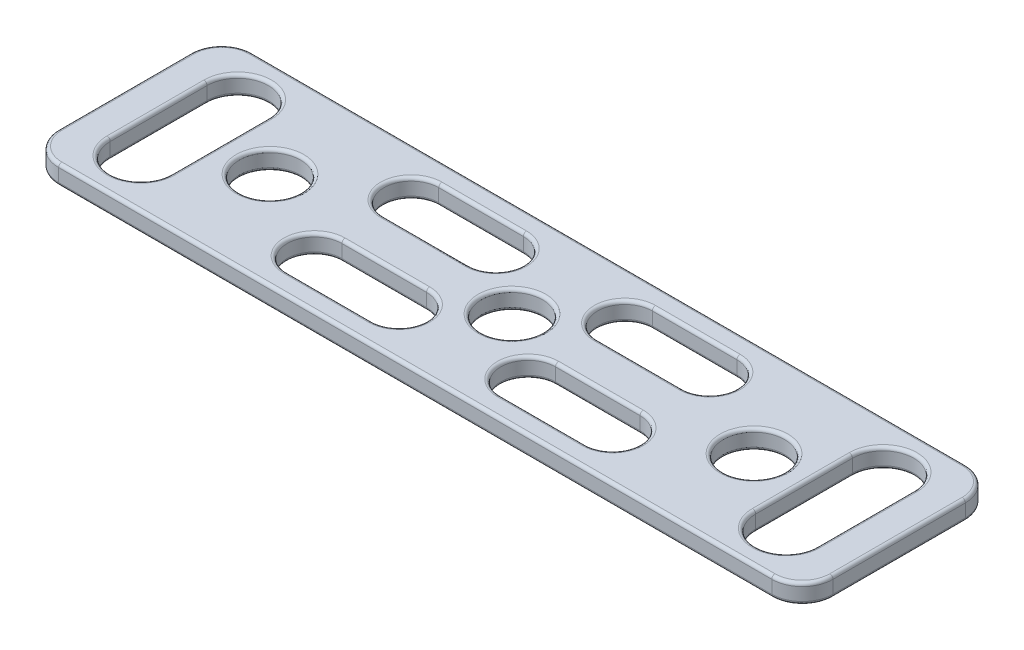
ISO-10303-21;
HEADER;
FILE_DESCRIPTION(('STEP AP214'),'2;1');
FILE_NAME('part.step','',(''),(''),'','','');
FILE_SCHEMA(('AUTOMOTIVE_DESIGN { 1 0 10303 214 1 1 1 1 }'));
ENDSEC;
DATA;
#1=APPLICATION_CONTEXT('core data for automotive mechanical design processes');
#2=APPLICATION_PROTOCOL_DEFINITION('international standard','automotive_design',2000,#1);
#3=PRODUCT_CONTEXT('',#1,'mechanical');
#4=PRODUCT('Part','Part','',(#3));
#5=PRODUCT_RELATED_PRODUCT_CATEGORY('part','',(#4));
#6=PRODUCT_DEFINITION_FORMATION('','',#4);
#7=PRODUCT_DEFINITION_CONTEXT('part definition',#1,'design');
#8=PRODUCT_DEFINITION('design','',#6,#7);
#9=PRODUCT_DEFINITION_SHAPE('','',#8);
#10=(LENGTH_UNIT() NAMED_UNIT(*) SI_UNIT(.MILLI.,.METRE.));
#11=(NAMED_UNIT(*) PLANE_ANGLE_UNIT() SI_UNIT($,.RADIAN.));
#12=(NAMED_UNIT(*) SI_UNIT($,.STERADIAN.) SOLID_ANGLE_UNIT());
#13=UNCERTAINTY_MEASURE_WITH_UNIT(LENGTH_MEASURE(1.E-05),#10,'distance_accuracy_value','');
#14=(GEOMETRIC_REPRESENTATION_CONTEXT(3) GLOBAL_UNCERTAINTY_ASSIGNED_CONTEXT((#13)) GLOBAL_UNIT_ASSIGNED_CONTEXT((#10,
#11,#12)) REPRESENTATION_CONTEXT('',''));
#15=CARTESIAN_POINT('',(0.,0.,0.));
#16=DIRECTION('',(0.,0.,1.));
#17=DIRECTION('',(1.,0.,0.));
#18=AXIS2_PLACEMENT_3D('',#15,#16,#17);
#19=CARTESIAN_POINT('',(2.413,1.524,-12.827));
#20=DIRECTION('',(0.,-1.,0.));
#21=DIRECTION('',(0.,0.,-1.));
#22=AXIS2_PLACEMENT_3D('',#19,#20,#21);
#23=PLANE('',#22);
#24=CARTESIAN_POINT('',(35.56,1.524,-3.81000000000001));
#25=DIRECTION('',(0.,-1.,0.));
#26=DIRECTION('',(0.,0.,-1.));
#27=AXIS2_PLACEMENT_3D('',#24,#25,#26);
#28=CIRCLE('',#27,2.413);
#29=CARTESIAN_POINT('',(35.56,1.524,-1.39700000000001));
#30=VERTEX_POINT('',#29);
#31=CARTESIAN_POINT('',(35.56,1.524,-6.223));
#32=VERTEX_POINT('',#31);
#33=EDGE_CURVE('E34',#30,#32,#28,.T.);
#34=ORIENTED_EDGE('',*,*,#33,.T.);
#35=DIRECTION('',(1.,0.,0.));
#36=VECTOR('',#35,1.);
#37=CARTESIAN_POINT('',(42.2148,1.524,-6.223));
#38=LINE('',#37,#36);
#39=CARTESIAN_POINT('',(42.2148,1.524,-6.223));
#40=VERTEX_POINT('',#39);
#41=EDGE_CURVE('E11',#32,#40,#38,.T.);
#42=ORIENTED_EDGE('',*,*,#41,.T.);
#43=CARTESIAN_POINT('',(42.2148,1.524,-3.81));
#44=DIRECTION('',(0.,-1.,0.));
#45=DIRECTION('',(0.,0.,-1.));
#46=AXIS2_PLACEMENT_3D('',#43,#44,#45);
#47=CIRCLE('',#46,2.413);
#48=CARTESIAN_POINT('',(42.2148,1.524,-1.39700000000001));
#49=VERTEX_POINT('',#48);
#50=EDGE_CURVE('E769',#40,#49,#47,.T.);
#51=ORIENTED_EDGE('',*,*,#50,.T.);
#52=DIRECTION('',(-1.,0.,0.));
#53=VECTOR('',#52,1.);
#54=CARTESIAN_POINT('',(35.56,1.524,-1.39700000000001));
#55=LINE('',#54,#53);
#56=EDGE_CURVE('E44',#49,#30,#55,.T.);
#57=ORIENTED_EDGE('',*,*,#56,.T.);
#58=EDGE_LOOP('',(#34,#42,#51,#57));
#59=FACE_BOUND('',#58,.T.);
#60=DIRECTION('',(1.,0.,0.));
#61=VECTOR('',#60,1.);
#62=CARTESIAN_POINT('',(2.413,1.524,-9.01699999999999));
#63=LINE('',#62,#61);
#64=CARTESIAN_POINT('',(42.2148,1.524,-9.01699999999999));
#65=VERTEX_POINT('',#64);
#66=CARTESIAN_POINT('',(35.56,1.524,-9.01699999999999));
#67=VERTEX_POINT('',#66);
#68=EDGE_CURVE('E764',#65,#67,#63,.F.);
#69=ORIENTED_EDGE('',*,*,#68,.T.);
#70=CARTESIAN_POINT('',(35.56,1.524,-11.43));
#71=DIRECTION('',(0.,-1.,0.));
#72=DIRECTION('',(0.,0.,-1.));
#73=AXIS2_PLACEMENT_3D('',#70,#71,#72);
#74=CIRCLE('',#73,2.413);
#75=CARTESIAN_POINT('',(35.56,1.524,-13.843));
#76=VERTEX_POINT('',#75);
#77=EDGE_CURVE('E766',#67,#76,#74,.T.);
#78=ORIENTED_EDGE('',*,*,#77,.T.);
#79=DIRECTION('',(-1.,0.,0.));
#80=VECTOR('',#79,1.);
#81=CARTESIAN_POINT('',(2.413,1.524,-13.843));
#82=LINE('',#81,#80);
#83=CARTESIAN_POINT('',(42.2148,1.524,-13.843));
#84=VERTEX_POINT('',#83);
#85=EDGE_CURVE('E760',#76,#84,#82,.F.);
#86=ORIENTED_EDGE('',*,*,#85,.T.);
#87=CARTESIAN_POINT('',(42.2148,1.524,-11.43));
#88=DIRECTION('',(0.,-1.,0.));
#89=DIRECTION('',(0.,0.,-1.));
#90=AXIS2_PLACEMENT_3D('',#87,#88,#89);
#91=CIRCLE('',#90,2.413);
#92=EDGE_CURVE('E762',#84,#65,#91,.T.);
#93=ORIENTED_EDGE('',*,*,#92,.T.);
#94=EDGE_LOOP('',(#69,#78,#86,#93));
#95=FACE_BOUND('',#94,.T.);
#96=CARTESIAN_POINT('',(25.4,1.524,-11.43));
#97=DIRECTION('',(0.,-1.,0.));
#98=DIRECTION('',(0.,0.,-1.));
#99=AXIS2_PLACEMENT_3D('',#96,#97,#98);
#100=CIRCLE('',#99,2.413);
#101=CARTESIAN_POINT('',(25.4,1.524,-13.843));
#102=VERTEX_POINT('',#101);
#103=CARTESIAN_POINT('',(25.4,1.524,-9.01699999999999));
#104=VERTEX_POINT('',#103);
#105=EDGE_CURVE('E755',#102,#104,#100,.T.);
#106=ORIENTED_EDGE('',*,*,#105,.T.);
#107=DIRECTION('',(-1.,0.,0.));
#108=VECTOR('',#107,1.);
#109=CARTESIAN_POINT('',(18.7452,1.524,-9.01699999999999));
#110=LINE('',#109,#108);
#111=CARTESIAN_POINT('',(18.7452,1.524,-9.01699999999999));
#112=VERTEX_POINT('',#111);
#113=EDGE_CURVE('E757',#104,#112,#110,.T.);
#114=ORIENTED_EDGE('',*,*,#113,.T.);
#115=CARTESIAN_POINT('',(18.7452,1.524,-11.43));
#116=DIRECTION('',(0.,-1.,0.));
#117=DIRECTION('',(0.,0.,-1.));
#118=AXIS2_PLACEMENT_3D('',#115,#116,#117);
#119=CIRCLE('',#118,2.413);
#120=CARTESIAN_POINT('',(18.7452,1.524,-13.843));
#121=VERTEX_POINT('',#120);
#122=EDGE_CURVE('E751',#112,#121,#119,.T.);
#123=ORIENTED_EDGE('',*,*,#122,.T.);
#124=DIRECTION('',(1.,0.,0.));
#125=VECTOR('',#124,1.);
#126=CARTESIAN_POINT('',(25.4,1.524,-13.843));
#127=LINE('',#126,#125);
#128=EDGE_CURVE('E753',#121,#102,#127,.T.);
#129=ORIENTED_EDGE('',*,*,#128,.T.);
#130=EDGE_LOOP('',(#106,#114,#123,#129));
#131=FACE_BOUND('',#130,.T.);
#132=CARTESIAN_POINT('',(30.48,1.524,-7.62));
#133=DIRECTION('',(0.,-1.,0.));
#134=DIRECTION('',(0.,0.,-1.));
#135=AXIS2_PLACEMENT_3D('',#132,#133,#134);
#136=CIRCLE('',#135,2.667);
#137=CARTESIAN_POINT('',(30.48,1.524,-10.287));
#138=VERTEX_POINT('',#137);
#139=EDGE_CURVE('E748',#138,#138,#136,.T.);
#140=ORIENTED_EDGE('',*,*,#139,.T.);
#141=EDGE_LOOP('',(#140));
#142=FACE_BOUND('',#141,.T.);
#143=DIRECTION('',(0.,0.,-1.));
#144=VECTOR('',#143,1.);
#145=CARTESIAN_POINT('',(7.747,1.524,-12.827));
#146=LINE('',#145,#144);
#147=CARTESIAN_POINT('',(7.747,1.524,-11.43));
#148=VERTEX_POINT('',#147);
#149=CARTESIAN_POINT('',(7.747,1.524,-3.81));
#150=VERTEX_POINT('',#149);
#151=EDGE_CURVE('E743',#148,#150,#146,.F.);
#152=ORIENTED_EDGE('',*,*,#151,.T.);
#153=CARTESIAN_POINT('',(5.08,1.524,-3.81));
#154=DIRECTION('',(0.,-1.,0.));
#155=DIRECTION('',(0.,0.,-1.));
#156=AXIS2_PLACEMENT_3D('',#153,#154,#155);
#157=CIRCLE('',#156,2.667);
#158=CARTESIAN_POINT('',(2.413,1.524,-3.81));
#159=VERTEX_POINT('',#158);
#160=EDGE_CURVE('E745',#150,#159,#157,.T.);
#161=ORIENTED_EDGE('',*,*,#160,.T.);
#162=DIRECTION('',(0.,0.,1.));
#163=VECTOR('',#162,1.);
#164=CARTESIAN_POINT('',(2.413,1.524,-12.827));
#165=LINE('',#164,#163);
#166=CARTESIAN_POINT('',(2.413,1.524,-11.43));
#167=VERTEX_POINT('',#166);
#168=EDGE_CURVE('E739',#159,#167,#165,.F.);
#169=ORIENTED_EDGE('',*,*,#168,.T.);
#170=CARTESIAN_POINT('',(5.08,1.524,-11.43));
#171=DIRECTION('',(0.,-1.,0.));
#172=DIRECTION('',(0.,0.,-1.));
#173=AXIS2_PLACEMENT_3D('',#170,#171,#172);
#174=CIRCLE('',#173,2.667);
#175=EDGE_CURVE('E741',#167,#148,#174,.T.);
#176=ORIENTED_EDGE('',*,*,#175,.T.);
#177=EDGE_LOOP('',(#152,#161,#169,#176));
#178=FACE_BOUND('',#177,.T.);
#179=DIRECTION('',(-1.,0.,0.));
#180=VECTOR('',#179,1.);
#181=CARTESIAN_POINT('',(2.413,1.524,-6.223));
#182=LINE('',#181,#180);
#183=CARTESIAN_POINT('',(18.7452,1.524,-6.223));
#184=VERTEX_POINT('',#183);
#185=CARTESIAN_POINT('',(25.4,1.524,-6.223));
#186=VERTEX_POINT('',#185);
#187=EDGE_CURVE('E734',#184,#186,#182,.F.);
#188=ORIENTED_EDGE('',*,*,#187,.T.);
#189=CARTESIAN_POINT('',(25.4,1.524,-3.81000000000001));
#190=DIRECTION('',(0.,-1.,0.));
#191=DIRECTION('',(0.,0.,-1.));
#192=AXIS2_PLACEMENT_3D('',#189,#190,#191);
#193=CIRCLE('',#192,2.413);
#194=CARTESIAN_POINT('',(25.4,1.524,-1.39700000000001));
#195=VERTEX_POINT('',#194);
#196=EDGE_CURVE('E736',#186,#195,#193,.T.);
#197=ORIENTED_EDGE('',*,*,#196,.T.);
#198=DIRECTION('',(1.,0.,0.));
#199=VECTOR('',#198,1.);
#200=CARTESIAN_POINT('',(2.413,1.524,-1.397));
#201=LINE('',#200,#199);
#202=CARTESIAN_POINT('',(18.7452,1.524,-1.397));
#203=VERTEX_POINT('',#202);
#204=EDGE_CURVE('E730',#195,#203,#201,.F.);
#205=ORIENTED_EDGE('',*,*,#204,.T.);
#206=CARTESIAN_POINT('',(18.7452,1.524,-3.81));
#207=DIRECTION('',(0.,-1.,0.));
#208=DIRECTION('',(0.,0.,-1.));
#209=AXIS2_PLACEMENT_3D('',#206,#207,#208);
#210=CIRCLE('',#209,2.413);
#211=EDGE_CURVE('E732',#203,#184,#210,.T.);
#212=ORIENTED_EDGE('',*,*,#211,.T.);
#213=EDGE_LOOP('',(#188,#197,#205,#212));
#214=FACE_BOUND('',#213,.T.);
#215=CARTESIAN_POINT('',(58.547,1.524,-12.827));
#216=DIRECTION('',(0.,-1.,0.));
#217=DIRECTION('',(0.,0.,-1.));
#218=AXIS2_PLACEMENT_3D('',#215,#216,#217);
#219=CIRCLE('',#218,2.159);
#220=CARTESIAN_POINT('',(60.706,1.524,-12.827));
#221=VERTEX_POINT('',#220);
#222=CARTESIAN_POINT('',(58.547,1.524,-14.986));
#223=VERTEX_POINT('',#222);
#224=EDGE_CURVE('E725',#221,#223,#219,.F.);
#225=ORIENTED_EDGE('',*,*,#224,.T.);
#226=DIRECTION('',(-1.,0.,0.));
#227=VECTOR('',#226,1.);
#228=CARTESIAN_POINT('',(2.413,1.524,-14.986));
#229=LINE('',#228,#227);
#230=CARTESIAN_POINT('',(2.41300000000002,1.524,-14.986));
#231=VERTEX_POINT('',#230);
#232=EDGE_CURVE('E727',#223,#231,#229,.T.);
#233=ORIENTED_EDGE('',*,*,#232,.T.);
#234=CARTESIAN_POINT('',(2.413,1.524,-12.827));
#235=DIRECTION('',(0.,-1.,0.));
#236=DIRECTION('',(0.,0.,-1.));
#237=AXIS2_PLACEMENT_3D('',#234,#235,#236);
#238=CIRCLE('',#237,2.159);
#239=CARTESIAN_POINT('',(0.253999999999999,1.524,-12.827));
#240=VERTEX_POINT('',#239);
#241=EDGE_CURVE('E713',#231,#240,#238,.F.);
#242=ORIENTED_EDGE('',*,*,#241,.T.);
#243=DIRECTION('',(0.,0.,1.));
#244=VECTOR('',#243,1.);
#245=CARTESIAN_POINT('',(0.254,1.524,-12.827));
#246=LINE('',#245,#244);
#247=CARTESIAN_POINT('',(0.254,1.524,-2.41300000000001));
#248=VERTEX_POINT('',#247);
#249=EDGE_CURVE('E715',#240,#248,#246,.T.);
#250=ORIENTED_EDGE('',*,*,#249,.T.);
#251=CARTESIAN_POINT('',(2.413,1.524,-2.413));
#252=DIRECTION('',(0.,-1.,0.));
#253=DIRECTION('',(0.,0.,-1.));
#254=AXIS2_PLACEMENT_3D('',#251,#252,#253);
#255=CIRCLE('',#254,2.159);
#256=CARTESIAN_POINT('',(2.41300000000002,1.524,-0.254));
#257=VERTEX_POINT('',#256);
#258=EDGE_CURVE('E717',#248,#257,#255,.F.);
#259=ORIENTED_EDGE('',*,*,#258,.T.);
#260=DIRECTION('',(1.,0.,0.));
#261=VECTOR('',#260,1.);
#262=CARTESIAN_POINT('',(2.413,1.524,-0.254000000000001));
#263=LINE('',#262,#261);
#264=CARTESIAN_POINT('',(58.547,1.524,-0.254000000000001));
#265=VERTEX_POINT('',#264);
#266=EDGE_CURVE('E719',#257,#265,#263,.T.);
#267=ORIENTED_EDGE('',*,*,#266,.T.);
#268=CARTESIAN_POINT('',(58.547,1.524,-2.413));
#269=DIRECTION('',(0.,-1.,0.));
#270=DIRECTION('',(0.,0.,-1.));
#271=AXIS2_PLACEMENT_3D('',#268,#269,#270);
#272=CIRCLE('',#271,2.159);
#273=CARTESIAN_POINT('',(60.706,1.524,-2.41300000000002));
#274=VERTEX_POINT('',#273);
#275=EDGE_CURVE('E721',#265,#274,#272,.F.);
#276=ORIENTED_EDGE('',*,*,#275,.T.);
#277=DIRECTION('',(0.,0.,-1.));
#278=VECTOR('',#277,1.);
#279=CARTESIAN_POINT('',(60.706,1.524,-12.827));
#280=LINE('',#279,#278);
#281=EDGE_CURVE('E723',#274,#221,#280,.T.);
#282=ORIENTED_EDGE('',*,*,#281,.T.);
#283=EDGE_LOOP('',(#225,#233,#242,#250,#259,#267,#276,#282));
#284=FACE_BOUND('',#283,.T.);
#285=CARTESIAN_POINT('',(55.88,1.524,-3.81));
#286=DIRECTION('',(0.,-1.,0.));
#287=DIRECTION('',(0.,0.,-1.));
#288=AXIS2_PLACEMENT_3D('',#285,#286,#287);
#289=CIRCLE('',#288,2.667);
#290=CARTESIAN_POINT('',(58.547,1.524,-3.81));
#291=VERTEX_POINT('',#290);
#292=CARTESIAN_POINT('',(53.213,1.524,-3.81));
#293=VERTEX_POINT('',#292);
#294=EDGE_CURVE('E708',#291,#293,#289,.T.);
#295=ORIENTED_EDGE('',*,*,#294,.T.);
#296=DIRECTION('',(0.,0.,-1.));
#297=VECTOR('',#296,1.);
#298=CARTESIAN_POINT('',(53.213,1.524,-11.43));
#299=LINE('',#298,#297);
#300=CARTESIAN_POINT('',(53.213,1.524,-11.43));
#301=VERTEX_POINT('',#300);
#302=EDGE_CURVE('E710',#293,#301,#299,.T.);
#303=ORIENTED_EDGE('',*,*,#302,.T.);
#304=CARTESIAN_POINT('',(55.88,1.524,-11.43));
#305=DIRECTION('',(0.,-1.,0.));
#306=DIRECTION('',(0.,0.,-1.));
#307=AXIS2_PLACEMENT_3D('',#304,#305,#306);
#308=CIRCLE('',#307,2.667);
#309=CARTESIAN_POINT('',(58.547,1.524,-11.43));
#310=VERTEX_POINT('',#309);
#311=EDGE_CURVE('E704',#301,#310,#308,.T.);
#312=ORIENTED_EDGE('',*,*,#311,.T.);
#313=DIRECTION('',(0.,0.,1.));
#314=VECTOR('',#313,1.);
#315=CARTESIAN_POINT('',(58.547,1.524,-3.81));
#316=LINE('',#315,#314);
#317=EDGE_CURVE('E706',#310,#291,#316,.T.);
#318=ORIENTED_EDGE('',*,*,#317,.T.);
#319=EDGE_LOOP('',(#295,#303,#312,#318));
#320=FACE_BOUND('',#319,.T.);
#321=CARTESIAN_POINT('',(11.43,1.524,-7.62));
#322=DIRECTION('',(0.,-1.,0.));
#323=DIRECTION('',(0.,0.,-1.));
#324=AXIS2_PLACEMENT_3D('',#321,#322,#323);
#325=CIRCLE('',#324,2.667);
#326=CARTESIAN_POINT('',(11.43,1.524,-10.287));
#327=VERTEX_POINT('',#326);
#328=EDGE_CURVE('E701',#327,#327,#325,.T.);
#329=ORIENTED_EDGE('',*,*,#328,.T.);
#330=EDGE_LOOP('',(#329));
#331=FACE_BOUND('',#330,.T.);
#332=CARTESIAN_POINT('',(49.53,1.524,-7.62));
#333=DIRECTION('',(0.,-1.,0.));
#334=DIRECTION('',(0.,0.,-1.));
#335=AXIS2_PLACEMENT_3D('',#332,#333,#334);
#336=CIRCLE('',#335,2.667);
#337=CARTESIAN_POINT('',(49.53,1.524,-10.287));
#338=VERTEX_POINT('',#337);
#339=EDGE_CURVE('E698',#338,#338,#336,.T.);
#340=ORIENTED_EDGE('',*,*,#339,.T.);
#341=EDGE_LOOP('',(#340));
#342=FACE_BOUND('',#341,.T.);
#343=ADVANCED_FACE('F26',(#59,#95,#131,#142,#178,#214,#284,#320,#331,#342),#23,.F.);
#344=CARTESIAN_POINT('',(2.413,0.,-12.827));
#345=DIRECTION('',(0.,-1.,0.));
#346=DIRECTION('',(0.,0.,-1.));
#347=AXIS2_PLACEMENT_3D('',#344,#345,#346);
#348=PLANE('',#347);
#349=DIRECTION('',(1.,0.,0.));
#350=VECTOR('',#349,1.);
#351=CARTESIAN_POINT('',(2.413,0.,-6.223));
#352=LINE('',#351,#350);
#353=CARTESIAN_POINT('',(42.2148,0.,-6.223));
#354=VERTEX_POINT('',#353);
#355=CARTESIAN_POINT('',(35.56,0.,-6.223));
#356=VERTEX_POINT('',#355);
#357=EDGE_CURVE('E543',#354,#356,#352,.F.);
#358=ORIENTED_EDGE('',*,*,#357,.T.);
#359=CARTESIAN_POINT('',(35.56,0.,-3.81000000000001));
#360=DIRECTION('',(0.,-1.,0.));
#361=DIRECTION('',(0.,0.,-1.));
#362=AXIS2_PLACEMENT_3D('',#359,#360,#361);
#363=CIRCLE('',#362,2.413);
#364=CARTESIAN_POINT('',(35.56,0.,-1.39700000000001));
#365=VERTEX_POINT('',#364);
#366=EDGE_CURVE('E545',#356,#365,#363,.F.);
#367=ORIENTED_EDGE('',*,*,#366,.T.);
#368=DIRECTION('',(-1.,0.,0.));
#369=VECTOR('',#368,1.);
#370=CARTESIAN_POINT('',(2.413,0.,-1.39700000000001));
#371=LINE('',#370,#369);
#372=CARTESIAN_POINT('',(42.2148,0.,-1.397));
#373=VERTEX_POINT('',#372);
#374=EDGE_CURVE('E454',#365,#373,#371,.F.);
#375=ORIENTED_EDGE('',*,*,#374,.T.);
#376=CARTESIAN_POINT('',(42.2148,0.,-3.81));
#377=DIRECTION('',(0.,-1.,0.));
#378=DIRECTION('',(0.,0.,-1.));
#379=AXIS2_PLACEMENT_3D('',#376,#377,#378);
#380=CIRCLE('',#379,2.413);
#381=EDGE_CURVE('E541',#373,#354,#380,.F.);
#382=ORIENTED_EDGE('',*,*,#381,.T.);
#383=EDGE_LOOP('',(#358,#367,#375,#382));
#384=FACE_BOUND('',#383,.T.);
#385=CARTESIAN_POINT('',(35.56,0.,-11.43));
#386=DIRECTION('',(0.,-1.,0.));
#387=DIRECTION('',(0.,0.,-1.));
#388=AXIS2_PLACEMENT_3D('',#385,#386,#387);
#389=CIRCLE('',#388,2.413);
#390=CARTESIAN_POINT('',(35.56,0.,-13.843));
#391=VERTEX_POINT('',#390);
#392=CARTESIAN_POINT('',(35.56,0.,-9.01699999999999));
#393=VERTEX_POINT('',#392);
#394=EDGE_CURVE('E535',#391,#393,#389,.F.);
#395=ORIENTED_EDGE('',*,*,#394,.T.);
#396=DIRECTION('',(1.,0.,0.));
#397=VECTOR('',#396,1.);
#398=CARTESIAN_POINT('',(42.2148,0.,-9.01699999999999));
#399=LINE('',#398,#397);
#400=CARTESIAN_POINT('',(42.2148,0.,-9.01699999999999));
#401=VERTEX_POINT('',#400);
#402=EDGE_CURVE('E537',#393,#401,#399,.T.);
#403=ORIENTED_EDGE('',*,*,#402,.T.);
#404=CARTESIAN_POINT('',(42.2148,0.,-11.43));
#405=DIRECTION('',(0.,-1.,0.));
#406=DIRECTION('',(0.,0.,-1.));
#407=AXIS2_PLACEMENT_3D('',#404,#405,#406);
#408=CIRCLE('',#407,2.413);
#409=CARTESIAN_POINT('',(42.2148,0.,-13.843));
#410=VERTEX_POINT('',#409);
#411=EDGE_CURVE('E531',#401,#410,#408,.F.);
#412=ORIENTED_EDGE('',*,*,#411,.T.);
#413=DIRECTION('',(-1.,0.,0.));
#414=VECTOR('',#413,1.);
#415=CARTESIAN_POINT('',(35.56,0.,-13.843));
#416=LINE('',#415,#414);
#417=EDGE_CURVE('E533',#410,#391,#416,.T.);
#418=ORIENTED_EDGE('',*,*,#417,.T.);
#419=EDGE_LOOP('',(#395,#403,#412,#418));
#420=FACE_BOUND('',#419,.T.);
#421=DIRECTION('',(-1.,0.,0.));
#422=VECTOR('',#421,1.);
#423=CARTESIAN_POINT('',(2.413,0.,-9.01699999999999));
#424=LINE('',#423,#422);
#425=CARTESIAN_POINT('',(18.7452,0.,-9.01699999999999));
#426=VERTEX_POINT('',#425);
#427=CARTESIAN_POINT('',(25.4,0.,-9.01699999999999));
#428=VERTEX_POINT('',#427);
#429=EDGE_CURVE('E526',#426,#428,#424,.F.);
#430=ORIENTED_EDGE('',*,*,#429,.T.);
#431=CARTESIAN_POINT('',(25.4,0.,-11.43));
#432=DIRECTION('',(0.,-1.,0.));
#433=DIRECTION('',(0.,0.,-1.));
#434=AXIS2_PLACEMENT_3D('',#431,#432,#433);
#435=CIRCLE('',#434,2.413);
#436=CARTESIAN_POINT('',(25.4,0.,-13.843));
#437=VERTEX_POINT('',#436);
#438=EDGE_CURVE('E528',#428,#437,#435,.F.);
#439=ORIENTED_EDGE('',*,*,#438,.T.);
#440=DIRECTION('',(1.,0.,0.));
#441=VECTOR('',#440,1.);
#442=CARTESIAN_POINT('',(2.413,0.,-13.843));
#443=LINE('',#442,#441);
#444=CARTESIAN_POINT('',(18.7452,0.,-13.843));
#445=VERTEX_POINT('',#444);
#446=EDGE_CURVE('E522',#437,#445,#443,.F.);
#447=ORIENTED_EDGE('',*,*,#446,.T.);
#448=CARTESIAN_POINT('',(18.7452,0.,-11.43));
#449=DIRECTION('',(0.,-1.,0.));
#450=DIRECTION('',(0.,0.,-1.));
#451=AXIS2_PLACEMENT_3D('',#448,#449,#450);
#452=CIRCLE('',#451,2.413);
#453=EDGE_CURVE('E524',#445,#426,#452,.F.);
#454=ORIENTED_EDGE('',*,*,#453,.T.);
#455=EDGE_LOOP('',(#430,#439,#447,#454));
#456=FACE_BOUND('',#455,.T.);
#457=CARTESIAN_POINT('',(30.48,0.,-7.62));
#458=DIRECTION('',(0.,-1.,0.));
#459=DIRECTION('',(0.,0.,-1.));
#460=AXIS2_PLACEMENT_3D('',#457,#458,#459);
#461=CIRCLE('',#460,2.667);
#462=CARTESIAN_POINT('',(30.48,0.,-10.287));
#463=VERTEX_POINT('',#462);
#464=EDGE_CURVE('E519',#463,#463,#461,.F.);
#465=ORIENTED_EDGE('',*,*,#464,.T.);
#466=EDGE_LOOP('',(#465));
#467=FACE_BOUND('',#466,.T.);
#468=CARTESIAN_POINT('',(5.08,0.,-3.81));
#469=DIRECTION('',(0.,-1.,0.));
#470=DIRECTION('',(0.,0.,-1.));
#471=AXIS2_PLACEMENT_3D('',#468,#469,#470);
#472=CIRCLE('',#471,2.667);
#473=CARTESIAN_POINT('',(2.413,0.,-3.81));
#474=VERTEX_POINT('',#473);
#475=CARTESIAN_POINT('',(7.747,0.,-3.81));
#476=VERTEX_POINT('',#475);
#477=EDGE_CURVE('E514',#474,#476,#472,.F.);
#478=ORIENTED_EDGE('',*,*,#477,.T.);
#479=DIRECTION('',(0.,0.,-1.));
#480=VECTOR('',#479,1.);
#481=CARTESIAN_POINT('',(7.747,0.,-11.43));
#482=LINE('',#481,#480);
#483=CARTESIAN_POINT('',(7.747,0.,-11.43));
#484=VERTEX_POINT('',#483);
#485=EDGE_CURVE('E516',#476,#484,#482,.T.);
#486=ORIENTED_EDGE('',*,*,#485,.T.);
#487=CARTESIAN_POINT('',(5.08,0.,-11.43));
#488=DIRECTION('',(0.,-1.,0.));
#489=DIRECTION('',(0.,0.,-1.));
#490=AXIS2_PLACEMENT_3D('',#487,#488,#489);
#491=CIRCLE('',#490,2.667);
#492=CARTESIAN_POINT('',(2.413,0.,-11.43));
#493=VERTEX_POINT('',#492);
#494=EDGE_CURVE('E510',#484,#493,#491,.F.);
#495=ORIENTED_EDGE('',*,*,#494,.T.);
#496=DIRECTION('',(0.,0.,1.));
#497=VECTOR('',#496,1.);
#498=CARTESIAN_POINT('',(2.413,0.,-3.81));
#499=LINE('',#498,#497);
#500=EDGE_CURVE('E512',#493,#474,#499,.T.);
#501=ORIENTED_EDGE('',*,*,#500,.T.);
#502=EDGE_LOOP('',(#478,#486,#495,#501));
#503=FACE_BOUND('',#502,.T.);
#504=CARTESIAN_POINT('',(25.4,0.,-3.81000000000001));
#505=DIRECTION('',(0.,-1.,0.));
#506=DIRECTION('',(0.,0.,-1.));
#507=AXIS2_PLACEMENT_3D('',#504,#505,#506);
#508=CIRCLE('',#507,2.413);
#509=CARTESIAN_POINT('',(25.4,0.,-1.39700000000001));
#510=VERTEX_POINT('',#509);
#511=CARTESIAN_POINT('',(25.4,0.,-6.223));
#512=VERTEX_POINT('',#511);
#513=EDGE_CURVE('E505',#510,#512,#508,.F.);
#514=ORIENTED_EDGE('',*,*,#513,.T.);
#515=DIRECTION('',(-1.,0.,0.));
#516=VECTOR('',#515,1.);
#517=CARTESIAN_POINT('',(18.7452,0.,-6.223));
#518=LINE('',#517,#516);
#519=CARTESIAN_POINT('',(18.7452,0.,-6.223));
#520=VERTEX_POINT('',#519);
#521=EDGE_CURVE('E507',#512,#520,#518,.T.);
#522=ORIENTED_EDGE('',*,*,#521,.T.);
#523=CARTESIAN_POINT('',(18.7452,0.,-3.81));
#524=DIRECTION('',(0.,-1.,0.));
#525=DIRECTION('',(0.,0.,-1.));
#526=AXIS2_PLACEMENT_3D('',#523,#524,#525);
#527=CIRCLE('',#526,2.413);
#528=CARTESIAN_POINT('',(18.7452,0.,-1.39700000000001));
#529=VERTEX_POINT('',#528);
#530=EDGE_CURVE('E501',#520,#529,#527,.F.);
#531=ORIENTED_EDGE('',*,*,#530,.T.);
#532=DIRECTION('',(1.,0.,0.));
#533=VECTOR('',#532,1.);
#534=CARTESIAN_POINT('',(25.4,0.,-1.39700000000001));
#535=LINE('',#534,#533);
#536=EDGE_CURVE('E503',#529,#510,#535,.T.);
#537=ORIENTED_EDGE('',*,*,#536,.T.);
#538=EDGE_LOOP('',(#514,#522,#531,#537));
#539=FACE_BOUND('',#538,.T.);
#540=CARTESIAN_POINT('',(2.413,0.,-2.413));
#541=DIRECTION('',(0.,-1.,0.));
#542=DIRECTION('',(0.,0.,-1.));
#543=AXIS2_PLACEMENT_3D('',#540,#541,#542);
#544=CIRCLE('',#543,2.159);
#545=CARTESIAN_POINT('',(2.41300000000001,0.,-0.254));
#546=VERTEX_POINT('',#545);
#547=CARTESIAN_POINT('',(0.254,0.,-2.41300000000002));
#548=VERTEX_POINT('',#547);
#549=EDGE_CURVE('E496',#546,#548,#544,.T.);
#550=ORIENTED_EDGE('',*,*,#549,.T.);
#551=DIRECTION('',(0.,0.,1.));
#552=VECTOR('',#551,1.);
#553=CARTESIAN_POINT('',(0.254,0.,-12.827));
#554=LINE('',#553,#552);
#555=CARTESIAN_POINT('',(0.254,0.,-12.827));
#556=VERTEX_POINT('',#555);
#557=EDGE_CURVE('E498',#548,#556,#554,.F.);
#558=ORIENTED_EDGE('',*,*,#557,.T.);
#559=CARTESIAN_POINT('',(2.413,0.,-12.827));
#560=DIRECTION('',(0.,-1.,0.));
#561=DIRECTION('',(0.,0.,-1.));
#562=AXIS2_PLACEMENT_3D('',#559,#560,#561);
#563=CIRCLE('',#562,2.159);
#564=CARTESIAN_POINT('',(2.41300000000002,0.,-14.986));
#565=VERTEX_POINT('',#564);
#566=EDGE_CURVE('E484',#556,#565,#563,.T.);
#567=ORIENTED_EDGE('',*,*,#566,.T.);
#568=DIRECTION('',(-1.,0.,0.));
#569=VECTOR('',#568,1.);
#570=CARTESIAN_POINT('',(58.547,0.,-14.986));
#571=LINE('',#570,#569);
#572=CARTESIAN_POINT('',(58.547,0.,-14.986));
#573=VERTEX_POINT('',#572);
#574=EDGE_CURVE('E486',#565,#573,#571,.F.);
#575=ORIENTED_EDGE('',*,*,#574,.T.);
#576=CARTESIAN_POINT('',(58.547,0.,-12.827));
#577=DIRECTION('',(0.,-1.,0.));
#578=DIRECTION('',(0.,0.,-1.));
#579=AXIS2_PLACEMENT_3D('',#576,#577,#578);
#580=CIRCLE('',#579,2.159);
#581=CARTESIAN_POINT('',(60.706,0.,-12.827));
#582=VERTEX_POINT('',#581);
#583=EDGE_CURVE('E488',#573,#582,#580,.T.);
#584=ORIENTED_EDGE('',*,*,#583,.T.);
#585=DIRECTION('',(0.,0.,-1.));
#586=VECTOR('',#585,1.);
#587=CARTESIAN_POINT('',(60.706,0.,-2.41300000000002));
#588=LINE('',#587,#586);
#589=CARTESIAN_POINT('',(60.706,0.,-2.41300000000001));
#590=VERTEX_POINT('',#589);
#591=EDGE_CURVE('E490',#582,#590,#588,.F.);
#592=ORIENTED_EDGE('',*,*,#591,.T.);
#593=CARTESIAN_POINT('',(58.547,0.,-2.413));
#594=DIRECTION('',(0.,-1.,0.));
#595=DIRECTION('',(0.,0.,-1.));
#596=AXIS2_PLACEMENT_3D('',#593,#594,#595);
#597=CIRCLE('',#596,2.159);
#598=CARTESIAN_POINT('',(58.547,0.,-0.254));
#599=VERTEX_POINT('',#598);
#600=EDGE_CURVE('E492',#590,#599,#597,.T.);
#601=ORIENTED_EDGE('',*,*,#600,.T.);
#602=DIRECTION('',(1.,0.,0.));
#603=VECTOR('',#602,1.);
#604=CARTESIAN_POINT('',(2.41300000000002,0.,-0.254));
#605=LINE('',#604,#603);
#606=EDGE_CURVE('E494',#599,#546,#605,.F.);
#607=ORIENTED_EDGE('',*,*,#606,.T.);
#608=EDGE_LOOP('',(#550,#558,#567,#575,#584,#592,#601,#607));
#609=FACE_BOUND('',#608,.T.);
#610=DIRECTION('',(0.,0.,-1.));
#611=VECTOR('',#610,1.);
#612=CARTESIAN_POINT('',(53.213,0.,-12.827));
#613=LINE('',#612,#611);
#614=CARTESIAN_POINT('',(53.213,0.,-11.43));
#615=VERTEX_POINT('',#614);
#616=CARTESIAN_POINT('',(53.213,0.,-3.81));
#617=VERTEX_POINT('',#616);
#618=EDGE_CURVE('E479',#615,#617,#613,.F.);
#619=ORIENTED_EDGE('',*,*,#618,.T.);
#620=CARTESIAN_POINT('',(55.88,0.,-3.81));
#621=DIRECTION('',(0.,-1.,0.));
#622=DIRECTION('',(0.,0.,-1.));
#623=AXIS2_PLACEMENT_3D('',#620,#621,#622);
#624=CIRCLE('',#623,2.667);
#625=CARTESIAN_POINT('',(58.547,0.,-3.81));
#626=VERTEX_POINT('',#625);
#627=EDGE_CURVE('E481',#617,#626,#624,.F.);
#628=ORIENTED_EDGE('',*,*,#627,.T.);
#629=DIRECTION('',(0.,0.,1.));
#630=VECTOR('',#629,1.);
#631=CARTESIAN_POINT('',(58.547,0.,-12.827));
#632=LINE('',#631,#630);
#633=CARTESIAN_POINT('',(58.547,0.,-11.43));
#634=VERTEX_POINT('',#633);
#635=EDGE_CURVE('E475',#626,#634,#632,.F.);
#636=ORIENTED_EDGE('',*,*,#635,.T.);
#637=CARTESIAN_POINT('',(55.88,0.,-11.43));
#638=DIRECTION('',(0.,-1.,0.));
#639=DIRECTION('',(0.,0.,-1.));
#640=AXIS2_PLACEMENT_3D('',#637,#638,#639);
#641=CIRCLE('',#640,2.667);
#642=EDGE_CURVE('E477',#634,#615,#641,.F.);
#643=ORIENTED_EDGE('',*,*,#642,.T.);
#644=EDGE_LOOP('',(#619,#628,#636,#643));
#645=FACE_BOUND('',#644,.T.);
#646=CARTESIAN_POINT('',(11.43,0.,-7.62));
#647=DIRECTION('',(0.,-1.,0.));
#648=DIRECTION('',(0.,0.,-1.));
#649=AXIS2_PLACEMENT_3D('',#646,#647,#648);
#650=CIRCLE('',#649,2.667);
#651=CARTESIAN_POINT('',(11.43,0.,-10.287));
#652=VERTEX_POINT('',#651);
#653=EDGE_CURVE('E467',#652,#652,#650,.F.);
#654=ORIENTED_EDGE('',*,*,#653,.T.);
#655=EDGE_LOOP('',(#654));
#656=FACE_BOUND('',#655,.T.);
#657=CARTESIAN_POINT('',(49.53,0.,-7.62));
#658=DIRECTION('',(0.,-1.,0.));
#659=DIRECTION('',(0.,0.,-1.));
#660=AXIS2_PLACEMENT_3D('',#657,#658,#659);
#661=CIRCLE('',#660,2.667);
#662=CARTESIAN_POINT('',(49.53,0.,-10.287));
#663=VERTEX_POINT('',#662);
#664=EDGE_CURVE('E464',#663,#663,#661,.F.);
#665=ORIENTED_EDGE('',*,*,#664,.T.);
#666=EDGE_LOOP('',(#665));
#667=FACE_BOUND('',#666,.T.);
#668=ADVANCED_FACE('F1115',(#384,#420,#456,#467,#503,#539,#609,#645,#656,#667),#348,.T.);
#669=CARTESIAN_POINT('',(2.413,1.524,-12.827));
#670=DIRECTION('',(0.,-1.,0.));
#671=DIRECTION('',(0.,0.,-1.));
#672=AXIS2_PLACEMENT_3D('',#669,#670,#671);
#673=CYLINDRICAL_SURFACE('',#672,2.413);
#674=DIRECTION('',(0.,-1.,0.));
#675=VECTOR('',#674,1.);
#676=CARTESIAN_POINT('',(2.41300000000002,1.524,-15.24));
#677=LINE('',#676,#675);
#678=CARTESIAN_POINT('',(2.41300000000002,1.27,-15.24));
#679=VERTEX_POINT('',#678);
#680=CARTESIAN_POINT('',(2.41300000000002,0.254000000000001,-15.24));
#681=VERTEX_POINT('',#680);
#682=EDGE_CURVE('E926',#679,#681,#677,.T.);
#683=ORIENTED_EDGE('',*,*,#682,.T.);
#684=CARTESIAN_POINT('',(2.413,0.254,-12.827));
#685=DIRECTION('',(0.,-1.,0.));
#686=DIRECTION('',(0.,0.,-1.));
#687=AXIS2_PLACEMENT_3D('',#684,#685,#686);
#688=CIRCLE('',#687,2.413);
#689=CARTESIAN_POINT('',(0.,0.254000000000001,-12.827));
#690=VERTEX_POINT('',#689);
#691=EDGE_CURVE('E666',#681,#690,#688,.F.);
#692=ORIENTED_EDGE('',*,*,#691,.T.);
#693=DIRECTION('',(0.,-1.,0.));
#694=VECTOR('',#693,1.);
#695=CARTESIAN_POINT('',(0.,1.524,-12.827));
#696=LINE('',#695,#694);
#697=CARTESIAN_POINT('',(0.,1.27,-12.827));
#698=VERTEX_POINT('',#697);
#699=EDGE_CURVE('E469',#698,#690,#696,.T.);
#700=ORIENTED_EDGE('',*,*,#699,.F.);
#701=CARTESIAN_POINT('',(2.413,1.27,-12.827));
#702=DIRECTION('',(0.,-1.,0.));
#703=DIRECTION('',(0.,0.,-1.));
#704=AXIS2_PLACEMENT_3D('',#701,#702,#703);
#705=CIRCLE('',#704,2.413);
#706=EDGE_CURVE('E664',#698,#679,#705,.T.);
#707=ORIENTED_EDGE('',*,*,#706,.T.);
#708=EDGE_LOOP('',(#683,#692,#700,#707));
#709=FACE_BOUND('',#708,.T.);
#710=ADVANCED_FACE('F28',(#709),#673,.T.);
#711=CARTESIAN_POINT('',(0.,1.524,-2.41300000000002));
#712=DIRECTION('',(1.,0.,0.));
#713=DIRECTION('',(0.,0.,-1.));
#714=AXIS2_PLACEMENT_3D('',#711,#712,#713);
#715=PLANE('',#714);
#716=ORIENTED_EDGE('',*,*,#699,.T.);
#717=DIRECTION('',(0.,0.,1.));
#718=VECTOR('',#717,1.);
#719=CARTESIAN_POINT('',(0.,0.254,-2.41300000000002));
#720=LINE('',#719,#718);
#721=CARTESIAN_POINT('',(0.,0.254000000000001,-2.41300000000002));
#722=VERTEX_POINT('',#721);
#723=EDGE_CURVE('E636',#690,#722,#720,.T.);
#724=ORIENTED_EDGE('',*,*,#723,.T.);
#725=DIRECTION('',(0.,-1.,0.));
#726=VECTOR('',#725,1.);
#727=CARTESIAN_POINT('',(0.,1.524,-2.41300000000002));
#728=LINE('',#727,#726);
#729=CARTESIAN_POINT('',(0.,1.27,-2.41300000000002));
#730=VERTEX_POINT('',#729);
#731=EDGE_CURVE('E952',#730,#722,#728,.T.);
#732=ORIENTED_EDGE('',*,*,#731,.F.);
#733=DIRECTION('',(0.,0.,1.));
#734=VECTOR('',#733,1.);
#735=CARTESIAN_POINT('',(0.,1.27,-2.41300000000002));
#736=LINE('',#735,#734);
#737=EDGE_CURVE('E634',#730,#698,#736,.F.);
#738=ORIENTED_EDGE('',*,*,#737,.T.);
#739=EDGE_LOOP('',(#716,#724,#732,#738));
#740=FACE_BOUND('',#739,.T.);
#741=ADVANCED_FACE('F958',(#740),#715,.F.);
#742=CARTESIAN_POINT('',(2.413,1.524,-2.413));
#743=DIRECTION('',(0.,-1.,0.));
#744=DIRECTION('',(0.,0.,-1.));
#745=AXIS2_PLACEMENT_3D('',#742,#743,#744);
#746=CYLINDRICAL_SURFACE('',#745,2.413);
#747=ORIENTED_EDGE('',*,*,#731,.T.);
#748=CARTESIAN_POINT('',(2.413,0.254,-2.413));
#749=DIRECTION('',(0.,-1.,0.));
#750=DIRECTION('',(0.,0.,-1.));
#751=AXIS2_PLACEMENT_3D('',#748,#749,#750);
#752=CIRCLE('',#751,2.413);
#753=CARTESIAN_POINT('',(2.41300000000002,0.254000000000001,0.));
#754=VERTEX_POINT('',#753);
#755=EDGE_CURVE('E641',#722,#754,#752,.F.);
#756=ORIENTED_EDGE('',*,*,#755,.T.);
#757=DIRECTION('',(0.,-1.,0.));
#758=VECTOR('',#757,1.);
#759=CARTESIAN_POINT('',(2.41300000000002,1.524,0.));
#760=LINE('',#759,#758);
#761=CARTESIAN_POINT('',(2.41300000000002,1.27,0.));
#762=VERTEX_POINT('',#761);
#763=EDGE_CURVE('E949',#762,#754,#760,.T.);
#764=ORIENTED_EDGE('',*,*,#763,.F.);
#765=CARTESIAN_POINT('',(2.413,1.27,-2.413));
#766=DIRECTION('',(0.,-1.,0.));
#767=DIRECTION('',(0.,0.,-1.));
#768=AXIS2_PLACEMENT_3D('',#765,#766,#767);
#769=CIRCLE('',#768,2.413);
#770=EDGE_CURVE('E639',#762,#730,#769,.T.);
#771=ORIENTED_EDGE('',*,*,#770,.T.);
#772=EDGE_LOOP('',(#747,#756,#764,#771));
#773=FACE_BOUND('',#772,.T.);
#774=ADVANCED_FACE('F979',(#773),#746,.T.);
#775=CARTESIAN_POINT('',(2.41300000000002,1.524,0.));
#776=DIRECTION('',(0.,0.,-1.));
#777=DIRECTION('',(-1.,0.,0.));
#778=AXIS2_PLACEMENT_3D('',#775,#776,#777);
#779=PLANE('',#778);
#780=ORIENTED_EDGE('',*,*,#763,.T.);
#781=DIRECTION('',(1.,0.,0.));
#782=VECTOR('',#781,1.);
#783=CARTESIAN_POINT('',(58.547,0.254,0.));
#784=LINE('',#783,#782);
#785=CARTESIAN_POINT('',(58.547,0.254000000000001,0.));
#786=VERTEX_POINT('',#785);
#787=EDGE_CURVE('E645',#754,#786,#784,.T.);
#788=ORIENTED_EDGE('',*,*,#787,.T.);
#789=DIRECTION('',(0.,-1.,0.));
#790=VECTOR('',#789,1.);
#791=CARTESIAN_POINT('',(58.547,1.524,0.));
#792=LINE('',#791,#790);
#793=CARTESIAN_POINT('',(58.547,1.27,0.));
#794=VERTEX_POINT('',#793);
#795=EDGE_CURVE('E946',#794,#786,#792,.T.);
#796=ORIENTED_EDGE('',*,*,#795,.F.);
#797=DIRECTION('',(1.,0.,0.));
#798=VECTOR('',#797,1.);
#799=CARTESIAN_POINT('',(2.41300000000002,1.27,0.));
#800=LINE('',#799,#798);
#801=EDGE_CURVE('E643',#794,#762,#800,.F.);
#802=ORIENTED_EDGE('',*,*,#801,.T.);
#803=EDGE_LOOP('',(#780,#788,#796,#802));
#804=FACE_BOUND('',#803,.T.);
#805=ADVANCED_FACE('F983',(#804),#779,.F.);
#806=CARTESIAN_POINT('',(58.547,1.524,-2.413));
#807=DIRECTION('',(0.,-1.,0.));
#808=DIRECTION('',(0.,0.,-1.));
#809=AXIS2_PLACEMENT_3D('',#806,#807,#808);
#810=CYLINDRICAL_SURFACE('',#809,2.413);
#811=ORIENTED_EDGE('',*,*,#795,.T.);
#812=CARTESIAN_POINT('',(58.547,0.254,-2.413));
#813=DIRECTION('',(0.,-1.,0.));
#814=DIRECTION('',(0.,0.,-1.));
#815=AXIS2_PLACEMENT_3D('',#812,#813,#814);
#816=CIRCLE('',#815,2.413);
#817=CARTESIAN_POINT('',(60.96,0.254000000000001,-2.41300000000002));
#818=VERTEX_POINT('',#817);
#819=EDGE_CURVE('E649',#786,#818,#816,.F.);
#820=ORIENTED_EDGE('',*,*,#819,.T.);
#821=DIRECTION('',(0.,-1.,0.));
#822=VECTOR('',#821,1.);
#823=CARTESIAN_POINT('',(60.96,1.524,-2.41300000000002));
#824=LINE('',#823,#822);
#825=CARTESIAN_POINT('',(60.96,1.27,-2.41300000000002));
#826=VERTEX_POINT('',#825);
#827=EDGE_CURVE('E943',#826,#818,#824,.T.);
#828=ORIENTED_EDGE('',*,*,#827,.F.);
#829=CARTESIAN_POINT('',(58.547,1.27,-2.413));
#830=DIRECTION('',(0.,-1.,0.));
#831=DIRECTION('',(0.,0.,-1.));
#832=AXIS2_PLACEMENT_3D('',#829,#830,#831);
#833=CIRCLE('',#832,2.413);
#834=EDGE_CURVE('E647',#826,#794,#833,.T.);
#835=ORIENTED_EDGE('',*,*,#834,.T.);
#836=EDGE_LOOP('',(#811,#820,#828,#835));
#837=FACE_BOUND('',#836,.T.);
#838=ADVANCED_FACE('F997',(#837),#810,.T.);
#839=CARTESIAN_POINT('',(60.96,1.524,-2.41300000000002));
#840=DIRECTION('',(-1.,0.,0.));
#841=DIRECTION('',(0.,0.,1.));
#842=AXIS2_PLACEMENT_3D('',#839,#840,#841);
#843=PLANE('',#842);
#844=ORIENTED_EDGE('',*,*,#827,.T.);
#845=DIRECTION('',(0.,0.,-1.));
#846=VECTOR('',#845,1.);
#847=CARTESIAN_POINT('',(60.96,0.254,-12.827));
#848=LINE('',#847,#846);
#849=CARTESIAN_POINT('',(60.96,0.254000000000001,-12.827));
#850=VERTEX_POINT('',#849);
#851=EDGE_CURVE('E653',#818,#850,#848,.T.);
#852=ORIENTED_EDGE('',*,*,#851,.T.);
#853=DIRECTION('',(0.,-1.,0.));
#854=VECTOR('',#853,1.);
#855=CARTESIAN_POINT('',(60.96,1.524,-12.827));
#856=LINE('',#855,#854);
#857=CARTESIAN_POINT('',(60.96,1.27,-12.827));
#858=VERTEX_POINT('',#857);
#859=EDGE_CURVE('E940',#858,#850,#856,.T.);
#860=ORIENTED_EDGE('',*,*,#859,.F.);
#861=DIRECTION('',(0.,0.,-1.));
#862=VECTOR('',#861,1.);
#863=CARTESIAN_POINT('',(60.96,1.27,-2.41300000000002));
#864=LINE('',#863,#862);
#865=EDGE_CURVE('E651',#858,#826,#864,.F.);
#866=ORIENTED_EDGE('',*,*,#865,.T.);
#867=EDGE_LOOP('',(#844,#852,#860,#866));
#868=FACE_BOUND('',#867,.T.);
#869=ADVANCED_FACE('F1001',(#868),#843,.F.);
#870=CARTESIAN_POINT('',(58.547,1.524,-12.827));
#871=DIRECTION('',(0.,-1.,0.));
#872=DIRECTION('',(0.,0.,-1.));
#873=AXIS2_PLACEMENT_3D('',#870,#871,#872);
#874=CYLINDRICAL_SURFACE('',#873,2.413);
#875=ORIENTED_EDGE('',*,*,#859,.T.);
#876=CARTESIAN_POINT('',(58.547,0.254,-12.827));
#877=DIRECTION('',(0.,-1.,0.));
#878=DIRECTION('',(0.,0.,-1.));
#879=AXIS2_PLACEMENT_3D('',#876,#877,#878);
#880=CIRCLE('',#879,2.413);
#881=CARTESIAN_POINT('',(58.547,0.254000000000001,-15.24));
#882=VERTEX_POINT('',#881);
#883=EDGE_CURVE('E657',#850,#882,#880,.F.);
#884=ORIENTED_EDGE('',*,*,#883,.T.);
#885=DIRECTION('',(0.,-1.,0.));
#886=VECTOR('',#885,1.);
#887=CARTESIAN_POINT('',(58.547,1.524,-15.24));
#888=LINE('',#887,#886);
#889=CARTESIAN_POINT('',(58.547,1.27,-15.24));
#890=VERTEX_POINT('',#889);
#891=EDGE_CURVE('E937',#890,#882,#888,.T.);
#892=ORIENTED_EDGE('',*,*,#891,.F.);
#893=CARTESIAN_POINT('',(58.547,1.27,-12.827));
#894=DIRECTION('',(0.,-1.,0.));
#895=DIRECTION('',(0.,0.,-1.));
#896=AXIS2_PLACEMENT_3D('',#893,#894,#895);
#897=CIRCLE('',#896,2.413);
#898=EDGE_CURVE('E655',#890,#858,#897,.T.);
#899=ORIENTED_EDGE('',*,*,#898,.T.);
#900=EDGE_LOOP('',(#875,#884,#892,#899));
#901=FACE_BOUND('',#900,.T.);
#902=ADVANCED_FACE('F1016',(#901),#874,.T.);
#903=CARTESIAN_POINT('',(2.41300000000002,1.524,-15.24));
#904=DIRECTION('',(0.,0.,1.));
#905=DIRECTION('',(1.,0.,0.));
#906=AXIS2_PLACEMENT_3D('',#903,#904,#905);
#907=PLANE('',#906);
#908=ORIENTED_EDGE('',*,*,#891,.T.);
#909=DIRECTION('',(-1.,0.,0.));
#910=VECTOR('',#909,1.);
#911=CARTESIAN_POINT('',(2.41300000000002,0.254,-15.24));
#912=LINE('',#911,#910);
#913=EDGE_CURVE('E662',#882,#681,#912,.T.);
#914=ORIENTED_EDGE('',*,*,#913,.T.);
#915=ORIENTED_EDGE('',*,*,#682,.F.);
#916=DIRECTION('',(-1.,0.,0.));
#917=VECTOR('',#916,1.);
#918=CARTESIAN_POINT('',(2.41300000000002,1.27,-15.24));
#919=LINE('',#918,#917);
#920=EDGE_CURVE('E659',#679,#890,#919,.F.);
#921=ORIENTED_EDGE('',*,*,#920,.T.);
#922=EDGE_LOOP('',(#908,#914,#915,#921));
#923=FACE_BOUND('',#922,.T.);
#924=ADVANCED_FACE('F1018',(#923),#907,.F.);
#925=CARTESIAN_POINT('',(18.7452,0.,-3.81));
#926=DIRECTION('',(0.,1.,0.));
#927=DIRECTION('',(0.,0.,1.));
#928=AXIS2_PLACEMENT_3D('',#925,#926,#927);
#929=CYLINDRICAL_SURFACE('',#928,2.159);
#930=DIRECTION('',(0.,1.,0.));
#931=VECTOR('',#930,1.);
#932=CARTESIAN_POINT('',(18.7452,0.,-1.651));
#933=LINE('',#932,#931);
#934=CARTESIAN_POINT('',(18.7452,0.254,-1.651));
#935=VERTEX_POINT('',#934);
#936=CARTESIAN_POINT('',(18.7452,1.27,-1.651));
#937=VERTEX_POINT('',#936);
#938=EDGE_CURVE('E914',#935,#937,#933,.T.);
#939=ORIENTED_EDGE('',*,*,#938,.F.);
#940=CARTESIAN_POINT('',(18.7452,0.254,-3.81));
#941=DIRECTION('',(0.,-1.,0.));
#942=DIRECTION('',(0.,0.,-1.));
#943=AXIS2_PLACEMENT_3D('',#940,#941,#942);
#944=CIRCLE('',#943,2.159);
#945=CARTESIAN_POINT('',(18.7452,0.254,-5.969));
#946=VERTEX_POINT('',#945);
#947=EDGE_CURVE('E632',#935,#946,#944,.T.);
#948=ORIENTED_EDGE('',*,*,#947,.T.);
#949=DIRECTION('',(0.,1.,0.));
#950=VECTOR('',#949,1.);
#951=CARTESIAN_POINT('',(18.7452,0.,-5.969));
#952=LINE('',#951,#950);
#953=CARTESIAN_POINT('',(18.7452,1.27,-5.969));
#954=VERTEX_POINT('',#953);
#955=EDGE_CURVE('E923',#946,#954,#952,.T.);
#956=ORIENTED_EDGE('',*,*,#955,.T.);
#957=CARTESIAN_POINT('',(18.7452,1.27,-3.81));
#958=DIRECTION('',(0.,-1.,0.));
#959=DIRECTION('',(0.,0.,-1.));
#960=AXIS2_PLACEMENT_3D('',#957,#958,#959);
#961=CIRCLE('',#960,2.159);
#962=EDGE_CURVE('E630',#954,#937,#961,.F.);
#963=ORIENTED_EDGE('',*,*,#962,.T.);
#964=EDGE_LOOP('',(#939,#948,#956,#963));
#965=FACE_BOUND('',#964,.T.);
#966=ADVANCED_FACE('F1164',(#965),#929,.F.);
#967=CARTESIAN_POINT('',(18.7452,0.,-5.969));
#968=DIRECTION('',(0.,0.,-1.));
#969=DIRECTION('',(-1.,0.,0.));
#970=AXIS2_PLACEMENT_3D('',#967,#968,#969);
#971=PLANE('',#970);
#972=ORIENTED_EDGE('',*,*,#955,.F.);
#973=DIRECTION('',(-1.,0.,0.));
#974=VECTOR('',#973,1.);
#975=CARTESIAN_POINT('',(25.4,0.254,-5.969));
#976=LINE('',#975,#974);
#977=CARTESIAN_POINT('',(25.4,0.254,-5.969));
#978=VERTEX_POINT('',#977);
#979=EDGE_CURVE('E618',#946,#978,#976,.F.);
#980=ORIENTED_EDGE('',*,*,#979,.T.);
#981=DIRECTION('',(0.,1.,0.));
#982=VECTOR('',#981,1.);
#983=CARTESIAN_POINT('',(25.4,0.,-5.969));
#984=LINE('',#983,#982);
#985=CARTESIAN_POINT('',(25.4,1.27,-5.969));
#986=VERTEX_POINT('',#985);
#987=EDGE_CURVE('E927',#978,#986,#984,.T.);
#988=ORIENTED_EDGE('',*,*,#987,.T.);
#989=DIRECTION('',(-1.,0.,0.));
#990=VECTOR('',#989,1.);
#991=CARTESIAN_POINT('',(18.7452,1.27,-5.969));
#992=LINE('',#991,#990);
#993=EDGE_CURVE('E616',#986,#954,#992,.T.);
#994=ORIENTED_EDGE('',*,*,#993,.T.);
#995=EDGE_LOOP('',(#972,#980,#988,#994));
#996=FACE_BOUND('',#995,.T.);
#997=ADVANCED_FACE('F1359',(#996),#971,.F.);
#998=CARTESIAN_POINT('',(25.4,0.,-3.81000000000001));
#999=DIRECTION('',(0.,1.,0.));
#1000=DIRECTION('',(0.,0.,1.));
#1001=AXIS2_PLACEMENT_3D('',#998,#999,#1000);
#1002=CYLINDRICAL_SURFACE('',#1001,2.159);
#1003=ORIENTED_EDGE('',*,*,#987,.F.);
#1004=CARTESIAN_POINT('',(25.4,0.254,-3.81000000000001));
#1005=DIRECTION('',(0.,-1.,0.));
#1006=DIRECTION('',(0.,0.,-1.));
#1007=AXIS2_PLACEMENT_3D('',#1004,#1005,#1006);
#1008=CIRCLE('',#1007,2.159);
#1009=CARTESIAN_POINT('',(25.4,0.254,-1.65100000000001));
#1010=VERTEX_POINT('',#1009);
#1011=EDGE_CURVE('E624',#978,#1010,#1008,.T.);
#1012=ORIENTED_EDGE('',*,*,#1011,.T.);
#1013=DIRECTION('',(0.,1.,0.));
#1014=VECTOR('',#1013,1.);
#1015=CARTESIAN_POINT('',(25.4,0.,-1.65100000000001));
#1016=LINE('',#1015,#1014);
#1017=CARTESIAN_POINT('',(25.4,1.27,-1.65100000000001));
#1018=VERTEX_POINT('',#1017);
#1019=EDGE_CURVE('E930',#1010,#1018,#1016,.T.);
#1020=ORIENTED_EDGE('',*,*,#1019,.T.);
#1021=CARTESIAN_POINT('',(25.4,1.27,-3.81000000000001));
#1022=DIRECTION('',(0.,-1.,0.));
#1023=DIRECTION('',(0.,0.,-1.));
#1024=AXIS2_PLACEMENT_3D('',#1021,#1022,#1023);
#1025=CIRCLE('',#1024,2.159);
#1026=EDGE_CURVE('E621',#1018,#986,#1025,.F.);
#1027=ORIENTED_EDGE('',*,*,#1026,.T.);
#1028=EDGE_LOOP('',(#1003,#1012,#1020,#1027));
#1029=FACE_BOUND('',#1028,.T.);
#1030=ADVANCED_FACE('F1362',(#1029),#1002,.F.);
#1031=CARTESIAN_POINT('',(18.7452,0.,-1.651));
#1032=DIRECTION('',(0.,0.,1.));
#1033=DIRECTION('',(1.,0.,0.));
#1034=AXIS2_PLACEMENT_3D('',#1031,#1032,#1033);
#1035=PLANE('',#1034);
#1036=ORIENTED_EDGE('',*,*,#1019,.F.);
#1037=DIRECTION('',(1.,0.,0.));
#1038=VECTOR('',#1037,1.);
#1039=CARTESIAN_POINT('',(18.7452,0.254,-1.651));
#1040=LINE('',#1039,#1038);
#1041=EDGE_CURVE('E628',#1010,#935,#1040,.F.);
#1042=ORIENTED_EDGE('',*,*,#1041,.T.);
#1043=ORIENTED_EDGE('',*,*,#938,.T.);
#1044=DIRECTION('',(1.,0.,0.));
#1045=VECTOR('',#1044,1.);
#1046=CARTESIAN_POINT('',(18.7452,1.27,-1.651));
#1047=LINE('',#1046,#1045);
#1048=EDGE_CURVE('E626',#937,#1018,#1047,.T.);
#1049=ORIENTED_EDGE('',*,*,#1048,.T.);
#1050=EDGE_LOOP('',(#1036,#1042,#1043,#1049));
#1051=FACE_BOUND('',#1050,.T.);
#1052=ADVANCED_FACE('F1357',(#1051),#1035,.F.);
#1053=CARTESIAN_POINT('',(5.08,0.,-11.43));
#1054=DIRECTION('',(0.,1.,0.));
#1055=DIRECTION('',(0.,0.,1.));
#1056=AXIS2_PLACEMENT_3D('',#1053,#1054,#1055);
#1057=CYLINDRICAL_SURFACE('',#1056,2.413);
#1058=DIRECTION('',(0.,1.,0.));
#1059=VECTOR('',#1058,1.);
#1060=CARTESIAN_POINT('',(2.667,0.,-11.43));
#1061=LINE('',#1060,#1059);
#1062=CARTESIAN_POINT('',(2.667,0.254,-11.43));
#1063=VERTEX_POINT('',#1062);
#1064=CARTESIAN_POINT('',(2.667,1.27,-11.43));
#1065=VERTEX_POINT('',#1064);
#1066=EDGE_CURVE('E902',#1063,#1065,#1061,.T.);
#1067=ORIENTED_EDGE('',*,*,#1066,.F.);
#1068=CARTESIAN_POINT('',(5.08,0.254,-11.43));
#1069=DIRECTION('',(0.,-1.,0.));
#1070=DIRECTION('',(0.,0.,-1.));
#1071=AXIS2_PLACEMENT_3D('',#1068,#1069,#1070);
#1072=CIRCLE('',#1071,2.413);
#1073=CARTESIAN_POINT('',(7.493,0.254,-11.43));
#1074=VERTEX_POINT('',#1073);
#1075=EDGE_CURVE('E614',#1063,#1074,#1072,.T.);
#1076=ORIENTED_EDGE('',*,*,#1075,.T.);
#1077=DIRECTION('',(0.,1.,0.));
#1078=VECTOR('',#1077,1.);
#1079=CARTESIAN_POINT('',(7.493,0.,-11.43));
#1080=LINE('',#1079,#1078);
#1081=CARTESIAN_POINT('',(7.493,1.27,-11.43));
#1082=VERTEX_POINT('',#1081);
#1083=EDGE_CURVE('E911',#1074,#1082,#1080,.T.);
#1084=ORIENTED_EDGE('',*,*,#1083,.T.);
#1085=CARTESIAN_POINT('',(5.08,1.27,-11.43));
#1086=DIRECTION('',(0.,-1.,0.));
#1087=DIRECTION('',(0.,0.,-1.));
#1088=AXIS2_PLACEMENT_3D('',#1085,#1086,#1087);
#1089=CIRCLE('',#1088,2.413);
#1090=EDGE_CURVE('E612',#1082,#1065,#1089,.F.);
#1091=ORIENTED_EDGE('',*,*,#1090,.T.);
#1092=EDGE_LOOP('',(#1067,#1076,#1084,#1091));
#1093=FACE_BOUND('',#1092,.T.);
#1094=ADVANCED_FACE('F1347',(#1093),#1057,.F.);
#1095=CARTESIAN_POINT('',(7.493,0.,-11.43));
#1096=DIRECTION('',(1.,0.,0.));
#1097=DIRECTION('',(0.,0.,-1.));
#1098=AXIS2_PLACEMENT_3D('',#1095,#1096,#1097);
#1099=PLANE('',#1098);
#1100=ORIENTED_EDGE('',*,*,#1083,.F.);
#1101=DIRECTION('',(0.,0.,-1.));
#1102=VECTOR('',#1101,1.);
#1103=CARTESIAN_POINT('',(7.493,0.254,-3.81));
#1104=LINE('',#1103,#1102);
#1105=CARTESIAN_POINT('',(7.493,0.254,-3.81));
#1106=VERTEX_POINT('',#1105);
#1107=EDGE_CURVE('E600',#1074,#1106,#1104,.F.);
#1108=ORIENTED_EDGE('',*,*,#1107,.T.);
#1109=DIRECTION('',(0.,1.,0.));
#1110=VECTOR('',#1109,1.);
#1111=CARTESIAN_POINT('',(7.493,0.,-3.81));
#1112=LINE('',#1111,#1110);
#1113=CARTESIAN_POINT('',(7.493,1.27,-3.81));
#1114=VERTEX_POINT('',#1113);
#1115=EDGE_CURVE('E915',#1106,#1114,#1112,.T.);
#1116=ORIENTED_EDGE('',*,*,#1115,.T.);
#1117=DIRECTION('',(0.,0.,-1.));
#1118=VECTOR('',#1117,1.);
#1119=CARTESIAN_POINT('',(7.493,1.27,-11.43));
#1120=LINE('',#1119,#1118);
#1121=EDGE_CURVE('E598',#1114,#1082,#1120,.T.);
#1122=ORIENTED_EDGE('',*,*,#1121,.T.);
#1123=EDGE_LOOP('',(#1100,#1108,#1116,#1122));
#1124=FACE_BOUND('',#1123,.T.);
#1125=ADVANCED_FACE('F1343',(#1124),#1099,.F.);
#1126=CARTESIAN_POINT('',(5.08,0.,-3.81));
#1127=DIRECTION('',(0.,1.,0.));
#1128=DIRECTION('',(0.,0.,1.));
#1129=AXIS2_PLACEMENT_3D('',#1126,#1127,#1128);
#1130=CYLINDRICAL_SURFACE('',#1129,2.413);
#1131=ORIENTED_EDGE('',*,*,#1115,.F.);
#1132=CARTESIAN_POINT('',(5.08,0.254,-3.81));
#1133=DIRECTION('',(0.,-1.,0.));
#1134=DIRECTION('',(0.,0.,-1.));
#1135=AXIS2_PLACEMENT_3D('',#1132,#1133,#1134);
#1136=CIRCLE('',#1135,2.413);
#1137=CARTESIAN_POINT('',(2.667,0.254,-3.81));
#1138=VERTEX_POINT('',#1137);
#1139=EDGE_CURVE('E606',#1106,#1138,#1136,.T.);
#1140=ORIENTED_EDGE('',*,*,#1139,.T.);
#1141=DIRECTION('',(0.,1.,0.));
#1142=VECTOR('',#1141,1.);
#1143=CARTESIAN_POINT('',(2.667,0.,-3.81));
#1144=LINE('',#1143,#1142);
#1145=CARTESIAN_POINT('',(2.667,1.27,-3.81));
#1146=VERTEX_POINT('',#1145);
#1147=EDGE_CURVE('E918',#1138,#1146,#1144,.T.);
#1148=ORIENTED_EDGE('',*,*,#1147,.T.);
#1149=CARTESIAN_POINT('',(5.08,1.27,-3.81));
#1150=DIRECTION('',(0.,-1.,0.));
#1151=DIRECTION('',(0.,0.,-1.));
#1152=AXIS2_PLACEMENT_3D('',#1149,#1150,#1151);
#1153=CIRCLE('',#1152,2.413);
#1154=EDGE_CURVE('E603',#1146,#1114,#1153,.F.);
#1155=ORIENTED_EDGE('',*,*,#1154,.T.);
#1156=EDGE_LOOP('',(#1131,#1140,#1148,#1155));
#1157=FACE_BOUND('',#1156,.T.);
#1158=ADVANCED_FACE('F1346',(#1157),#1130,.F.);
#1159=CARTESIAN_POINT('',(2.667,0.,-11.43));
#1160=DIRECTION('',(-1.,0.,0.));
#1161=DIRECTION('',(0.,0.,1.));
#1162=AXIS2_PLACEMENT_3D('',#1159,#1160,#1161);
#1163=PLANE('',#1162);
#1164=ORIENTED_EDGE('',*,*,#1147,.F.);
#1165=DIRECTION('',(0.,0.,1.));
#1166=VECTOR('',#1165,1.);
#1167=CARTESIAN_POINT('',(2.667,0.254,-11.43));
#1168=LINE('',#1167,#1166);
#1169=EDGE_CURVE('E610',#1138,#1063,#1168,.F.);
#1170=ORIENTED_EDGE('',*,*,#1169,.T.);
#1171=ORIENTED_EDGE('',*,*,#1066,.T.);
#1172=DIRECTION('',(0.,0.,1.));
#1173=VECTOR('',#1172,1.);
#1174=CARTESIAN_POINT('',(2.667,1.27,-11.43));
#1175=LINE('',#1174,#1173);
#1176=EDGE_CURVE('E608',#1065,#1146,#1175,.T.);
#1177=ORIENTED_EDGE('',*,*,#1176,.T.);
#1178=EDGE_LOOP('',(#1164,#1170,#1171,#1177));
#1179=FACE_BOUND('',#1178,.T.);
#1180=ADVANCED_FACE('F1341',(#1179),#1163,.F.);
#1181=CARTESIAN_POINT('',(30.48,0.,-7.62));
#1182=DIRECTION('',(0.,1.,0.));
#1183=DIRECTION('',(0.,0.,1.));
#1184=AXIS2_PLACEMENT_3D('',#1181,#1182,#1183);
#1185=CYLINDRICAL_SURFACE('',#1184,2.413);
#1186=CARTESIAN_POINT('',(30.48,0.254,-7.62));
#1187=DIRECTION('',(0.,-1.,0.));
#1188=DIRECTION('',(0.,0.,-1.));
#1189=AXIS2_PLACEMENT_3D('',#1186,#1187,#1188);
#1190=CIRCLE('',#1189,2.413);
#1191=CARTESIAN_POINT('',(30.48,0.254,-5.207));
#1192=VERTEX_POINT('',#1191);
#1193=EDGE_CURVE('E595',#1192,#1192,#1190,.T.);
#1194=CARTESIAN_POINT('',(30.48,1.27,-7.62));
#1195=DIRECTION('',(0.,-1.,0.));
#1196=DIRECTION('',(0.,0.,-1.));
#1197=AXIS2_PLACEMENT_3D('',#1194,#1195,#1196);
#1198=CIRCLE('',#1197,2.413);
#1199=CARTESIAN_POINT('',(30.48,1.27,-5.207));
#1200=VERTEX_POINT('',#1199);
#1201=EDGE_CURVE('E592',#1200,#1200,#1198,.F.);
#1202=CARTESIAN_POINT('',(30.48,0.254,-5.207));
#1203=CARTESIAN_POINT('',(30.48,0.264583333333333,-5.207));
#1204=CARTESIAN_POINT('',(30.48,0.275166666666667,-5.207));
#1205=CARTESIAN_POINT('',(30.48,0.296333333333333,-5.207));
#1206=CARTESIAN_POINT('',(30.48,0.306916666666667,-5.207));
#1207=CARTESIAN_POINT('',(30.48,0.328083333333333,-5.207));
#1208=CARTESIAN_POINT('',(30.48,0.338666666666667,-5.207));
#1209=CARTESIAN_POINT('',(30.48,0.359833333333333,-5.207));
#1210=CARTESIAN_POINT('',(30.48,0.370416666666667,-5.207));
#1211=CARTESIAN_POINT('',(30.48,0.391583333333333,-5.207));
#1212=CARTESIAN_POINT('',(30.48,0.402166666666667,-5.207));
#1213=CARTESIAN_POINT('',(30.48,0.423333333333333,-5.207));
#1214=CARTESIAN_POINT('',(30.48,0.433916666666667,-5.207));
#1215=CARTESIAN_POINT('',(30.48,0.455083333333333,-5.207));
#1216=CARTESIAN_POINT('',(30.48,0.465666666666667,-5.207));
#1217=CARTESIAN_POINT('',(30.48,0.486833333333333,-5.207));
#1218=CARTESIAN_POINT('',(30.48,0.497416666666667,-5.207));
#1219=CARTESIAN_POINT('',(30.48,0.518583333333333,-5.207));
#1220=CARTESIAN_POINT('',(30.48,0.529166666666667,-5.207));
#1221=CARTESIAN_POINT('',(30.48,0.550333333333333,-5.207));
#1222=CARTESIAN_POINT('',(30.48,0.560916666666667,-5.207));
#1223=CARTESIAN_POINT('',(30.48,0.582083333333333,-5.207));
#1224=CARTESIAN_POINT('',(30.48,0.592666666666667,-5.207));
#1225=CARTESIAN_POINT('',(30.48,0.613833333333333,-5.207));
#1226=CARTESIAN_POINT('',(30.48,0.624416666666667,-5.207));
#1227=CARTESIAN_POINT('',(30.48,0.645583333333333,-5.207));
#1228=CARTESIAN_POINT('',(30.48,0.656166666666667,-5.207));
#1229=CARTESIAN_POINT('',(30.48,0.677333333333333,-5.207));
#1230=CARTESIAN_POINT('',(30.48,0.687916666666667,-5.207));
#1231=CARTESIAN_POINT('',(30.48,0.709083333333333,-5.207));
#1232=CARTESIAN_POINT('',(30.48,0.719666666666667,-5.207));
#1233=CARTESIAN_POINT('',(30.48,0.740833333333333,-5.207));
#1234=CARTESIAN_POINT('',(30.48,0.751416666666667,-5.207));
#1235=CARTESIAN_POINT('',(30.48,0.772583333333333,-5.207));
#1236=CARTESIAN_POINT('',(30.48,0.783166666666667,-5.207));
#1237=CARTESIAN_POINT('',(30.48,0.804333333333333,-5.207));
#1238=CARTESIAN_POINT('',(30.48,0.814916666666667,-5.207));
#1239=CARTESIAN_POINT('',(30.48,0.836083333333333,-5.207));
#1240=CARTESIAN_POINT('',(30.48,0.846666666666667,-5.207));
#1241=CARTESIAN_POINT('',(30.48,0.867833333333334,-5.207));
#1242=CARTESIAN_POINT('',(30.48,0.878416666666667,-5.207));
#1243=CARTESIAN_POINT('',(30.48,0.899583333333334,-5.207));
#1244=CARTESIAN_POINT('',(30.48,0.910166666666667,-5.207));
#1245=CARTESIAN_POINT('',(30.48,0.931333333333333,-5.207));
#1246=CARTESIAN_POINT('',(30.48,0.941916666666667,-5.207));
#1247=CARTESIAN_POINT('',(30.48,0.963083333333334,-5.207));
#1248=CARTESIAN_POINT('',(30.48,0.973666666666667,-5.207));
#1249=CARTESIAN_POINT('',(30.48,0.994833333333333,-5.207));
#1250=CARTESIAN_POINT('',(30.48,1.00541666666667,-5.207));
#1251=CARTESIAN_POINT('',(30.48,1.02658333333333,-5.207));
#1252=CARTESIAN_POINT('',(30.48,1.03716666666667,-5.207));
#1253=CARTESIAN_POINT('',(30.48,1.05833333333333,-5.207));
#1254=CARTESIAN_POINT('',(30.48,1.06891666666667,-5.207));
#1255=CARTESIAN_POINT('',(30.48,1.09008333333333,-5.207));
#1256=CARTESIAN_POINT('',(30.48,1.10066666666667,-5.207));
#1257=CARTESIAN_POINT('',(30.48,1.12183333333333,-5.207));
#1258=CARTESIAN_POINT('',(30.48,1.13241666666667,-5.207));
#1259=CARTESIAN_POINT('',(30.48,1.15358333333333,-5.207));
#1260=CARTESIAN_POINT('',(30.48,1.16416666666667,-5.207));
#1261=CARTESIAN_POINT('',(30.48,1.18533333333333,-5.207));
#1262=CARTESIAN_POINT('',(30.48,1.19591666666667,-5.207));
#1263=CARTESIAN_POINT('',(30.48,1.21708333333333,-5.207));
#1264=CARTESIAN_POINT('',(30.48,1.22766666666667,-5.207));
#1265=CARTESIAN_POINT('',(30.48,1.24883333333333,-5.207));
#1266=CARTESIAN_POINT('',(30.48,1.25941666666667,-5.207));
#1267=CARTESIAN_POINT('',(30.48,1.27,-5.207));
#1268=B_SPLINE_CURVE_WITH_KNOTS('',3,(#1202,#1203,#1204,#1205,#1206,#1207,#1208,#1209,#1210,
#1211,#1212,#1213,#1214,#1215,#1216,#1217,#1218,#1219,#1220,#1221,#1222,#1223,#1224,#1225,#1226,
#1227,#1228,#1229,#1230,#1231,#1232,#1233,#1234,#1235,#1236,#1237,#1238,#1239,#1240,#1241,#1242,
#1243,#1244,#1245,#1246,#1247,#1248,#1249,#1250,#1251,#1252,#1253,#1254,#1255,#1256,#1257,#1258,
#1259,#1260,#1261,#1262,#1263,#1264,#1265,#1266,#1267),.UNSPECIFIED.,.F.,.F.,(4,2,2,2,2,2,2,2,2,
2,2,2,2,2,2,2,2,2,2,2,2,2,2,2,2,2,2,2,2,2,2,2,4),(0.,0.03175,0.0635,0.09525,0.127,0.15875,
0.1905,0.22225,0.254,0.28575,0.3175,0.34925,0.381,0.41275,0.4445,0.47625,0.508,0.53975,0.5715,
0.60325,0.635,0.66675,0.6985,0.73025,0.762,0.79375,0.8255,0.85725,0.889,0.92075,0.9525,0.98425,
1.016),.UNSPECIFIED.);
#1269=EDGE_CURVE('BSEAM1337',#1192,#1200,#1268,.T.);
#1270=ORIENTED_EDGE('',*,*,#1193,.T.);
#1271=ORIENTED_EDGE('',*,*,#1201,.T.);
#1272=ORIENTED_EDGE('',*,*,#1269,.T.);
#1273=ORIENTED_EDGE('',*,*,#1269,.F.);
#1274=EDGE_LOOP('',(#1270,#1272,#1271,#1273));
#1275=FACE_BOUND('',#1274,.T.);
#1276=ADVANCED_FACE('F1337',(#1275),#1185,.F.);
#1277=CARTESIAN_POINT('',(18.7452,0.,-11.43));
#1278=DIRECTION('',(0.,1.,0.));
#1279=DIRECTION('',(0.,0.,1.));
#1280=AXIS2_PLACEMENT_3D('',#1277,#1278,#1279);
#1281=CYLINDRICAL_SURFACE('',#1280,2.159);
#1282=DIRECTION('',(0.,1.,0.));
#1283=VECTOR('',#1282,1.);
#1284=CARTESIAN_POINT('',(18.7452,0.,-9.27099999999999));
#1285=LINE('',#1284,#1283);
#1286=CARTESIAN_POINT('',(18.7452,0.254,-9.27099999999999));
#1287=VERTEX_POINT('',#1286);
#1288=CARTESIAN_POINT('',(18.7452,1.27,-9.27099999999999));
#1289=VERTEX_POINT('',#1288);
#1290=EDGE_CURVE('E890',#1287,#1289,#1285,.T.);
#1291=ORIENTED_EDGE('',*,*,#1290,.F.);
#1292=CARTESIAN_POINT('',(18.7452,0.254,-11.43));
#1293=DIRECTION('',(0.,-1.,0.));
#1294=DIRECTION('',(0.,0.,-1.));
#1295=AXIS2_PLACEMENT_3D('',#1292,#1293,#1294);
#1296=CIRCLE('',#1295,2.159);
#1297=CARTESIAN_POINT('',(18.7452,0.254,-13.589));
#1298=VERTEX_POINT('',#1297);
#1299=EDGE_CURVE('E586',#1287,#1298,#1296,.T.);
#1300=ORIENTED_EDGE('',*,*,#1299,.T.);
#1301=DIRECTION('',(0.,1.,0.));
#1302=VECTOR('',#1301,1.);
#1303=CARTESIAN_POINT('',(18.7452,0.,-13.589));
#1304=LINE('',#1303,#1302);
#1305=CARTESIAN_POINT('',(18.7452,1.27,-13.589));
#1306=VERTEX_POINT('',#1305);
#1307=EDGE_CURVE('E899',#1298,#1306,#1304,.T.);
#1308=ORIENTED_EDGE('',*,*,#1307,.T.);
#1309=CARTESIAN_POINT('',(18.7452,1.27,-11.43));
#1310=DIRECTION('',(0.,-1.,0.));
#1311=DIRECTION('',(0.,0.,-1.));
#1312=AXIS2_PLACEMENT_3D('',#1309,#1310,#1311);
#1313=CIRCLE('',#1312,2.159);
#1314=EDGE_CURVE('E584',#1306,#1289,#1313,.F.);
#1315=ORIENTED_EDGE('',*,*,#1314,.T.);
#1316=EDGE_LOOP('',(#1291,#1300,#1308,#1315));
#1317=FACE_BOUND('',#1316,.T.);
#1318=ADVANCED_FACE('F1327',(#1317),#1281,.F.);
#1319=CARTESIAN_POINT('',(18.7452,0.,-13.589));
#1320=DIRECTION('',(0.,0.,1.));
#1321=DIRECTION('',(1.,0.,0.));
#1322=AXIS2_PLACEMENT_3D('',#1319,#1320,#1321);
#1323=PLANE('',#1322);
#1324=ORIENTED_EDGE('',*,*,#1307,.F.);
#1325=DIRECTION('',(1.,0.,0.));
#1326=VECTOR('',#1325,1.);
#1327=CARTESIAN_POINT('',(18.7452,0.254,-13.589));
#1328=LINE('',#1327,#1326);
#1329=CARTESIAN_POINT('',(25.4,0.254,-13.589));
#1330=VERTEX_POINT('',#1329);
#1331=EDGE_CURVE('E590',#1298,#1330,#1328,.T.);
#1332=ORIENTED_EDGE('',*,*,#1331,.T.);
#1333=DIRECTION('',(0.,1.,0.));
#1334=VECTOR('',#1333,1.);
#1335=CARTESIAN_POINT('',(25.4,0.,-13.589));
#1336=LINE('',#1335,#1334);
#1337=CARTESIAN_POINT('',(25.4,1.27,-13.589));
#1338=VERTEX_POINT('',#1337);
#1339=EDGE_CURVE('E903',#1330,#1338,#1336,.T.);
#1340=ORIENTED_EDGE('',*,*,#1339,.T.);
#1341=DIRECTION('',(1.,0.,0.));
#1342=VECTOR('',#1341,1.);
#1343=CARTESIAN_POINT('',(18.7452,1.27,-13.589));
#1344=LINE('',#1343,#1342);
#1345=EDGE_CURVE('E588',#1338,#1306,#1344,.F.);
#1346=ORIENTED_EDGE('',*,*,#1345,.T.);
#1347=EDGE_LOOP('',(#1324,#1332,#1340,#1346));
#1348=FACE_BOUND('',#1347,.T.);
#1349=ADVANCED_FACE('F1323',(#1348),#1323,.T.);
#1350=CARTESIAN_POINT('',(25.4,0.,-11.43));
#1351=DIRECTION('',(0.,1.,0.));
#1352=DIRECTION('',(0.,0.,1.));
#1353=AXIS2_PLACEMENT_3D('',#1350,#1351,#1352);
#1354=CYLINDRICAL_SURFACE('',#1353,2.159);
#1355=ORIENTED_EDGE('',*,*,#1339,.F.);
#1356=CARTESIAN_POINT('',(25.4,0.254,-11.43));
#1357=DIRECTION('',(0.,-1.,0.));
#1358=DIRECTION('',(0.,0.,-1.));
#1359=AXIS2_PLACEMENT_3D('',#1356,#1357,#1358);
#1360=CIRCLE('',#1359,2.159);
#1361=CARTESIAN_POINT('',(25.4,0.254,-9.27099999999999));
#1362=VERTEX_POINT('',#1361);
#1363=EDGE_CURVE('E576',#1330,#1362,#1360,.T.);
#1364=ORIENTED_EDGE('',*,*,#1363,.T.);
#1365=DIRECTION('',(0.,1.,0.));
#1366=VECTOR('',#1365,1.);
#1367=CARTESIAN_POINT('',(25.4,0.,-9.27099999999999));
#1368=LINE('',#1367,#1366);
#1369=CARTESIAN_POINT('',(25.4,1.27,-9.27099999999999));
#1370=VERTEX_POINT('',#1369);
#1371=EDGE_CURVE('E906',#1362,#1370,#1368,.T.);
#1372=ORIENTED_EDGE('',*,*,#1371,.T.);
#1373=CARTESIAN_POINT('',(25.4,1.27,-11.43));
#1374=DIRECTION('',(0.,-1.,0.));
#1375=DIRECTION('',(0.,0.,-1.));
#1376=AXIS2_PLACEMENT_3D('',#1373,#1374,#1375);
#1377=CIRCLE('',#1376,2.159);
#1378=EDGE_CURVE('E574',#1370,#1338,#1377,.F.);
#1379=ORIENTED_EDGE('',*,*,#1378,.T.);
#1380=EDGE_LOOP('',(#1355,#1364,#1372,#1379));
#1381=FACE_BOUND('',#1380,.T.);
#1382=ADVANCED_FACE('F1326',(#1381),#1354,.F.);
#1383=CARTESIAN_POINT('',(18.7452,0.,-9.27099999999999));
#1384=DIRECTION('',(0.,0.,-1.));
#1385=DIRECTION('',(-1.,0.,0.));
#1386=AXIS2_PLACEMENT_3D('',#1383,#1384,#1385);
#1387=PLANE('',#1386);
#1388=ORIENTED_EDGE('',*,*,#1371,.F.);
#1389=DIRECTION('',(-1.,0.,0.));
#1390=VECTOR('',#1389,1.);
#1391=CARTESIAN_POINT('',(18.7452,0.254,-9.27099999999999));
#1392=LINE('',#1391,#1390);
#1393=EDGE_CURVE('E582',#1362,#1287,#1392,.T.);
#1394=ORIENTED_EDGE('',*,*,#1393,.T.);
#1395=ORIENTED_EDGE('',*,*,#1290,.T.);
#1396=DIRECTION('',(-1.,0.,0.));
#1397=VECTOR('',#1396,1.);
#1398=CARTESIAN_POINT('',(25.4,1.27,-9.27099999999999));
#1399=LINE('',#1398,#1397);
#1400=EDGE_CURVE('E579',#1289,#1370,#1399,.F.);
#1401=ORIENTED_EDGE('',*,*,#1400,.T.);
#1402=EDGE_LOOP('',(#1388,#1394,#1395,#1401));
#1403=FACE_BOUND('',#1402,.T.);
#1404=ADVANCED_FACE('F1321',(#1403),#1387,.T.);
#1405=CARTESIAN_POINT('',(55.88,0.,-11.43));
#1406=DIRECTION('',(0.,1.,0.));
#1407=DIRECTION('',(0.,0.,1.));
#1408=AXIS2_PLACEMENT_3D('',#1405,#1406,#1407);
#1409=CYLINDRICAL_SURFACE('',#1408,2.413);
#1410=DIRECTION('',(0.,1.,0.));
#1411=VECTOR('',#1410,1.);
#1412=CARTESIAN_POINT('',(53.467,0.,-11.43));
#1413=LINE('',#1412,#1411);
#1414=CARTESIAN_POINT('',(53.467,0.254,-11.43));
#1415=VERTEX_POINT('',#1414);
#1416=CARTESIAN_POINT('',(53.467,1.27,-11.43));
#1417=VERTEX_POINT('',#1416);
#1418=EDGE_CURVE('E878',#1415,#1417,#1413,.T.);
#1419=ORIENTED_EDGE('',*,*,#1418,.F.);
#1420=CARTESIAN_POINT('',(55.88,0.254,-11.43));
#1421=DIRECTION('',(0.,-1.,0.));
#1422=DIRECTION('',(0.,0.,-1.));
#1423=AXIS2_PLACEMENT_3D('',#1420,#1421,#1422);
#1424=CIRCLE('',#1423,2.413);
#1425=CARTESIAN_POINT('',(58.293,0.254,-11.43));
#1426=VERTEX_POINT('',#1425);
#1427=EDGE_CURVE('E680',#1415,#1426,#1424,.T.);
#1428=ORIENTED_EDGE('',*,*,#1427,.T.);
#1429=DIRECTION('',(0.,1.,0.));
#1430=VECTOR('',#1429,1.);
#1431=CARTESIAN_POINT('',(58.293,0.,-11.43));
#1432=LINE('',#1431,#1430);
#1433=CARTESIAN_POINT('',(58.293,1.27,-11.43));
#1434=VERTEX_POINT('',#1433);
#1435=EDGE_CURVE('E887',#1426,#1434,#1432,.T.);
#1436=ORIENTED_EDGE('',*,*,#1435,.T.);
#1437=CARTESIAN_POINT('',(55.88,1.27,-11.43));
#1438=DIRECTION('',(0.,-1.,0.));
#1439=DIRECTION('',(0.,0.,-1.));
#1440=AXIS2_PLACEMENT_3D('',#1437,#1438,#1439);
#1441=CIRCLE('',#1440,2.413);
#1442=EDGE_CURVE('E678',#1434,#1417,#1441,.F.);
#1443=ORIENTED_EDGE('',*,*,#1442,.T.);
#1444=EDGE_LOOP('',(#1419,#1428,#1436,#1443));
#1445=FACE_BOUND('',#1444,.T.);
#1446=ADVANCED_FACE('F1311',(#1445),#1409,.F.);
#1447=CARTESIAN_POINT('',(58.293,0.,-11.43));
#1448=DIRECTION('',(-1.,0.,0.));
#1449=DIRECTION('',(0.,0.,1.));
#1450=AXIS2_PLACEMENT_3D('',#1447,#1448,#1449);
#1451=PLANE('',#1450);
#1452=ORIENTED_EDGE('',*,*,#1435,.F.);
#1453=DIRECTION('',(0.,0.,1.));
#1454=VECTOR('',#1453,1.);
#1455=CARTESIAN_POINT('',(58.293,0.254,-11.43));
#1456=LINE('',#1455,#1454);
#1457=CARTESIAN_POINT('',(58.293,0.254,-3.81));
#1458=VERTEX_POINT('',#1457);
#1459=EDGE_CURVE('E684',#1426,#1458,#1456,.T.);
#1460=ORIENTED_EDGE('',*,*,#1459,.T.);
#1461=DIRECTION('',(0.,1.,0.));
#1462=VECTOR('',#1461,1.);
#1463=CARTESIAN_POINT('',(58.293,0.,-3.81));
#1464=LINE('',#1463,#1462);
#1465=CARTESIAN_POINT('',(58.293,1.27,-3.81));
#1466=VERTEX_POINT('',#1465);
#1467=EDGE_CURVE('E891',#1458,#1466,#1464,.T.);
#1468=ORIENTED_EDGE('',*,*,#1467,.T.);
#1469=DIRECTION('',(0.,0.,1.));
#1470=VECTOR('',#1469,1.);
#1471=CARTESIAN_POINT('',(58.293,1.27,-11.43));
#1472=LINE('',#1471,#1470);
#1473=EDGE_CURVE('E682',#1466,#1434,#1472,.F.);
#1474=ORIENTED_EDGE('',*,*,#1473,.T.);
#1475=EDGE_LOOP('',(#1452,#1460,#1468,#1474));
#1476=FACE_BOUND('',#1475,.T.);
#1477=ADVANCED_FACE('F1307',(#1476),#1451,.T.);
#1478=CARTESIAN_POINT('',(55.88,0.,-3.81));
#1479=DIRECTION('',(0.,1.,0.));
#1480=DIRECTION('',(0.,0.,1.));
#1481=AXIS2_PLACEMENT_3D('',#1478,#1479,#1480);
#1482=CYLINDRICAL_SURFACE('',#1481,2.413);
#1483=ORIENTED_EDGE('',*,*,#1467,.F.);
#1484=CARTESIAN_POINT('',(55.88,0.254,-3.81));
#1485=DIRECTION('',(0.,-1.,0.));
#1486=DIRECTION('',(0.,0.,-1.));
#1487=AXIS2_PLACEMENT_3D('',#1484,#1485,#1486);
#1488=CIRCLE('',#1487,2.413);
#1489=CARTESIAN_POINT('',(53.467,0.254,-3.81));
#1490=VERTEX_POINT('',#1489);
#1491=EDGE_CURVE('E670',#1458,#1490,#1488,.T.);
#1492=ORIENTED_EDGE('',*,*,#1491,.T.);
#1493=DIRECTION('',(0.,1.,0.));
#1494=VECTOR('',#1493,1.);
#1495=CARTESIAN_POINT('',(53.467,0.,-3.81));
#1496=LINE('',#1495,#1494);
#1497=CARTESIAN_POINT('',(53.467,1.27,-3.81));
#1498=VERTEX_POINT('',#1497);
#1499=EDGE_CURVE('E894',#1490,#1498,#1496,.T.);
#1500=ORIENTED_EDGE('',*,*,#1499,.T.);
#1501=CARTESIAN_POINT('',(55.88,1.27,-3.81));
#1502=DIRECTION('',(0.,-1.,0.));
#1503=DIRECTION('',(0.,0.,-1.));
#1504=AXIS2_PLACEMENT_3D('',#1501,#1502,#1503);
#1505=CIRCLE('',#1504,2.413);
#1506=EDGE_CURVE('E668',#1498,#1466,#1505,.F.);
#1507=ORIENTED_EDGE('',*,*,#1506,.T.);
#1508=EDGE_LOOP('',(#1483,#1492,#1500,#1507));
#1509=FACE_BOUND('',#1508,.T.);
#1510=ADVANCED_FACE('F1310',(#1509),#1482,.F.);
#1511=CARTESIAN_POINT('',(53.467,0.,-11.43));
#1512=DIRECTION('',(1.,0.,0.));
#1513=DIRECTION('',(0.,0.,-1.));
#1514=AXIS2_PLACEMENT_3D('',#1511,#1512,#1513);
#1515=PLANE('',#1514);
#1516=ORIENTED_EDGE('',*,*,#1499,.F.);
#1517=DIRECTION('',(0.,0.,-1.));
#1518=VECTOR('',#1517,1.);
#1519=CARTESIAN_POINT('',(53.467,0.254,-11.43));
#1520=LINE('',#1519,#1518);
#1521=EDGE_CURVE('E676',#1490,#1415,#1520,.T.);
#1522=ORIENTED_EDGE('',*,*,#1521,.T.);
#1523=ORIENTED_EDGE('',*,*,#1418,.T.);
#1524=DIRECTION('',(0.,0.,-1.));
#1525=VECTOR('',#1524,1.);
#1526=CARTESIAN_POINT('',(53.467,1.27,-3.81));
#1527=LINE('',#1526,#1525);
#1528=EDGE_CURVE('E673',#1417,#1498,#1527,.F.);
#1529=ORIENTED_EDGE('',*,*,#1528,.T.);
#1530=EDGE_LOOP('',(#1516,#1522,#1523,#1529));
#1531=FACE_BOUND('',#1530,.T.);
#1532=ADVANCED_FACE('F1305',(#1531),#1515,.T.);
#1533=CARTESIAN_POINT('',(42.2148,0.,-11.43));
#1534=DIRECTION('',(0.,1.,0.));
#1535=DIRECTION('',(0.,0.,1.));
#1536=AXIS2_PLACEMENT_3D('',#1533,#1534,#1535);
#1537=CYLINDRICAL_SURFACE('',#1536,2.159);
#1538=DIRECTION('',(0.,1.,0.));
#1539=VECTOR('',#1538,1.);
#1540=CARTESIAN_POINT('',(42.2148,0.,-13.589));
#1541=LINE('',#1540,#1539);
#1542=CARTESIAN_POINT('',(42.2148,0.254,-13.589));
#1543=VERTEX_POINT('',#1542);
#1544=CARTESIAN_POINT('',(42.2148,1.27,-13.589));
#1545=VERTEX_POINT('',#1544);
#1546=EDGE_CURVE('E870',#1543,#1545,#1541,.T.);
#1547=ORIENTED_EDGE('',*,*,#1546,.F.);
#1548=CARTESIAN_POINT('',(42.2148,0.254,-11.43));
#1549=DIRECTION('',(0.,-1.,0.));
#1550=DIRECTION('',(0.,0.,-1.));
#1551=AXIS2_PLACEMENT_3D('',#1548,#1549,#1550);
#1552=CIRCLE('',#1551,2.159);
#1553=CARTESIAN_POINT('',(42.2148,0.254,-9.27099999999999));
#1554=VERTEX_POINT('',#1553);
#1555=EDGE_CURVE('E572',#1543,#1554,#1552,.T.);
#1556=ORIENTED_EDGE('',*,*,#1555,.T.);
#1557=DIRECTION('',(0.,1.,0.));
#1558=VECTOR('',#1557,1.);
#1559=CARTESIAN_POINT('',(42.2148,0.,-9.27099999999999));
#1560=LINE('',#1559,#1558);
#1561=CARTESIAN_POINT('',(42.2148,1.27,-9.27099999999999));
#1562=VERTEX_POINT('',#1561);
#1563=EDGE_CURVE('E875',#1554,#1562,#1560,.T.);
#1564=ORIENTED_EDGE('',*,*,#1563,.T.);
#1565=CARTESIAN_POINT('',(42.2148,1.27,-11.43));
#1566=DIRECTION('',(0.,-1.,0.));
#1567=DIRECTION('',(0.,0.,-1.));
#1568=AXIS2_PLACEMENT_3D('',#1565,#1566,#1567);
#1569=CIRCLE('',#1568,2.159);
#1570=EDGE_CURVE('E570',#1562,#1545,#1569,.F.);
#1571=ORIENTED_EDGE('',*,*,#1570,.T.);
#1572=EDGE_LOOP('',(#1547,#1556,#1564,#1571));
#1573=FACE_BOUND('',#1572,.T.);
#1574=ADVANCED_FACE('F1295',(#1573),#1537,.F.);
#1575=CARTESIAN_POINT('',(42.2148,0.,-9.27099999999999));
#1576=DIRECTION('',(0.,0.,1.));
#1577=DIRECTION('',(1.,0.,0.));
#1578=AXIS2_PLACEMENT_3D('',#1575,#1576,#1577);
#1579=PLANE('',#1578);
#1580=ORIENTED_EDGE('',*,*,#1563,.F.);
#1581=DIRECTION('',(1.,0.,0.));
#1582=VECTOR('',#1581,1.);
#1583=CARTESIAN_POINT('',(35.56,0.254,-9.27099999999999));
#1584=LINE('',#1583,#1582);
#1585=CARTESIAN_POINT('',(35.56,0.254,-9.27099999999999));
#1586=VERTEX_POINT('',#1585);
#1587=EDGE_CURVE('E558',#1554,#1586,#1584,.F.);
#1588=ORIENTED_EDGE('',*,*,#1587,.T.);
#1589=DIRECTION('',(0.,1.,0.));
#1590=VECTOR('',#1589,1.);
#1591=CARTESIAN_POINT('',(35.56,0.,-9.27099999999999));
#1592=LINE('',#1591,#1590);
#1593=CARTESIAN_POINT('',(35.56,1.27,-9.27099999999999));
#1594=VERTEX_POINT('',#1593);
#1595=EDGE_CURVE('E879',#1586,#1594,#1592,.T.);
#1596=ORIENTED_EDGE('',*,*,#1595,.T.);
#1597=DIRECTION('',(1.,0.,0.));
#1598=VECTOR('',#1597,1.);
#1599=CARTESIAN_POINT('',(42.2148,1.27,-9.27099999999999));
#1600=LINE('',#1599,#1598);
#1601=EDGE_CURVE('E437',#1594,#1562,#1600,.T.);
#1602=ORIENTED_EDGE('',*,*,#1601,.T.);
#1603=EDGE_LOOP('',(#1580,#1588,#1596,#1602));
#1604=FACE_BOUND('',#1603,.T.);
#1605=ADVANCED_FACE('F1291',(#1604),#1579,.F.);
#1606=CARTESIAN_POINT('',(35.56,0.,-11.43));
#1607=DIRECTION('',(0.,1.,0.));
#1608=DIRECTION('',(0.,0.,1.));
#1609=AXIS2_PLACEMENT_3D('',#1606,#1607,#1608);
#1610=CYLINDRICAL_SURFACE('',#1609,2.159);
#1611=ORIENTED_EDGE('',*,*,#1595,.F.);
#1612=CARTESIAN_POINT('',(35.56,0.254,-11.43));
#1613=DIRECTION('',(0.,-1.,0.));
#1614=DIRECTION('',(0.,0.,-1.));
#1615=AXIS2_PLACEMENT_3D('',#1612,#1613,#1614);
#1616=CIRCLE('',#1615,2.159);
#1617=CARTESIAN_POINT('',(35.56,0.254,-13.589));
#1618=VERTEX_POINT('',#1617);
#1619=EDGE_CURVE('E564',#1586,#1618,#1616,.T.);
#1620=ORIENTED_EDGE('',*,*,#1619,.T.);
#1621=DIRECTION('',(0.,1.,0.));
#1622=VECTOR('',#1621,1.);
#1623=CARTESIAN_POINT('',(35.56,0.,-13.589));
#1624=LINE('',#1623,#1622);
#1625=CARTESIAN_POINT('',(35.56,1.27,-13.589));
#1626=VERTEX_POINT('',#1625);
#1627=EDGE_CURVE('E882',#1618,#1626,#1624,.T.);
#1628=ORIENTED_EDGE('',*,*,#1627,.T.);
#1629=CARTESIAN_POINT('',(35.56,1.27,-11.43));
#1630=DIRECTION('',(0.,-1.,0.));
#1631=DIRECTION('',(0.,0.,-1.));
#1632=AXIS2_PLACEMENT_3D('',#1629,#1630,#1631);
#1633=CIRCLE('',#1632,2.159);
#1634=EDGE_CURVE('E561',#1626,#1594,#1633,.F.);
#1635=ORIENTED_EDGE('',*,*,#1634,.T.);
#1636=EDGE_LOOP('',(#1611,#1620,#1628,#1635));
#1637=FACE_BOUND('',#1636,.T.);
#1638=ADVANCED_FACE('F1294',(#1637),#1610,.F.);
#1639=CARTESIAN_POINT('',(42.2148,0.,-13.589));
#1640=DIRECTION('',(0.,0.,-1.));
#1641=DIRECTION('',(-1.,0.,0.));
#1642=AXIS2_PLACEMENT_3D('',#1639,#1640,#1641);
#1643=PLANE('',#1642);
#1644=ORIENTED_EDGE('',*,*,#1627,.F.);
#1645=DIRECTION('',(-1.,0.,0.));
#1646=VECTOR('',#1645,1.);
#1647=CARTESIAN_POINT('',(42.2148,0.254,-13.589));
#1648=LINE('',#1647,#1646);
#1649=EDGE_CURVE('E568',#1618,#1543,#1648,.F.);
#1650=ORIENTED_EDGE('',*,*,#1649,.T.);
#1651=ORIENTED_EDGE('',*,*,#1546,.T.);
#1652=DIRECTION('',(-1.,0.,0.));
#1653=VECTOR('',#1652,1.);
#1654=CARTESIAN_POINT('',(42.2148,1.27,-13.589));
#1655=LINE('',#1654,#1653);
#1656=EDGE_CURVE('E566',#1545,#1626,#1655,.T.);
#1657=ORIENTED_EDGE('',*,*,#1656,.T.);
#1658=EDGE_LOOP('',(#1644,#1650,#1651,#1657));
#1659=FACE_BOUND('',#1658,.T.);
#1660=ADVANCED_FACE('F1290',(#1659),#1643,.F.);
#1661=CARTESIAN_POINT('',(42.2148,0.,-3.81));
#1662=DIRECTION('',(0.,1.,0.));
#1663=DIRECTION('',(0.,0.,1.));
#1664=AXIS2_PLACEMENT_3D('',#1661,#1662,#1663);
#1665=CYLINDRICAL_SURFACE('',#1664,2.159);
#1666=DIRECTION('',(0.,1.,0.));
#1667=VECTOR('',#1666,1.);
#1668=CARTESIAN_POINT('',(42.2148,0.,-5.969));
#1669=LINE('',#1668,#1667);
#1670=CARTESIAN_POINT('',(42.2148,0.254,-5.969));
#1671=VERTEX_POINT('',#1670);
#1672=CARTESIAN_POINT('',(42.2148,1.27,-5.969));
#1673=VERTEX_POINT('',#1672);
#1674=EDGE_CURVE('E869',#1671,#1673,#1669,.T.);
#1675=ORIENTED_EDGE('',*,*,#1674,.F.);
#1676=CARTESIAN_POINT('',(42.2148,0.254,-3.81));
#1677=DIRECTION('',(0.,-1.,0.));
#1678=DIRECTION('',(0.,0.,-1.));
#1679=AXIS2_PLACEMENT_3D('',#1676,#1677,#1678);
#1680=CIRCLE('',#1679,2.159);
#1681=CARTESIAN_POINT('',(42.2148,0.254,-1.651));
#1682=VERTEX_POINT('',#1681);
#1683=EDGE_CURVE('E554',#1671,#1682,#1680,.T.);
#1684=ORIENTED_EDGE('',*,*,#1683,.T.);
#1685=DIRECTION('',(0.,1.,0.));
#1686=VECTOR('',#1685,1.);
#1687=CARTESIAN_POINT('',(42.2148,0.,-1.651));
#1688=LINE('',#1687,#1686);
#1689=CARTESIAN_POINT('',(42.2148,1.27,-1.651));
#1690=VERTEX_POINT('',#1689);
#1691=EDGE_CURVE('E432',#1682,#1690,#1688,.T.);
#1692=ORIENTED_EDGE('',*,*,#1691,.T.);
#1693=CARTESIAN_POINT('',(42.2148,1.27,-3.81));
#1694=DIRECTION('',(0.,-1.,0.));
#1695=DIRECTION('',(0.,0.,-1.));
#1696=AXIS2_PLACEMENT_3D('',#1693,#1694,#1695);
#1697=CIRCLE('',#1696,2.159);
#1698=EDGE_CURVE('E552',#1690,#1673,#1697,.F.);
#1699=ORIENTED_EDGE('',*,*,#1698,.T.);
#1700=EDGE_LOOP('',(#1675,#1684,#1692,#1699));
#1701=FACE_BOUND('',#1700,.T.);
#1702=ADVANCED_FACE('F1106',(#1701),#1665,.F.);
#1703=CARTESIAN_POINT('',(42.2148,0.,-1.651));
#1704=DIRECTION('',(0.,0.,-1.));
#1705=DIRECTION('',(-1.,0.,0.));
#1706=AXIS2_PLACEMENT_3D('',#1703,#1704,#1705);
#1707=PLANE('',#1706);
#1708=ORIENTED_EDGE('',*,*,#1691,.F.);
#1709=DIRECTION('',(-1.,0.,0.));
#1710=VECTOR('',#1709,1.);
#1711=CARTESIAN_POINT('',(42.2148,0.254,-1.651));
#1712=LINE('',#1711,#1710);
#1713=CARTESIAN_POINT('',(35.56,0.254,-1.65100000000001));
#1714=VERTEX_POINT('',#1713);
#1715=EDGE_CURVE('E426',#1682,#1714,#1712,.T.);
#1716=ORIENTED_EDGE('',*,*,#1715,.T.);
#1717=DIRECTION('',(0.,1.,0.));
#1718=VECTOR('',#1717,1.);
#1719=CARTESIAN_POINT('',(35.56,0.,-1.65100000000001));
#1720=LINE('',#1719,#1718);
#1721=CARTESIAN_POINT('',(35.56,1.27,-1.65100000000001));
#1722=VERTEX_POINT('',#1721);
#1723=EDGE_CURVE('E429',#1714,#1722,#1720,.T.);
#1724=ORIENTED_EDGE('',*,*,#1723,.T.);
#1725=DIRECTION('',(-1.,0.,0.));
#1726=VECTOR('',#1725,1.);
#1727=CARTESIAN_POINT('',(42.2148,1.27,-1.651));
#1728=LINE('',#1727,#1726);
#1729=EDGE_CURVE('E438',#1722,#1690,#1728,.F.);
#1730=ORIENTED_EDGE('',*,*,#1729,.T.);
#1731=EDGE_LOOP('',(#1708,#1716,#1724,#1730));
#1732=FACE_BOUND('',#1731,.T.);
#1733=ADVANCED_FACE('F428',(#1732),#1707,.T.);
#1734=CARTESIAN_POINT('',(35.56,0.,-3.81000000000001));
#1735=DIRECTION('',(0.,1.,0.));
#1736=DIRECTION('',(0.,0.,1.));
#1737=AXIS2_PLACEMENT_3D('',#1734,#1735,#1736);
#1738=CYLINDRICAL_SURFACE('',#1737,2.159);
#1739=ORIENTED_EDGE('',*,*,#1723,.F.);
#1740=CARTESIAN_POINT('',(35.56,0.254,-3.81000000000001));
#1741=DIRECTION('',(0.,-1.,0.));
#1742=DIRECTION('',(0.,0.,-1.));
#1743=AXIS2_PLACEMENT_3D('',#1740,#1741,#1742);
#1744=CIRCLE('',#1743,2.159);
#1745=CARTESIAN_POINT('',(35.56,0.254,-5.969));
#1746=VERTEX_POINT('',#1745);
#1747=EDGE_CURVE('E445',#1714,#1746,#1744,.T.);
#1748=ORIENTED_EDGE('',*,*,#1747,.T.);
#1749=DIRECTION('',(0.,1.,0.));
#1750=VECTOR('',#1749,1.);
#1751=CARTESIAN_POINT('',(35.56,0.,-5.969));
#1752=LINE('',#1751,#1750);
#1753=CARTESIAN_POINT('',(35.56,1.27,-5.969));
#1754=VERTEX_POINT('',#1753);
#1755=EDGE_CURVE('E449',#1746,#1754,#1752,.T.);
#1756=ORIENTED_EDGE('',*,*,#1755,.T.);
#1757=CARTESIAN_POINT('',(35.56,1.27,-3.81000000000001));
#1758=DIRECTION('',(0.,-1.,0.));
#1759=DIRECTION('',(0.,0.,-1.));
#1760=AXIS2_PLACEMENT_3D('',#1757,#1758,#1759);
#1761=CIRCLE('',#1760,2.159);
#1762=EDGE_CURVE('E448',#1754,#1722,#1761,.F.);
#1763=ORIENTED_EDGE('',*,*,#1762,.T.);
#1764=EDGE_LOOP('',(#1739,#1748,#1756,#1763));
#1765=FACE_BOUND('',#1764,.T.);
#1766=ADVANCED_FACE('F442',(#1765),#1738,.F.);
#1767=CARTESIAN_POINT('',(42.2148,0.,-5.969));
#1768=DIRECTION('',(0.,0.,1.));
#1769=DIRECTION('',(1.,0.,0.));
#1770=AXIS2_PLACEMENT_3D('',#1767,#1768,#1769);
#1771=PLANE('',#1770);
#1772=ORIENTED_EDGE('',*,*,#1755,.F.);
#1773=DIRECTION('',(1.,0.,0.));
#1774=VECTOR('',#1773,1.);
#1775=CARTESIAN_POINT('',(42.2148,0.254,-5.969));
#1776=LINE('',#1775,#1774);
#1777=EDGE_CURVE('E550',#1746,#1671,#1776,.T.);
#1778=ORIENTED_EDGE('',*,*,#1777,.T.);
#1779=ORIENTED_EDGE('',*,*,#1674,.T.);
#1780=DIRECTION('',(1.,0.,0.));
#1781=VECTOR('',#1780,1.);
#1782=CARTESIAN_POINT('',(35.56,1.27,-5.969));
#1783=LINE('',#1782,#1781);
#1784=EDGE_CURVE('E547',#1673,#1754,#1783,.F.);
#1785=ORIENTED_EDGE('',*,*,#1784,.T.);
#1786=EDGE_LOOP('',(#1772,#1778,#1779,#1785));
#1787=FACE_BOUND('',#1786,.T.);
#1788=ADVANCED_FACE('F1102',(#1787),#1771,.T.);
#1789=CARTESIAN_POINT('',(11.43,0.,-7.62));
#1790=DIRECTION('',(0.,1.,0.));
#1791=DIRECTION('',(0.,0.,1.));
#1792=AXIS2_PLACEMENT_3D('',#1789,#1790,#1791);
#1793=CYLINDRICAL_SURFACE('',#1792,2.413);
#1794=CARTESIAN_POINT('',(11.43,0.254,-7.62));
#1795=DIRECTION('',(0.,-1.,0.));
#1796=DIRECTION('',(0.,0.,-1.));
#1797=AXIS2_PLACEMENT_3D('',#1794,#1795,#1796);
#1798=CIRCLE('',#1797,2.413);
#1799=CARTESIAN_POINT('',(11.43,0.254,-5.207));
#1800=VERTEX_POINT('',#1799);
#1801=EDGE_CURVE('E689',#1800,#1800,#1798,.T.);
#1802=CARTESIAN_POINT('',(11.43,1.27,-7.62));
#1803=DIRECTION('',(0.,-1.,0.));
#1804=DIRECTION('',(0.,0.,-1.));
#1805=AXIS2_PLACEMENT_3D('',#1802,#1803,#1804);
#1806=CIRCLE('',#1805,2.413);
#1807=CARTESIAN_POINT('',(11.43,1.27,-5.207));
#1808=VERTEX_POINT('',#1807);
#1809=EDGE_CURVE('E686',#1808,#1808,#1806,.F.);
#1810=CARTESIAN_POINT('',(11.43,0.254,-5.207));
#1811=CARTESIAN_POINT('',(11.43,0.264583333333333,-5.207));
#1812=CARTESIAN_POINT('',(11.43,0.275166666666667,-5.207));
#1813=CARTESIAN_POINT('',(11.43,0.296333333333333,-5.207));
#1814=CARTESIAN_POINT('',(11.43,0.306916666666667,-5.207));
#1815=CARTESIAN_POINT('',(11.43,0.328083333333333,-5.207));
#1816=CARTESIAN_POINT('',(11.43,0.338666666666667,-5.207));
#1817=CARTESIAN_POINT('',(11.43,0.359833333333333,-5.207));
#1818=CARTESIAN_POINT('',(11.43,0.370416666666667,-5.207));
#1819=CARTESIAN_POINT('',(11.43,0.391583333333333,-5.207));
#1820=CARTESIAN_POINT('',(11.43,0.402166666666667,-5.207));
#1821=CARTESIAN_POINT('',(11.43,0.423333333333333,-5.207));
#1822=CARTESIAN_POINT('',(11.43,0.433916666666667,-5.207));
#1823=CARTESIAN_POINT('',(11.43,0.455083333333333,-5.207));
#1824=CARTESIAN_POINT('',(11.43,0.465666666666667,-5.207));
#1825=CARTESIAN_POINT('',(11.43,0.486833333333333,-5.207));
#1826=CARTESIAN_POINT('',(11.43,0.497416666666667,-5.207));
#1827=CARTESIAN_POINT('',(11.43,0.518583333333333,-5.207));
#1828=CARTESIAN_POINT('',(11.43,0.529166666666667,-5.207));
#1829=CARTESIAN_POINT('',(11.43,0.550333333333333,-5.207));
#1830=CARTESIAN_POINT('',(11.43,0.560916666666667,-5.207));
#1831=CARTESIAN_POINT('',(11.43,0.582083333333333,-5.207));
#1832=CARTESIAN_POINT('',(11.43,0.592666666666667,-5.207));
#1833=CARTESIAN_POINT('',(11.43,0.613833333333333,-5.207));
#1834=CARTESIAN_POINT('',(11.43,0.624416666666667,-5.207));
#1835=CARTESIAN_POINT('',(11.43,0.645583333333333,-5.207));
#1836=CARTESIAN_POINT('',(11.43,0.656166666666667,-5.207));
#1837=CARTESIAN_POINT('',(11.43,0.677333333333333,-5.207));
#1838=CARTESIAN_POINT('',(11.43,0.687916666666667,-5.207));
#1839=CARTESIAN_POINT('',(11.43,0.709083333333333,-5.207));
#1840=CARTESIAN_POINT('',(11.43,0.719666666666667,-5.207));
#1841=CARTESIAN_POINT('',(11.43,0.740833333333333,-5.207));
#1842=CARTESIAN_POINT('',(11.43,0.751416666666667,-5.207));
#1843=CARTESIAN_POINT('',(11.43,0.772583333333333,-5.207));
#1844=CARTESIAN_POINT('',(11.43,0.783166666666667,-5.207));
#1845=CARTESIAN_POINT('',(11.43,0.804333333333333,-5.207));
#1846=CARTESIAN_POINT('',(11.43,0.814916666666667,-5.207));
#1847=CARTESIAN_POINT('',(11.43,0.836083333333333,-5.207));
#1848=CARTESIAN_POINT('',(11.43,0.846666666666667,-5.207));
#1849=CARTESIAN_POINT('',(11.43,0.867833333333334,-5.207));
#1850=CARTESIAN_POINT('',(11.43,0.878416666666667,-5.207));
#1851=CARTESIAN_POINT('',(11.43,0.899583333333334,-5.207));
#1852=CARTESIAN_POINT('',(11.43,0.910166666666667,-5.207));
#1853=CARTESIAN_POINT('',(11.43,0.931333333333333,-5.207));
#1854=CARTESIAN_POINT('',(11.43,0.941916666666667,-5.207));
#1855=CARTESIAN_POINT('',(11.43,0.963083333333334,-5.207));
#1856=CARTESIAN_POINT('',(11.43,0.973666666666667,-5.207));
#1857=CARTESIAN_POINT('',(11.43,0.994833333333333,-5.207));
#1858=CARTESIAN_POINT('',(11.43,1.00541666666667,-5.207));
#1859=CARTESIAN_POINT('',(11.43,1.02658333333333,-5.207));
#1860=CARTESIAN_POINT('',(11.43,1.03716666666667,-5.207));
#1861=CARTESIAN_POINT('',(11.43,1.05833333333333,-5.207));
#1862=CARTESIAN_POINT('',(11.43,1.06891666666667,-5.207));
#1863=CARTESIAN_POINT('',(11.43,1.09008333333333,-5.207));
#1864=CARTESIAN_POINT('',(11.43,1.10066666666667,-5.207));
#1865=CARTESIAN_POINT('',(11.43,1.12183333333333,-5.207));
#1866=CARTESIAN_POINT('',(11.43,1.13241666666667,-5.207));
#1867=CARTESIAN_POINT('',(11.43,1.15358333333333,-5.207));
#1868=CARTESIAN_POINT('',(11.43,1.16416666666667,-5.207));
#1869=CARTESIAN_POINT('',(11.43,1.18533333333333,-5.207));
#1870=CARTESIAN_POINT('',(11.43,1.19591666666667,-5.207));
#1871=CARTESIAN_POINT('',(11.43,1.21708333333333,-5.207));
#1872=CARTESIAN_POINT('',(11.43,1.22766666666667,-5.207));
#1873=CARTESIAN_POINT('',(11.43,1.24883333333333,-5.207));
#1874=CARTESIAN_POINT('',(11.43,1.25941666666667,-5.207));
#1875=CARTESIAN_POINT('',(11.43,1.27,-5.207));
#1876=B_SPLINE_CURVE_WITH_KNOTS('',3,(#1810,#1811,#1812,#1813,#1814,#1815,#1816,#1817,#1818,
#1819,#1820,#1821,#1822,#1823,#1824,#1825,#1826,#1827,#1828,#1829,#1830,#1831,#1832,#1833,#1834,
#1835,#1836,#1837,#1838,#1839,#1840,#1841,#1842,#1843,#1844,#1845,#1846,#1847,#1848,#1849,#1850,
#1851,#1852,#1853,#1854,#1855,#1856,#1857,#1858,#1859,#1860,#1861,#1862,#1863,#1864,#1865,#1866,
#1867,#1868,#1869,#1870,#1871,#1872,#1873,#1874,#1875),.UNSPECIFIED.,.F.,.F.,(4,2,2,2,2,2,2,2,2,
2,2,2,2,2,2,2,2,2,2,2,2,2,2,2,2,2,2,2,2,2,2,2,4),(0.,0.03175,0.0635,0.09525,0.127,0.15875,
0.1905,0.22225,0.254,0.28575,0.3175,0.34925,0.381,0.41275,0.4445,0.47625,0.508,0.53975,0.5715,
0.60325,0.635,0.66675,0.6985,0.73025,0.762,0.79375,0.8255,0.85725,0.889,0.92075,0.9525,0.98425,
1.016),.UNSPECIFIED.);
#1877=EDGE_CURVE('BSEAM1277',#1800,#1808,#1876,.T.);
#1878=ORIENTED_EDGE('',*,*,#1801,.T.);
#1879=ORIENTED_EDGE('',*,*,#1809,.T.);
#1880=ORIENTED_EDGE('',*,*,#1877,.T.);
#1881=ORIENTED_EDGE('',*,*,#1877,.F.);
#1882=EDGE_LOOP('',(#1878,#1880,#1879,#1881));
#1883=FACE_BOUND('',#1882,.T.);
#1884=ADVANCED_FACE('F1277',(#1883),#1793,.F.);
#1885=CARTESIAN_POINT('',(49.53,0.,-7.62));
#1886=DIRECTION('',(0.,1.,0.));
#1887=DIRECTION('',(0.,0.,1.));
#1888=AXIS2_PLACEMENT_3D('',#1885,#1886,#1887);
#1889=CYLINDRICAL_SURFACE('',#1888,2.413);
#1890=CARTESIAN_POINT('',(49.53,0.254,-7.62));
#1891=DIRECTION('',(0.,-1.,0.));
#1892=DIRECTION('',(0.,0.,-1.));
#1893=AXIS2_PLACEMENT_3D('',#1890,#1891,#1892);
#1894=CIRCLE('',#1893,2.413);
#1895=CARTESIAN_POINT('',(49.53,0.254,-5.207));
#1896=VERTEX_POINT('',#1895);
#1897=EDGE_CURVE('E695',#1896,#1896,#1894,.T.);
#1898=CARTESIAN_POINT('',(49.53,1.27,-7.62));
#1899=DIRECTION('',(0.,-1.,0.));
#1900=DIRECTION('',(0.,0.,-1.));
#1901=AXIS2_PLACEMENT_3D('',#1898,#1899,#1900);
#1902=CIRCLE('',#1901,2.413);
#1903=CARTESIAN_POINT('',(49.53,1.27,-5.207));
#1904=VERTEX_POINT('',#1903);
#1905=EDGE_CURVE('E692',#1904,#1904,#1902,.F.);
#1906=CARTESIAN_POINT('',(49.53,0.254,-5.207));
#1907=CARTESIAN_POINT('',(49.53,0.264583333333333,-5.207));
#1908=CARTESIAN_POINT('',(49.53,0.275166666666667,-5.207));
#1909=CARTESIAN_POINT('',(49.53,0.296333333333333,-5.207));
#1910=CARTESIAN_POINT('',(49.53,0.306916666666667,-5.207));
#1911=CARTESIAN_POINT('',(49.53,0.328083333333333,-5.207));
#1912=CARTESIAN_POINT('',(49.53,0.338666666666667,-5.207));
#1913=CARTESIAN_POINT('',(49.53,0.359833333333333,-5.207));
#1914=CARTESIAN_POINT('',(49.53,0.370416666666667,-5.207));
#1915=CARTESIAN_POINT('',(49.53,0.391583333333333,-5.207));
#1916=CARTESIAN_POINT('',(49.53,0.402166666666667,-5.207));
#1917=CARTESIAN_POINT('',(49.53,0.423333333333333,-5.207));
#1918=CARTESIAN_POINT('',(49.53,0.433916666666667,-5.207));
#1919=CARTESIAN_POINT('',(49.53,0.455083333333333,-5.207));
#1920=CARTESIAN_POINT('',(49.53,0.465666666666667,-5.207));
#1921=CARTESIAN_POINT('',(49.53,0.486833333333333,-5.207));
#1922=CARTESIAN_POINT('',(49.53,0.497416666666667,-5.207));
#1923=CARTESIAN_POINT('',(49.53,0.518583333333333,-5.207));
#1924=CARTESIAN_POINT('',(49.53,0.529166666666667,-5.207));
#1925=CARTESIAN_POINT('',(49.53,0.550333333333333,-5.207));
#1926=CARTESIAN_POINT('',(49.53,0.560916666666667,-5.207));
#1927=CARTESIAN_POINT('',(49.53,0.582083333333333,-5.207));
#1928=CARTESIAN_POINT('',(49.53,0.592666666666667,-5.207));
#1929=CARTESIAN_POINT('',(49.53,0.613833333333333,-5.207));
#1930=CARTESIAN_POINT('',(49.53,0.624416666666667,-5.207));
#1931=CARTESIAN_POINT('',(49.53,0.645583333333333,-5.207));
#1932=CARTESIAN_POINT('',(49.53,0.656166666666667,-5.207));
#1933=CARTESIAN_POINT('',(49.53,0.677333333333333,-5.207));
#1934=CARTESIAN_POINT('',(49.53,0.687916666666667,-5.207));
#1935=CARTESIAN_POINT('',(49.53,0.709083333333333,-5.207));
#1936=CARTESIAN_POINT('',(49.53,0.719666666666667,-5.207));
#1937=CARTESIAN_POINT('',(49.53,0.740833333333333,-5.207));
#1938=CARTESIAN_POINT('',(49.53,0.751416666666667,-5.207));
#1939=CARTESIAN_POINT('',(49.53,0.772583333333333,-5.207));
#1940=CARTESIAN_POINT('',(49.53,0.783166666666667,-5.207));
#1941=CARTESIAN_POINT('',(49.53,0.804333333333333,-5.207));
#1942=CARTESIAN_POINT('',(49.53,0.814916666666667,-5.207));
#1943=CARTESIAN_POINT('',(49.53,0.836083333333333,-5.207));
#1944=CARTESIAN_POINT('',(49.53,0.846666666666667,-5.207));
#1945=CARTESIAN_POINT('',(49.53,0.867833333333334,-5.207));
#1946=CARTESIAN_POINT('',(49.53,0.878416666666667,-5.207));
#1947=CARTESIAN_POINT('',(49.53,0.899583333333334,-5.207));
#1948=CARTESIAN_POINT('',(49.53,0.910166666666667,-5.207));
#1949=CARTESIAN_POINT('',(49.53,0.931333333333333,-5.207));
#1950=CARTESIAN_POINT('',(49.53,0.941916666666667,-5.207));
#1951=CARTESIAN_POINT('',(49.53,0.963083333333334,-5.207));
#1952=CARTESIAN_POINT('',(49.53,0.973666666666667,-5.207));
#1953=CARTESIAN_POINT('',(49.53,0.994833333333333,-5.207));
#1954=CARTESIAN_POINT('',(49.53,1.00541666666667,-5.207));
#1955=CARTESIAN_POINT('',(49.53,1.02658333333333,-5.207));
#1956=CARTESIAN_POINT('',(49.53,1.03716666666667,-5.207));
#1957=CARTESIAN_POINT('',(49.53,1.05833333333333,-5.207));
#1958=CARTESIAN_POINT('',(49.53,1.06891666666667,-5.207));
#1959=CARTESIAN_POINT('',(49.53,1.09008333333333,-5.207));
#1960=CARTESIAN_POINT('',(49.53,1.10066666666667,-5.207));
#1961=CARTESIAN_POINT('',(49.53,1.12183333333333,-5.207));
#1962=CARTESIAN_POINT('',(49.53,1.13241666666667,-5.207));
#1963=CARTESIAN_POINT('',(49.53,1.15358333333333,-5.207));
#1964=CARTESIAN_POINT('',(49.53,1.16416666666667,-5.207));
#1965=CARTESIAN_POINT('',(49.53,1.18533333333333,-5.207));
#1966=CARTESIAN_POINT('',(49.53,1.19591666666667,-5.207));
#1967=CARTESIAN_POINT('',(49.53,1.21708333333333,-5.207));
#1968=CARTESIAN_POINT('',(49.53,1.22766666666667,-5.207));
#1969=CARTESIAN_POINT('',(49.53,1.24883333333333,-5.207));
#1970=CARTESIAN_POINT('',(49.53,1.25941666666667,-5.207));
#1971=CARTESIAN_POINT('',(49.53,1.27,-5.207));
#1972=B_SPLINE_CURVE_WITH_KNOTS('',3,(#1906,#1907,#1908,#1909,#1910,#1911,#1912,#1913,#1914,
#1915,#1916,#1917,#1918,#1919,#1920,#1921,#1922,#1923,#1924,#1925,#1926,#1927,#1928,#1929,#1930,
#1931,#1932,#1933,#1934,#1935,#1936,#1937,#1938,#1939,#1940,#1941,#1942,#1943,#1944,#1945,#1946,
#1947,#1948,#1949,#1950,#1951,#1952,#1953,#1954,#1955,#1956,#1957,#1958,#1959,#1960,#1961,#1962,
#1963,#1964,#1965,#1966,#1967,#1968,#1969,#1970,#1971),.UNSPECIFIED.,.F.,.F.,(4,2,2,2,2,2,2,2,2,
2,2,2,2,2,2,2,2,2,2,2,2,2,2,2,2,2,2,2,2,2,2,2,4),(0.,0.03175,0.0635,0.09525,0.127,0.15875,
0.1905,0.22225,0.254,0.28575,0.3175,0.34925,0.381,0.41275,0.4445,0.47625,0.508,0.53975,0.5715,
0.60325,0.635,0.66675,0.6985,0.73025,0.762,0.79375,0.8255,0.85725,0.889,0.92075,0.9525,0.98425,
1.016),.UNSPECIFIED.);
#1973=EDGE_CURVE('BSEAM1274',#1896,#1904,#1972,.T.);
#1974=ORIENTED_EDGE('',*,*,#1897,.T.);
#1975=ORIENTED_EDGE('',*,*,#1905,.T.);
#1976=ORIENTED_EDGE('',*,*,#1973,.T.);
#1977=ORIENTED_EDGE('',*,*,#1973,.F.);
#1978=EDGE_LOOP('',(#1974,#1976,#1975,#1977));
#1979=FACE_BOUND('',#1978,.T.);
#1980=ADVANCED_FACE('F1274',(#1979),#1889,.F.);
#1981=CARTESIAN_POINT('',(42.2148,0.254,-3.81));
#1982=DIRECTION('',(0.,-1.,0.));
#1983=DIRECTION('',(0.,0.,-1.));
#1984=AXIS2_PLACEMENT_3D('',#1981,#1982,#1983);
#1985=TOROIDAL_SURFACE('',#1984,2.413,0.254);
#1986=CARTESIAN_POINT('',(42.2148,0.254,-6.223));
#1987=DIRECTION('',(-1.,0.,0.));
#1988=DIRECTION('',(0.,0.,1.));
#1989=AXIS2_PLACEMENT_3D('',#1986,#1987,#1988);
#1990=CIRCLE('',#1989,0.254);
#1991=EDGE_CURVE('E458',#354,#1671,#1990,.T.);
#1992=ORIENTED_EDGE('',*,*,#1991,.F.);
#1993=ORIENTED_EDGE('',*,*,#381,.F.);
#1994=CARTESIAN_POINT('',(42.2148,0.254,-1.39700000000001));
#1995=DIRECTION('',(-1.,0.,0.));
#1996=DIRECTION('',(0.,0.,1.));
#1997=AXIS2_PLACEMENT_3D('',#1994,#1995,#1996);
#1998=CIRCLE('',#1997,0.254);
#1999=EDGE_CURVE('E867',#1682,#373,#1998,.T.);
#2000=ORIENTED_EDGE('',*,*,#1999,.F.);
#2001=ORIENTED_EDGE('',*,*,#1683,.F.);
#2002=EDGE_LOOP('',(#1992,#1993,#2000,#2001));
#2003=FACE_BOUND('',#2002,.T.);
#2004=ADVANCED_FACE('F1109',(#2003),#1985,.T.);
#2005=CARTESIAN_POINT('',(42.2148,0.254,-1.397));
#2006=DIRECTION('',(-1.,0.,0.));
#2007=DIRECTION('',(0.,0.,1.));
#2008=AXIS2_PLACEMENT_3D('',#2005,#2006,#2007);
#2009=CYLINDRICAL_SURFACE('',#2008,0.254);
#2010=ORIENTED_EDGE('',*,*,#1999,.T.);
#2011=ORIENTED_EDGE('',*,*,#374,.F.);
#2012=CARTESIAN_POINT('',(35.56,0.254,-1.39700000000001));
#2013=DIRECTION('',(-1.,0.,0.));
#2014=DIRECTION('',(0.,0.,1.));
#2015=AXIS2_PLACEMENT_3D('',#2012,#2013,#2014);
#2016=CIRCLE('',#2015,0.254);
#2017=EDGE_CURVE('E452',#1714,#365,#2016,.T.);
#2018=ORIENTED_EDGE('',*,*,#2017,.F.);
#2019=ORIENTED_EDGE('',*,*,#1715,.F.);
#2020=EDGE_LOOP('',(#2010,#2011,#2018,#2019));
#2021=FACE_BOUND('',#2020,.T.);
#2022=ADVANCED_FACE('F453',(#2021),#2009,.T.);
#2023=CARTESIAN_POINT('',(42.2148,0.254,-6.223));
#2024=DIRECTION('',(1.,0.,0.));
#2025=DIRECTION('',(0.,0.,-1.));
#2026=AXIS2_PLACEMENT_3D('',#2023,#2024,#2025);
#2027=CYLINDRICAL_SURFACE('',#2026,0.254);
#2028=ORIENTED_EDGE('',*,*,#1991,.T.);
#2029=ORIENTED_EDGE('',*,*,#1777,.F.);
#2030=CARTESIAN_POINT('',(35.56,0.254,-6.223));
#2031=DIRECTION('',(-1.,0.,0.));
#2032=DIRECTION('',(0.,0.,1.));
#2033=AXIS2_PLACEMENT_3D('',#2030,#2031,#2032);
#2034=CIRCLE('',#2033,0.254);
#2035=EDGE_CURVE('E459',#356,#1746,#2034,.T.);
#2036=ORIENTED_EDGE('',*,*,#2035,.F.);
#2037=ORIENTED_EDGE('',*,*,#357,.F.);
#2038=EDGE_LOOP('',(#2028,#2029,#2036,#2037));
#2039=FACE_BOUND('',#2038,.T.);
#2040=ADVANCED_FACE('F1113',(#2039),#2027,.T.);
#2041=CARTESIAN_POINT('',(35.56,0.254,-3.81000000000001));
#2042=DIRECTION('',(0.,-1.,0.));
#2043=DIRECTION('',(0.,0.,-1.));
#2044=AXIS2_PLACEMENT_3D('',#2041,#2042,#2043);
#2045=TOROIDAL_SURFACE('',#2044,2.413,0.254);
#2046=ORIENTED_EDGE('',*,*,#2017,.T.);
#2047=ORIENTED_EDGE('',*,*,#366,.F.);
#2048=ORIENTED_EDGE('',*,*,#2035,.T.);
#2049=ORIENTED_EDGE('',*,*,#1747,.F.);
#2050=EDGE_LOOP('',(#2046,#2047,#2048,#2049));
#2051=FACE_BOUND('',#2050,.T.);
#2052=ADVANCED_FACE('F461',(#2051),#2045,.T.);
#2053=CARTESIAN_POINT('',(2.413,0.254,-13.843));
#2054=DIRECTION('',(1.,0.,0.));
#2055=DIRECTION('',(0.,0.,-1.));
#2056=AXIS2_PLACEMENT_3D('',#2053,#2054,#2055);
#2057=CYLINDRICAL_SURFACE('',#2056,0.254);
#2058=CARTESIAN_POINT('',(42.2148,0.254,-13.843));
#2059=DIRECTION('',(1.,0.,0.));
#2060=DIRECTION('',(0.,0.,-1.));
#2061=AXIS2_PLACEMENT_3D('',#2058,#2059,#2060);
#2062=CIRCLE('',#2061,0.254);
#2063=EDGE_CURVE('E858',#1543,#410,#2062,.T.);
#2064=ORIENTED_EDGE('',*,*,#2063,.F.);
#2065=ORIENTED_EDGE('',*,*,#1649,.F.);
#2066=CARTESIAN_POINT('',(35.56,0.254,-13.843));
#2067=DIRECTION('',(-1.,0.,0.));
#2068=DIRECTION('',(0.,0.,1.));
#2069=AXIS2_PLACEMENT_3D('',#2066,#2067,#2068);
#2070=CIRCLE('',#2069,0.254);
#2071=EDGE_CURVE('E861',#391,#1618,#2070,.T.);
#2072=ORIENTED_EDGE('',*,*,#2071,.F.);
#2073=ORIENTED_EDGE('',*,*,#417,.F.);
#2074=EDGE_LOOP('',(#2064,#2065,#2072,#2073));
#2075=FACE_BOUND('',#2074,.T.);
#2076=ADVANCED_FACE('F1261',(#2075),#2057,.T.);
#2077=CARTESIAN_POINT('',(35.56,0.254,-11.43));
#2078=DIRECTION('',(0.,-1.,0.));
#2079=DIRECTION('',(0.,0.,-1.));
#2080=AXIS2_PLACEMENT_3D('',#2077,#2078,#2079);
#2081=TOROIDAL_SURFACE('',#2080,2.413,0.254);
#2082=ORIENTED_EDGE('',*,*,#2071,.T.);
#2083=ORIENTED_EDGE('',*,*,#1619,.F.);
#2084=CARTESIAN_POINT('',(35.56,0.254,-9.01699999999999));
#2085=DIRECTION('',(1.,0.,0.));
#2086=DIRECTION('',(0.,0.,-1.));
#2087=AXIS2_PLACEMENT_3D('',#2084,#2085,#2086);
#2088=CIRCLE('',#2087,0.254);
#2089=EDGE_CURVE('E856',#393,#1586,#2088,.T.);
#2090=ORIENTED_EDGE('',*,*,#2089,.F.);
#2091=ORIENTED_EDGE('',*,*,#394,.F.);
#2092=EDGE_LOOP('',(#2082,#2083,#2090,#2091));
#2093=FACE_BOUND('',#2092,.T.);
#2094=ADVANCED_FACE('F1257',(#2093),#2081,.T.);
#2095=CARTESIAN_POINT('',(42.2148,0.254,-11.43));
#2096=DIRECTION('',(0.,-1.,0.));
#2097=DIRECTION('',(0.,0.,-1.));
#2098=AXIS2_PLACEMENT_3D('',#2095,#2096,#2097);
#2099=TOROIDAL_SURFACE('',#2098,2.413,0.254);
#2100=ORIENTED_EDGE('',*,*,#2063,.T.);
#2101=ORIENTED_EDGE('',*,*,#411,.F.);
#2102=CARTESIAN_POINT('',(42.2148,0.254,-9.01699999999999));
#2103=DIRECTION('',(-1.,0.,0.));
#2104=DIRECTION('',(0.,0.,1.));
#2105=AXIS2_PLACEMENT_3D('',#2102,#2103,#2104);
#2106=CIRCLE('',#2105,0.254);
#2107=EDGE_CURVE('E854',#1554,#401,#2106,.T.);
#2108=ORIENTED_EDGE('',*,*,#2107,.F.);
#2109=ORIENTED_EDGE('',*,*,#1555,.F.);
#2110=EDGE_LOOP('',(#2100,#2101,#2108,#2109));
#2111=FACE_BOUND('',#2110,.T.);
#2112=ADVANCED_FACE('F1253',(#2111),#2099,.T.);
#2113=CARTESIAN_POINT('',(2.413,0.254,-9.01699999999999));
#2114=DIRECTION('',(-1.,0.,0.));
#2115=DIRECTION('',(0.,0.,1.));
#2116=AXIS2_PLACEMENT_3D('',#2113,#2114,#2115);
#2117=CYLINDRICAL_SURFACE('',#2116,0.254);
#2118=ORIENTED_EDGE('',*,*,#2089,.T.);
#2119=ORIENTED_EDGE('',*,*,#1587,.F.);
#2120=ORIENTED_EDGE('',*,*,#2107,.T.);
#2121=ORIENTED_EDGE('',*,*,#402,.F.);
#2122=EDGE_LOOP('',(#2118,#2119,#2120,#2121));
#2123=FACE_BOUND('',#2122,.T.);
#2124=ADVANCED_FACE('F1249',(#2123),#2117,.T.);
#2125=CARTESIAN_POINT('',(18.7452,0.254,-11.43));
#2126=DIRECTION('',(0.,-1.,0.));
#2127=DIRECTION('',(0.,0.,-1.));
#2128=AXIS2_PLACEMENT_3D('',#2125,#2126,#2127);
#2129=TOROIDAL_SURFACE('',#2128,2.413,0.254);
#2130=CARTESIAN_POINT('',(18.7452,0.254,-9.01699999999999));
#2131=DIRECTION('',(1.,0.,0.));
#2132=DIRECTION('',(0.,0.,-1.));
#2133=AXIS2_PLACEMENT_3D('',#2130,#2131,#2132);
#2134=CIRCLE('',#2133,0.254);
#2135=EDGE_CURVE('E848',#426,#1287,#2134,.T.);
#2136=ORIENTED_EDGE('',*,*,#2135,.F.);
#2137=ORIENTED_EDGE('',*,*,#453,.F.);
#2138=CARTESIAN_POINT('',(18.7452,0.254,-13.843));
#2139=DIRECTION('',(1.,0.,0.));
#2140=DIRECTION('',(0.,0.,-1.));
#2141=AXIS2_PLACEMENT_3D('',#2138,#2139,#2140);
#2142=CIRCLE('',#2141,0.254);
#2143=EDGE_CURVE('E851',#1298,#445,#2142,.T.);
#2144=ORIENTED_EDGE('',*,*,#2143,.F.);
#2145=ORIENTED_EDGE('',*,*,#1299,.F.);
#2146=EDGE_LOOP('',(#2136,#2137,#2144,#2145));
#2147=FACE_BOUND('',#2146,.T.);
#2148=ADVANCED_FACE('F1245',(#2147),#2129,.T.);
#2149=CARTESIAN_POINT('',(18.7452,0.254,-13.843));
#2150=DIRECTION('',(1.,0.,0.));
#2151=DIRECTION('',(0.,0.,-1.));
#2152=AXIS2_PLACEMENT_3D('',#2149,#2150,#2151);
#2153=CYLINDRICAL_SURFACE('',#2152,0.254);
#2154=ORIENTED_EDGE('',*,*,#2143,.T.);
#2155=ORIENTED_EDGE('',*,*,#446,.F.);
#2156=CARTESIAN_POINT('',(25.4,0.254,-13.843));
#2157=DIRECTION('',(1.,0.,0.));
#2158=DIRECTION('',(0.,0.,-1.));
#2159=AXIS2_PLACEMENT_3D('',#2156,#2157,#2158);
#2160=CIRCLE('',#2159,0.254);
#2161=EDGE_CURVE('E846',#1330,#437,#2160,.T.);
#2162=ORIENTED_EDGE('',*,*,#2161,.F.);
#2163=ORIENTED_EDGE('',*,*,#1331,.F.);
#2164=EDGE_LOOP('',(#2154,#2155,#2162,#2163));
#2165=FACE_BOUND('',#2164,.T.);
#2166=ADVANCED_FACE('F1241',(#2165),#2153,.T.);
#2167=CARTESIAN_POINT('',(18.7452,0.254,-9.01699999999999));
#2168=DIRECTION('',(-1.,0.,0.));
#2169=DIRECTION('',(0.,0.,1.));
#2170=AXIS2_PLACEMENT_3D('',#2167,#2168,#2169);
#2171=CYLINDRICAL_SURFACE('',#2170,0.254);
#2172=ORIENTED_EDGE('',*,*,#2135,.T.);
#2173=ORIENTED_EDGE('',*,*,#1393,.F.);
#2174=CARTESIAN_POINT('',(25.4,0.254,-9.01699999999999));
#2175=DIRECTION('',(1.,0.,0.));
#2176=DIRECTION('',(0.,0.,-1.));
#2177=AXIS2_PLACEMENT_3D('',#2174,#2175,#2176);
#2178=CIRCLE('',#2177,0.254);
#2179=EDGE_CURVE('E844',#428,#1362,#2178,.T.);
#2180=ORIENTED_EDGE('',*,*,#2179,.F.);
#2181=ORIENTED_EDGE('',*,*,#429,.F.);
#2182=EDGE_LOOP('',(#2172,#2173,#2180,#2181));
#2183=FACE_BOUND('',#2182,.T.);
#2184=ADVANCED_FACE('F1237',(#2183),#2171,.T.);
#2185=CARTESIAN_POINT('',(25.4,0.254,-11.43));
#2186=DIRECTION('',(0.,-1.,0.));
#2187=DIRECTION('',(0.,0.,-1.));
#2188=AXIS2_PLACEMENT_3D('',#2185,#2186,#2187);
#2189=TOROIDAL_SURFACE('',#2188,2.413,0.254);
#2190=ORIENTED_EDGE('',*,*,#2161,.T.);
#2191=ORIENTED_EDGE('',*,*,#438,.F.);
#2192=ORIENTED_EDGE('',*,*,#2179,.T.);
#2193=ORIENTED_EDGE('',*,*,#1363,.F.);
#2194=EDGE_LOOP('',(#2190,#2191,#2192,#2193));
#2195=FACE_BOUND('',#2194,.T.);
#2196=ADVANCED_FACE('F1233',(#2195),#2189,.T.);
#2197=CARTESIAN_POINT('',(30.48,0.254,-7.62));
#2198=DIRECTION('',(0.,-1.,0.));
#2199=DIRECTION('',(0.,0.,-1.));
#2200=AXIS2_PLACEMENT_3D('',#2197,#2198,#2199);
#2201=TOROIDAL_SURFACE('',#2200,2.667,0.254);
#2202=ORIENTED_EDGE('',*,*,#1193,.F.);
#2203=EDGE_LOOP('',(#2202));
#2204=FACE_BOUND('',#2203,.T.);
#2205=ORIENTED_EDGE('',*,*,#464,.F.);
#2206=EDGE_LOOP('',(#2205));
#2207=FACE_BOUND('',#2206,.T.);
#2208=ADVANCED_FACE('F1229',(#2204,#2207),#2201,.T.);
#2209=CARTESIAN_POINT('',(2.413,0.254,-12.827));
#2210=DIRECTION('',(0.,0.,-1.));
#2211=DIRECTION('',(-1.,0.,0.));
#2212=AXIS2_PLACEMENT_3D('',#2209,#2210,#2211);
#2213=CYLINDRICAL_SURFACE('',#2212,0.254);
#2214=CARTESIAN_POINT('',(2.413,0.254,-11.43));
#2215=DIRECTION('',(0.,0.,-1.));
#2216=DIRECTION('',(-1.,0.,0.));
#2217=AXIS2_PLACEMENT_3D('',#2214,#2215,#2216);
#2218=CIRCLE('',#2217,0.254);
#2219=EDGE_CURVE('E838',#1063,#493,#2218,.T.);
#2220=ORIENTED_EDGE('',*,*,#2219,.F.);
#2221=ORIENTED_EDGE('',*,*,#1169,.F.);
#2222=CARTESIAN_POINT('',(2.413,0.254,-3.81));
#2223=DIRECTION('',(0.,0.,1.));
#2224=DIRECTION('',(1.,0.,0.));
#2225=AXIS2_PLACEMENT_3D('',#2222,#2223,#2224);
#2226=CIRCLE('',#2225,0.254);
#2227=EDGE_CURVE('E841',#474,#1138,#2226,.T.);
#2228=ORIENTED_EDGE('',*,*,#2227,.F.);
#2229=ORIENTED_EDGE('',*,*,#500,.F.);
#2230=EDGE_LOOP('',(#2220,#2221,#2228,#2229));
#2231=FACE_BOUND('',#2230,.T.);
#2232=ADVANCED_FACE('F1225',(#2231),#2213,.T.);
#2233=CARTESIAN_POINT('',(5.08,0.254,-3.81));
#2234=DIRECTION('',(0.,-1.,0.));
#2235=DIRECTION('',(0.,0.,-1.));
#2236=AXIS2_PLACEMENT_3D('',#2233,#2234,#2235);
#2237=TOROIDAL_SURFACE('',#2236,2.667,0.254);
#2238=ORIENTED_EDGE('',*,*,#2227,.T.);
#2239=ORIENTED_EDGE('',*,*,#1139,.F.);
#2240=CARTESIAN_POINT('',(7.747,0.254,-3.81));
#2241=DIRECTION('',(0.,0.,-1.));
#2242=DIRECTION('',(-1.,0.,0.));
#2243=AXIS2_PLACEMENT_3D('',#2240,#2241,#2242);
#2244=CIRCLE('',#2243,0.254);
#2245=EDGE_CURVE('E836',#476,#1106,#2244,.T.);
#2246=ORIENTED_EDGE('',*,*,#2245,.F.);
#2247=ORIENTED_EDGE('',*,*,#477,.F.);
#2248=EDGE_LOOP('',(#2238,#2239,#2246,#2247));
#2249=FACE_BOUND('',#2248,.T.);
#2250=ADVANCED_FACE('F1221',(#2249),#2237,.T.);
#2251=CARTESIAN_POINT('',(5.08,0.254,-11.43));
#2252=DIRECTION('',(0.,-1.,0.));
#2253=DIRECTION('',(0.,0.,-1.));
#2254=AXIS2_PLACEMENT_3D('',#2251,#2252,#2253);
#2255=TOROIDAL_SURFACE('',#2254,2.667,0.254);
#2256=ORIENTED_EDGE('',*,*,#2219,.T.);
#2257=ORIENTED_EDGE('',*,*,#494,.F.);
#2258=CARTESIAN_POINT('',(7.747,0.254,-11.43));
#2259=DIRECTION('',(0.,0.,1.));
#2260=DIRECTION('',(1.,0.,0.));
#2261=AXIS2_PLACEMENT_3D('',#2258,#2259,#2260);
#2262=CIRCLE('',#2261,0.254);
#2263=EDGE_CURVE('E834',#1074,#484,#2262,.T.);
#2264=ORIENTED_EDGE('',*,*,#2263,.F.);
#2265=ORIENTED_EDGE('',*,*,#1075,.F.);
#2266=EDGE_LOOP('',(#2256,#2257,#2264,#2265));
#2267=FACE_BOUND('',#2266,.T.);
#2268=ADVANCED_FACE('F1217',(#2267),#2255,.T.);
#2269=CARTESIAN_POINT('',(7.747,0.254,-12.827));
#2270=DIRECTION('',(0.,0.,1.));
#2271=DIRECTION('',(1.,0.,0.));
#2272=AXIS2_PLACEMENT_3D('',#2269,#2270,#2271);
#2273=CYLINDRICAL_SURFACE('',#2272,0.254);
#2274=ORIENTED_EDGE('',*,*,#2245,.T.);
#2275=ORIENTED_EDGE('',*,*,#1107,.F.);
#2276=ORIENTED_EDGE('',*,*,#2263,.T.);
#2277=ORIENTED_EDGE('',*,*,#485,.F.);
#2278=EDGE_LOOP('',(#2274,#2275,#2276,#2277));
#2279=FACE_BOUND('',#2278,.T.);
#2280=ADVANCED_FACE('F1213',(#2279),#2273,.T.);
#2281=CARTESIAN_POINT('',(2.413,0.254,-1.397));
#2282=DIRECTION('',(-1.,0.,0.));
#2283=DIRECTION('',(0.,0.,1.));
#2284=AXIS2_PLACEMENT_3D('',#2281,#2282,#2283);
#2285=CYLINDRICAL_SURFACE('',#2284,0.254);
#2286=CARTESIAN_POINT('',(18.7452,0.254,-1.397));
#2287=DIRECTION('',(-1.,0.,0.));
#2288=DIRECTION('',(0.,0.,1.));
#2289=AXIS2_PLACEMENT_3D('',#2286,#2287,#2288);
#2290=CIRCLE('',#2289,0.254);
#2291=EDGE_CURVE('E828',#935,#529,#2290,.T.);
#2292=ORIENTED_EDGE('',*,*,#2291,.F.);
#2293=ORIENTED_EDGE('',*,*,#1041,.F.);
#2294=CARTESIAN_POINT('',(25.4,0.254,-1.39700000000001));
#2295=DIRECTION('',(1.,0.,0.));
#2296=DIRECTION('',(0.,0.,-1.));
#2297=AXIS2_PLACEMENT_3D('',#2294,#2295,#2296);
#2298=CIRCLE('',#2297,0.254);
#2299=EDGE_CURVE('E831',#510,#1010,#2298,.T.);
#2300=ORIENTED_EDGE('',*,*,#2299,.F.);
#2301=ORIENTED_EDGE('',*,*,#536,.F.);
#2302=EDGE_LOOP('',(#2292,#2293,#2300,#2301));
#2303=FACE_BOUND('',#2302,.T.);
#2304=ADVANCED_FACE('F1209',(#2303),#2285,.T.);
#2305=CARTESIAN_POINT('',(25.4,0.254,-3.81000000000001));
#2306=DIRECTION('',(0.,-1.,0.));
#2307=DIRECTION('',(0.,0.,-1.));
#2308=AXIS2_PLACEMENT_3D('',#2305,#2306,#2307);
#2309=TOROIDAL_SURFACE('',#2308,2.413,0.254);
#2310=ORIENTED_EDGE('',*,*,#2299,.T.);
#2311=ORIENTED_EDGE('',*,*,#1011,.F.);
#2312=CARTESIAN_POINT('',(25.4,0.254,-6.223));
#2313=DIRECTION('',(-1.,0.,0.));
#2314=DIRECTION('',(0.,0.,1.));
#2315=AXIS2_PLACEMENT_3D('',#2312,#2313,#2314);
#2316=CIRCLE('',#2315,0.254);
#2317=EDGE_CURVE('E826',#512,#978,#2316,.T.);
#2318=ORIENTED_EDGE('',*,*,#2317,.F.);
#2319=ORIENTED_EDGE('',*,*,#513,.F.);
#2320=EDGE_LOOP('',(#2310,#2311,#2318,#2319));
#2321=FACE_BOUND('',#2320,.T.);
#2322=ADVANCED_FACE('F1205',(#2321),#2309,.T.);
#2323=CARTESIAN_POINT('',(18.7452,0.254,-3.81));
#2324=DIRECTION('',(0.,-1.,0.));
#2325=DIRECTION('',(0.,0.,-1.));
#2326=AXIS2_PLACEMENT_3D('',#2323,#2324,#2325);
#2327=TOROIDAL_SURFACE('',#2326,2.413,0.254);
#2328=ORIENTED_EDGE('',*,*,#2291,.T.);
#2329=ORIENTED_EDGE('',*,*,#530,.F.);
#2330=CARTESIAN_POINT('',(18.7452,0.254,-6.223));
#2331=DIRECTION('',(1.,0.,0.));
#2332=DIRECTION('',(0.,0.,-1.));
#2333=AXIS2_PLACEMENT_3D('',#2330,#2331,#2332);
#2334=CIRCLE('',#2333,0.254);
#2335=EDGE_CURVE('E824',#946,#520,#2334,.T.);
#2336=ORIENTED_EDGE('',*,*,#2335,.F.);
#2337=ORIENTED_EDGE('',*,*,#947,.F.);
#2338=EDGE_LOOP('',(#2328,#2329,#2336,#2337));
#2339=FACE_BOUND('',#2338,.T.);
#2340=ADVANCED_FACE('F1201',(#2339),#2327,.T.);
#2341=CARTESIAN_POINT('',(2.413,0.254,-6.223));
#2342=DIRECTION('',(1.,0.,0.));
#2343=DIRECTION('',(0.,0.,-1.));
#2344=AXIS2_PLACEMENT_3D('',#2341,#2342,#2343);
#2345=CYLINDRICAL_SURFACE('',#2344,0.254);
#2346=ORIENTED_EDGE('',*,*,#2317,.T.);
#2347=ORIENTED_EDGE('',*,*,#979,.F.);
#2348=ORIENTED_EDGE('',*,*,#2335,.T.);
#2349=ORIENTED_EDGE('',*,*,#521,.F.);
#2350=EDGE_LOOP('',(#2346,#2347,#2348,#2349));
#2351=FACE_BOUND('',#2350,.T.);
#2352=ADVANCED_FACE('F1198',(#2351),#2345,.T.);
#2353=CARTESIAN_POINT('',(60.706,0.254,-2.41300000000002));
#2354=DIRECTION('',(0.,0.,1.));
#2355=DIRECTION('',(1.,0.,0.));
#2356=AXIS2_PLACEMENT_3D('',#2353,#2354,#2355);
#2357=CYLINDRICAL_SURFACE('',#2356,0.254);
#2358=CARTESIAN_POINT('',(60.706,0.254,-2.41300000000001));
#2359=DIRECTION('',(0.,0.,1.));
#2360=DIRECTION('',(1.,0.,0.));
#2361=AXIS2_PLACEMENT_3D('',#2358,#2359,#2360);
#2362=CIRCLE('',#2361,0.254);
#2363=EDGE_CURVE('E818',#590,#818,#2362,.T.);
#2364=ORIENTED_EDGE('',*,*,#2363,.F.);
#2365=ORIENTED_EDGE('',*,*,#591,.F.);
#2366=CARTESIAN_POINT('',(60.706,0.254,-12.827));
#2367=DIRECTION('',(0.,0.,-1.));
#2368=DIRECTION('',(-1.,0.,0.));
#2369=AXIS2_PLACEMENT_3D('',#2366,#2367,#2368);
#2370=CIRCLE('',#2369,0.254);
#2371=EDGE_CURVE('E821',#850,#582,#2370,.T.);
#2372=ORIENTED_EDGE('',*,*,#2371,.F.);
#2373=ORIENTED_EDGE('',*,*,#851,.F.);
#2374=EDGE_LOOP('',(#2364,#2365,#2372,#2373));
#2375=FACE_BOUND('',#2374,.T.);
#2376=ADVANCED_FACE('F1006',(#2375),#2357,.T.);
#2377=CARTESIAN_POINT('',(58.547,0.254,-12.827));
#2378=DIRECTION('',(0.,-1.,0.));
#2379=DIRECTION('',(0.,0.,-1.));
#2380=AXIS2_PLACEMENT_3D('',#2377,#2378,#2379);
#2381=TOROIDAL_SURFACE('',#2380,2.159,0.254);
#2382=ORIENTED_EDGE('',*,*,#2371,.T.);
#2383=ORIENTED_EDGE('',*,*,#583,.F.);
#2384=CARTESIAN_POINT('',(58.547,0.254,-14.986));
#2385=DIRECTION('',(-1.,0.,0.));
#2386=DIRECTION('',(0.,0.,1.));
#2387=AXIS2_PLACEMENT_3D('',#2384,#2385,#2386);
#2388=CIRCLE('',#2387,0.254);
#2389=EDGE_CURVE('E815',#882,#573,#2388,.T.);
#2390=ORIENTED_EDGE('',*,*,#2389,.F.);
#2391=ORIENTED_EDGE('',*,*,#883,.F.);
#2392=EDGE_LOOP('',(#2382,#2383,#2390,#2391));
#2393=FACE_BOUND('',#2392,.T.);
#2394=ADVANCED_FACE('F1012',(#2393),#2381,.T.);
#2395=CARTESIAN_POINT('',(58.547,0.254,-2.413));
#2396=DIRECTION('',(0.,-1.,0.));
#2397=DIRECTION('',(0.,0.,-1.));
#2398=AXIS2_PLACEMENT_3D('',#2395,#2396,#2397);
#2399=TOROIDAL_SURFACE('',#2398,2.159,0.254);
#2400=ORIENTED_EDGE('',*,*,#2363,.T.);
#2401=ORIENTED_EDGE('',*,*,#819,.F.);
#2402=CARTESIAN_POINT('',(58.547,0.254,-0.254));
#2403=DIRECTION('',(-1.,0.,0.));
#2404=DIRECTION('',(0.,0.,1.));
#2405=AXIS2_PLACEMENT_3D('',#2402,#2403,#2404);
#2406=CIRCLE('',#2405,0.254);
#2407=EDGE_CURVE('E812',#599,#786,#2406,.T.);
#2408=ORIENTED_EDGE('',*,*,#2407,.F.);
#2409=ORIENTED_EDGE('',*,*,#600,.F.);
#2410=EDGE_LOOP('',(#2400,#2401,#2408,#2409));
#2411=FACE_BOUND('',#2410,.T.);
#2412=ADVANCED_FACE('F993',(#2411),#2399,.T.);
#2413=CARTESIAN_POINT('',(2.41300000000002,0.254,-14.986));
#2414=DIRECTION('',(1.,0.,0.));
#2415=DIRECTION('',(0.,0.,-1.));
#2416=AXIS2_PLACEMENT_3D('',#2413,#2414,#2415);
#2417=CYLINDRICAL_SURFACE('',#2416,0.254);
#2418=ORIENTED_EDGE('',*,*,#2389,.T.);
#2419=ORIENTED_EDGE('',*,*,#574,.F.);
#2420=CARTESIAN_POINT('',(2.41300000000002,0.254,-14.986));
#2421=DIRECTION('',(-1.,0.,0.));
#2422=DIRECTION('',(0.,0.,1.));
#2423=AXIS2_PLACEMENT_3D('',#2420,#2421,#2422);
#2424=CIRCLE('',#2423,0.254);
#2425=EDGE_CURVE('E809',#681,#565,#2424,.T.);
#2426=ORIENTED_EDGE('',*,*,#2425,.F.);
#2427=ORIENTED_EDGE('',*,*,#913,.F.);
#2428=EDGE_LOOP('',(#2418,#2419,#2426,#2427));
#2429=FACE_BOUND('',#2428,.T.);
#2430=ADVANCED_FACE('F1183',(#2429),#2417,.T.);
#2431=CARTESIAN_POINT('',(2.41300000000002,0.254,-0.254));
#2432=DIRECTION('',(-1.,0.,0.));
#2433=DIRECTION('',(0.,0.,1.));
#2434=AXIS2_PLACEMENT_3D('',#2431,#2432,#2433);
#2435=CYLINDRICAL_SURFACE('',#2434,0.254);
#2436=ORIENTED_EDGE('',*,*,#2407,.T.);
#2437=ORIENTED_EDGE('',*,*,#787,.F.);
#2438=CARTESIAN_POINT('',(2.41300000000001,0.254,-0.254));
#2439=DIRECTION('',(-1.,0.,0.));
#2440=DIRECTION('',(0.,0.,1.));
#2441=AXIS2_PLACEMENT_3D('',#2438,#2439,#2440);
#2442=CIRCLE('',#2441,0.254);
#2443=EDGE_CURVE('E806',#546,#754,#2442,.T.);
#2444=ORIENTED_EDGE('',*,*,#2443,.F.);
#2445=ORIENTED_EDGE('',*,*,#606,.F.);
#2446=EDGE_LOOP('',(#2436,#2437,#2444,#2445));
#2447=FACE_BOUND('',#2446,.T.);
#2448=ADVANCED_FACE('F987',(#2447),#2435,.T.);
#2449=CARTESIAN_POINT('',(2.413,0.254,-12.827));
#2450=DIRECTION('',(0.,-1.,0.));
#2451=DIRECTION('',(0.,0.,-1.));
#2452=AXIS2_PLACEMENT_3D('',#2449,#2450,#2451);
#2453=TOROIDAL_SURFACE('',#2452,2.159,0.254);
#2454=ORIENTED_EDGE('',*,*,#2425,.T.);
#2455=ORIENTED_EDGE('',*,*,#566,.F.);
#2456=CARTESIAN_POINT('',(0.254,0.254,-12.827));
#2457=DIRECTION('',(0.,0.,1.));
#2458=DIRECTION('',(1.,0.,0.));
#2459=AXIS2_PLACEMENT_3D('',#2456,#2457,#2458);
#2460=CIRCLE('',#2459,0.254);
#2461=EDGE_CURVE('E804',#690,#556,#2460,.T.);
#2462=ORIENTED_EDGE('',*,*,#2461,.F.);
#2463=ORIENTED_EDGE('',*,*,#691,.F.);
#2464=EDGE_LOOP('',(#2454,#2455,#2462,#2463));
#2465=FACE_BOUND('',#2464,.T.);
#2466=ADVANCED_FACE('F967',(#2465),#2453,.T.);
#2467=CARTESIAN_POINT('',(2.413,0.254,-2.413));
#2468=DIRECTION('',(0.,-1.,0.));
#2469=DIRECTION('',(0.,0.,-1.));
#2470=AXIS2_PLACEMENT_3D('',#2467,#2468,#2469);
#2471=TOROIDAL_SURFACE('',#2470,2.159,0.254);
#2472=ORIENTED_EDGE('',*,*,#2443,.T.);
#2473=ORIENTED_EDGE('',*,*,#755,.F.);
#2474=CARTESIAN_POINT('',(0.254,0.254,-2.41300000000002));
#2475=DIRECTION('',(0.,0.,-1.));
#2476=DIRECTION('',(-1.,0.,0.));
#2477=AXIS2_PLACEMENT_3D('',#2474,#2475,#2476);
#2478=CIRCLE('',#2477,0.254);
#2479=EDGE_CURVE('E802',#548,#722,#2478,.T.);
#2480=ORIENTED_EDGE('',*,*,#2479,.F.);
#2481=ORIENTED_EDGE('',*,*,#549,.F.);
#2482=EDGE_LOOP('',(#2472,#2473,#2480,#2481));
#2483=FACE_BOUND('',#2482,.T.);
#2484=ADVANCED_FACE('F975',(#2483),#2471,.T.);
#2485=CARTESIAN_POINT('',(0.254,0.254,-2.41300000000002));
#2486=DIRECTION('',(0.,0.,-1.));
#2487=DIRECTION('',(-1.,0.,0.));
#2488=AXIS2_PLACEMENT_3D('',#2485,#2486,#2487);
#2489=CYLINDRICAL_SURFACE('',#2488,0.254);
#2490=ORIENTED_EDGE('',*,*,#2461,.T.);
#2491=ORIENTED_EDGE('',*,*,#557,.F.);
#2492=ORIENTED_EDGE('',*,*,#2479,.T.);
#2493=ORIENTED_EDGE('',*,*,#723,.F.);
#2494=EDGE_LOOP('',(#2490,#2491,#2492,#2493));
#2495=FACE_BOUND('',#2494,.T.);
#2496=ADVANCED_FACE('F970',(#2495),#2489,.T.);
#2497=CARTESIAN_POINT('',(55.88,0.254,-11.43));
#2498=DIRECTION('',(0.,-1.,0.));
#2499=DIRECTION('',(0.,0.,-1.));
#2500=AXIS2_PLACEMENT_3D('',#2497,#2498,#2499);
#2501=TOROIDAL_SURFACE('',#2500,2.667,0.254);
#2502=CARTESIAN_POINT('',(53.213,0.254,-11.43));
#2503=DIRECTION('',(0.,0.,1.));
#2504=DIRECTION('',(1.,0.,0.));
#2505=AXIS2_PLACEMENT_3D('',#2502,#2503,#2504);
#2506=CIRCLE('',#2505,0.254);
#2507=EDGE_CURVE('E796',#615,#1415,#2506,.T.);
#2508=ORIENTED_EDGE('',*,*,#2507,.F.);
#2509=ORIENTED_EDGE('',*,*,#642,.F.);
#2510=CARTESIAN_POINT('',(58.547,0.254,-11.43));
#2511=DIRECTION('',(0.,0.,1.));
#2512=DIRECTION('',(1.,0.,0.));
#2513=AXIS2_PLACEMENT_3D('',#2510,#2511,#2512);
#2514=CIRCLE('',#2513,0.254);
#2515=EDGE_CURVE('E799',#1426,#634,#2514,.T.);
#2516=ORIENTED_EDGE('',*,*,#2515,.F.);
#2517=ORIENTED_EDGE('',*,*,#1427,.F.);
#2518=EDGE_LOOP('',(#2508,#2509,#2516,#2517));
#2519=FACE_BOUND('',#2518,.T.);
#2520=ADVANCED_FACE('F1706',(#2519),#2501,.T.);
#2521=CARTESIAN_POINT('',(58.547,0.254,-11.43));
#2522=DIRECTION('',(0.,0.,1.));
#2523=DIRECTION('',(1.,0.,0.));
#2524=AXIS2_PLACEMENT_3D('',#2521,#2522,#2523);
#2525=CYLINDRICAL_SURFACE('',#2524,0.254);
#2526=ORIENTED_EDGE('',*,*,#2515,.T.);
#2527=ORIENTED_EDGE('',*,*,#635,.F.);
#2528=CARTESIAN_POINT('',(58.547,0.254,-3.81));
#2529=DIRECTION('',(0.,0.,1.));
#2530=DIRECTION('',(1.,0.,0.));
#2531=AXIS2_PLACEMENT_3D('',#2528,#2529,#2530);
#2532=CIRCLE('',#2531,0.254);
#2533=EDGE_CURVE('E794',#1458,#626,#2532,.T.);
#2534=ORIENTED_EDGE('',*,*,#2533,.F.);
#2535=ORIENTED_EDGE('',*,*,#1459,.F.);
#2536=EDGE_LOOP('',(#2526,#2527,#2534,#2535));
#2537=FACE_BOUND('',#2536,.T.);
#2538=ADVANCED_FACE('F1698',(#2537),#2525,.T.);
#2539=CARTESIAN_POINT('',(53.213,0.254,-11.43));
#2540=DIRECTION('',(0.,0.,-1.));
#2541=DIRECTION('',(-1.,0.,0.));
#2542=AXIS2_PLACEMENT_3D('',#2539,#2540,#2541);
#2543=CYLINDRICAL_SURFACE('',#2542,0.254);
#2544=ORIENTED_EDGE('',*,*,#2507,.T.);
#2545=ORIENTED_EDGE('',*,*,#1521,.F.);
#2546=CARTESIAN_POINT('',(53.213,0.254,-3.81));
#2547=DIRECTION('',(0.,0.,1.));
#2548=DIRECTION('',(1.,0.,0.));
#2549=AXIS2_PLACEMENT_3D('',#2546,#2547,#2548);
#2550=CIRCLE('',#2549,0.254);
#2551=EDGE_CURVE('E787',#617,#1490,#2550,.T.);
#2552=ORIENTED_EDGE('',*,*,#2551,.F.);
#2553=ORIENTED_EDGE('',*,*,#618,.F.);
#2554=EDGE_LOOP('',(#2544,#2545,#2552,#2553));
#2555=FACE_BOUND('',#2554,.T.);
#2556=ADVANCED_FACE('F1690',(#2555),#2543,.T.);
#2557=CARTESIAN_POINT('',(55.88,0.254,-3.81));
#2558=DIRECTION('',(0.,-1.,0.));
#2559=DIRECTION('',(0.,0.,-1.));
#2560=AXIS2_PLACEMENT_3D('',#2557,#2558,#2559);
#2561=TOROIDAL_SURFACE('',#2560,2.667,0.254);
#2562=ORIENTED_EDGE('',*,*,#2533,.T.);
#2563=ORIENTED_EDGE('',*,*,#627,.F.);
#2564=ORIENTED_EDGE('',*,*,#2551,.T.);
#2565=ORIENTED_EDGE('',*,*,#1491,.F.);
#2566=EDGE_LOOP('',(#2562,#2563,#2564,#2565));
#2567=FACE_BOUND('',#2566,.T.);
#2568=ADVANCED_FACE('F1152',(#2567),#2561,.T.);
#2569=CARTESIAN_POINT('',(11.43,0.254,-7.62));
#2570=DIRECTION('',(0.,-1.,0.));
#2571=DIRECTION('',(0.,0.,-1.));
#2572=AXIS2_PLACEMENT_3D('',#2569,#2570,#2571);
#2573=TOROIDAL_SURFACE('',#2572,2.667,0.254);
#2574=ORIENTED_EDGE('',*,*,#1801,.F.);
#2575=EDGE_LOOP('',(#2574));
#2576=FACE_BOUND('',#2575,.T.);
#2577=ORIENTED_EDGE('',*,*,#653,.F.);
#2578=EDGE_LOOP('',(#2577));
#2579=FACE_BOUND('',#2578,.T.);
#2580=ADVANCED_FACE('F1143',(#2576,#2579),#2573,.T.);
#2581=CARTESIAN_POINT('',(49.53,0.254,-7.62));
#2582=DIRECTION('',(0.,-1.,0.));
#2583=DIRECTION('',(0.,0.,-1.));
#2584=AXIS2_PLACEMENT_3D('',#2581,#2582,#2583);
#2585=TOROIDAL_SURFACE('',#2584,2.667,0.254);
#2586=ORIENTED_EDGE('',*,*,#1897,.F.);
#2587=EDGE_LOOP('',(#2586));
#2588=FACE_BOUND('',#2587,.T.);
#2589=ORIENTED_EDGE('',*,*,#664,.F.);
#2590=EDGE_LOOP('',(#2589));
#2591=FACE_BOUND('',#2590,.T.);
#2592=ADVANCED_FACE('F1141',(#2588,#2591),#2585,.T.);
#2593=CARTESIAN_POINT('',(2.413,1.27,-1.39700000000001));
#2594=DIRECTION('',(1.,0.,0.));
#2595=DIRECTION('',(0.,0.,-1.));
#2596=AXIS2_PLACEMENT_3D('',#2593,#2594,#2595);
#2597=CYLINDRICAL_SURFACE('',#2596,0.254);
#2598=CARTESIAN_POINT('',(42.2148,1.27,-1.397));
#2599=DIRECTION('',(1.,0.,0.));
#2600=DIRECTION('',(0.,0.,-1.));
#2601=AXIS2_PLACEMENT_3D('',#2598,#2599,#2600);
#2602=CIRCLE('',#2601,0.254);
#2603=EDGE_CURVE('E780',#1690,#49,#2602,.T.);
#2604=ORIENTED_EDGE('',*,*,#2603,.F.);
#2605=ORIENTED_EDGE('',*,*,#1729,.F.);
#2606=CARTESIAN_POINT('',(35.56,1.27,-1.39700000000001));
#2607=DIRECTION('',(-1.,0.,0.));
#2608=DIRECTION('',(0.,0.,1.));
#2609=AXIS2_PLACEMENT_3D('',#2606,#2607,#2608);
#2610=CIRCLE('',#2609,0.254);
#2611=EDGE_CURVE('E783',#30,#1722,#2610,.T.);
#2612=ORIENTED_EDGE('',*,*,#2611,.F.);
#2613=ORIENTED_EDGE('',*,*,#56,.F.);
#2614=EDGE_LOOP('',(#2604,#2605,#2612,#2613));
#2615=FACE_BOUND('',#2614,.T.);
#2616=ADVANCED_FACE('F779',(#2615),#2597,.T.);
#2617=CARTESIAN_POINT('',(35.56,1.27,-3.81000000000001));
#2618=DIRECTION('',(0.,-1.,0.));
#2619=DIRECTION('',(0.,0.,-1.));
#2620=AXIS2_PLACEMENT_3D('',#2617,#2618,#2619);
#2621=TOROIDAL_SURFACE('',#2620,2.413,0.254);
#2622=ORIENTED_EDGE('',*,*,#2611,.T.);
#2623=ORIENTED_EDGE('',*,*,#1762,.F.);
#2624=CARTESIAN_POINT('',(35.56,1.27,-6.223));
#2625=DIRECTION('',(1.,0.,0.));
#2626=DIRECTION('',(0.,0.,-1.));
#2627=AXIS2_PLACEMENT_3D('',#2624,#2625,#2626);
#2628=CIRCLE('',#2627,0.254);
#2629=EDGE_CURVE('E785',#32,#1754,#2628,.T.);
#2630=ORIENTED_EDGE('',*,*,#2629,.F.);
#2631=ORIENTED_EDGE('',*,*,#33,.F.);
#2632=EDGE_LOOP('',(#2622,#2623,#2630,#2631));
#2633=FACE_BOUND('',#2632,.T.);
#2634=ADVANCED_FACE('F1150',(#2633),#2621,.T.);
#2635=CARTESIAN_POINT('',(42.2148,1.27,-3.81));
#2636=DIRECTION('',(0.,-1.,0.));
#2637=DIRECTION('',(0.,0.,-1.));
#2638=AXIS2_PLACEMENT_3D('',#2635,#2636,#2637);
#2639=TOROIDAL_SURFACE('',#2638,2.413,0.254);
#2640=ORIENTED_EDGE('',*,*,#2603,.T.);
#2641=ORIENTED_EDGE('',*,*,#50,.F.);
#2642=CARTESIAN_POINT('',(42.2148,1.27,-6.223));
#2643=DIRECTION('',(-1.,0.,0.));
#2644=DIRECTION('',(0.,0.,1.));
#2645=AXIS2_PLACEMENT_3D('',#2642,#2643,#2644);
#2646=CIRCLE('',#2645,0.254);
#2647=EDGE_CURVE('E789',#1673,#40,#2646,.T.);
#2648=ORIENTED_EDGE('',*,*,#2647,.F.);
#2649=ORIENTED_EDGE('',*,*,#1698,.F.);
#2650=EDGE_LOOP('',(#2640,#2641,#2648,#2649));
#2651=FACE_BOUND('',#2650,.T.);
#2652=ADVANCED_FACE('F784',(#2651),#2639,.T.);
#2653=CARTESIAN_POINT('',(2.413,1.27,-6.223));
#2654=DIRECTION('',(-1.,0.,0.));
#2655=DIRECTION('',(0.,0.,1.));
#2656=AXIS2_PLACEMENT_3D('',#2653,#2654,#2655);
#2657=CYLINDRICAL_SURFACE('',#2656,0.254);
#2658=ORIENTED_EDGE('',*,*,#2629,.T.);
#2659=ORIENTED_EDGE('',*,*,#1784,.F.);
#2660=ORIENTED_EDGE('',*,*,#2647,.T.);
#2661=ORIENTED_EDGE('',*,*,#41,.F.);
#2662=EDGE_LOOP('',(#2658,#2659,#2660,#2661));
#2663=FACE_BOUND('',#2662,.T.);
#2664=ADVANCED_FACE('F1100',(#2663),#2657,.T.);
#2665=CARTESIAN_POINT('',(42.2148,1.27,-11.43));
#2666=DIRECTION('',(0.,-1.,0.));
#2667=DIRECTION('',(0.,0.,-1.));
#2668=AXIS2_PLACEMENT_3D('',#2665,#2666,#2667);
#2669=TOROIDAL_SURFACE('',#2668,2.413,0.254);
#2670=CARTESIAN_POINT('',(42.2148,1.27,-9.01699999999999));
#2671=DIRECTION('',(-1.,0.,0.));
#2672=DIRECTION('',(0.,0.,1.));
#2673=AXIS2_PLACEMENT_3D('',#2670,#2671,#2672);
#2674=CIRCLE('',#2673,0.254);
#2675=EDGE_CURVE('E1093',#65,#1562,#2674,.T.);
#2676=ORIENTED_EDGE('',*,*,#2675,.F.);
#2677=ORIENTED_EDGE('',*,*,#92,.F.);
#2678=CARTESIAN_POINT('',(42.2148,1.27,-13.843));
#2679=DIRECTION('',(-1.,0.,0.));
#2680=DIRECTION('',(0.,0.,1.));
#2681=AXIS2_PLACEMENT_3D('',#2678,#2679,#2680);
#2682=CIRCLE('',#2681,0.254);
#2683=EDGE_CURVE('E1096',#1545,#84,#2682,.T.);
#2684=ORIENTED_EDGE('',*,*,#2683,.F.);
#2685=ORIENTED_EDGE('',*,*,#1570,.F.);
#2686=EDGE_LOOP('',(#2676,#2677,#2684,#2685));
#2687=FACE_BOUND('',#2686,.T.);
#2688=ADVANCED_FACE('F1530',(#2687),#2669,.T.);
#2689=CARTESIAN_POINT('',(42.2148,1.27,-13.843));
#2690=DIRECTION('',(-1.,0.,0.));
#2691=DIRECTION('',(0.,0.,1.));
#2692=AXIS2_PLACEMENT_3D('',#2689,#2690,#2691);
#2693=CYLINDRICAL_SURFACE('',#2692,0.254);
#2694=ORIENTED_EDGE('',*,*,#2683,.T.);
#2695=ORIENTED_EDGE('',*,*,#85,.F.);
#2696=CARTESIAN_POINT('',(35.56,1.27,-13.843));
#2697=DIRECTION('',(-1.,0.,0.));
#2698=DIRECTION('',(0.,0.,1.));
#2699=AXIS2_PLACEMENT_3D('',#2696,#2697,#2698);
#2700=CIRCLE('',#2699,0.254);
#2701=EDGE_CURVE('E1091',#1626,#76,#2700,.T.);
#2702=ORIENTED_EDGE('',*,*,#2701,.F.);
#2703=ORIENTED_EDGE('',*,*,#1656,.F.);
#2704=EDGE_LOOP('',(#2694,#2695,#2702,#2703));
#2705=FACE_BOUND('',#2704,.T.);
#2706=ADVANCED_FACE('F1526',(#2705),#2693,.T.);
#2707=CARTESIAN_POINT('',(42.2148,1.27,-9.01699999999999));
#2708=DIRECTION('',(1.,0.,0.));
#2709=DIRECTION('',(0.,0.,-1.));
#2710=AXIS2_PLACEMENT_3D('',#2707,#2708,#2709);
#2711=CYLINDRICAL_SURFACE('',#2710,0.254);
#2712=ORIENTED_EDGE('',*,*,#2675,.T.);
#2713=ORIENTED_EDGE('',*,*,#1601,.F.);
#2714=CARTESIAN_POINT('',(35.56,1.27,-9.01699999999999));
#2715=DIRECTION('',(-1.,0.,0.));
#2716=DIRECTION('',(0.,0.,1.));
#2717=AXIS2_PLACEMENT_3D('',#2714,#2715,#2716);
#2718=CIRCLE('',#2717,0.254);
#2719=EDGE_CURVE('E1089',#67,#1594,#2718,.T.);
#2720=ORIENTED_EDGE('',*,*,#2719,.F.);
#2721=ORIENTED_EDGE('',*,*,#68,.F.);
#2722=EDGE_LOOP('',(#2712,#2713,#2720,#2721));
#2723=FACE_BOUND('',#2722,.T.);
#2724=ADVANCED_FACE('F1522',(#2723),#2711,.T.);
#2725=CARTESIAN_POINT('',(35.56,1.27,-11.43));
#2726=DIRECTION('',(0.,-1.,0.));
#2727=DIRECTION('',(0.,0.,-1.));
#2728=AXIS2_PLACEMENT_3D('',#2725,#2726,#2727);
#2729=TOROIDAL_SURFACE('',#2728,2.413,0.254);
#2730=ORIENTED_EDGE('',*,*,#2701,.T.);
#2731=ORIENTED_EDGE('',*,*,#77,.F.);
#2732=ORIENTED_EDGE('',*,*,#2719,.T.);
#2733=ORIENTED_EDGE('',*,*,#1634,.F.);
#2734=EDGE_LOOP('',(#2730,#2731,#2732,#2733));
#2735=FACE_BOUND('',#2734,.T.);
#2736=ADVANCED_FACE('F1518',(#2735),#2729,.T.);
#2737=CARTESIAN_POINT('',(2.413,1.27,-13.843));
#2738=DIRECTION('',(-1.,0.,0.));
#2739=DIRECTION('',(0.,0.,1.));
#2740=AXIS2_PLACEMENT_3D('',#2737,#2738,#2739);
#2741=CYLINDRICAL_SURFACE('',#2740,0.254);
#2742=CARTESIAN_POINT('',(18.7452,1.27,-13.843));
#2743=DIRECTION('',(-1.,0.,0.));
#2744=DIRECTION('',(0.,0.,1.));
#2745=AXIS2_PLACEMENT_3D('',#2742,#2743,#2744);
#2746=CIRCLE('',#2745,0.254);
#2747=EDGE_CURVE('E1083',#1306,#121,#2746,.T.);
#2748=ORIENTED_EDGE('',*,*,#2747,.F.);
#2749=ORIENTED_EDGE('',*,*,#1345,.F.);
#2750=CARTESIAN_POINT('',(25.4,1.27,-13.843));
#2751=DIRECTION('',(1.,0.,0.));
#2752=DIRECTION('',(0.,0.,-1.));
#2753=AXIS2_PLACEMENT_3D('',#2750,#2751,#2752);
#2754=CIRCLE('',#2753,0.254);
#2755=EDGE_CURVE('E1086',#102,#1338,#2754,.T.);
#2756=ORIENTED_EDGE('',*,*,#2755,.F.);
#2757=ORIENTED_EDGE('',*,*,#128,.F.);
#2758=EDGE_LOOP('',(#2748,#2749,#2756,#2757));
#2759=FACE_BOUND('',#2758,.T.);
#2760=ADVANCED_FACE('F1514',(#2759),#2741,.T.);
#2761=CARTESIAN_POINT('',(25.4,1.27,-11.43));
#2762=DIRECTION('',(0.,-1.,0.));
#2763=DIRECTION('',(0.,0.,-1.));
#2764=AXIS2_PLACEMENT_3D('',#2761,#2762,#2763);
#2765=TOROIDAL_SURFACE('',#2764,2.413,0.254);
#2766=ORIENTED_EDGE('',*,*,#2755,.T.);
#2767=ORIENTED_EDGE('',*,*,#1378,.F.);
#2768=CARTESIAN_POINT('',(25.4,1.27,-9.01699999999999));
#2769=DIRECTION('',(-1.,0.,0.));
#2770=DIRECTION('',(0.,0.,1.));
#2771=AXIS2_PLACEMENT_3D('',#2768,#2769,#2770);
#2772=CIRCLE('',#2771,0.254);
#2773=EDGE_CURVE('E1081',#104,#1370,#2772,.T.);
#2774=ORIENTED_EDGE('',*,*,#2773,.F.);
#2775=ORIENTED_EDGE('',*,*,#105,.F.);
#2776=EDGE_LOOP('',(#2766,#2767,#2774,#2775));
#2777=FACE_BOUND('',#2776,.T.);
#2778=ADVANCED_FACE('F1510',(#2777),#2765,.T.);
#2779=CARTESIAN_POINT('',(18.7452,1.27,-11.43));
#2780=DIRECTION('',(0.,-1.,0.));
#2781=DIRECTION('',(0.,0.,-1.));
#2782=AXIS2_PLACEMENT_3D('',#2779,#2780,#2781);
#2783=TOROIDAL_SURFACE('',#2782,2.413,0.254);
#2784=ORIENTED_EDGE('',*,*,#2747,.T.);
#2785=ORIENTED_EDGE('',*,*,#122,.F.);
#2786=CARTESIAN_POINT('',(18.7452,1.27,-9.01699999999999));
#2787=DIRECTION('',(1.,0.,0.));
#2788=DIRECTION('',(0.,0.,-1.));
#2789=AXIS2_PLACEMENT_3D('',#2786,#2787,#2788);
#2790=CIRCLE('',#2789,0.254);
#2791=EDGE_CURVE('E1079',#1289,#112,#2790,.T.);
#2792=ORIENTED_EDGE('',*,*,#2791,.F.);
#2793=ORIENTED_EDGE('',*,*,#1314,.F.);
#2794=EDGE_LOOP('',(#2784,#2785,#2792,#2793));
#2795=FACE_BOUND('',#2794,.T.);
#2796=ADVANCED_FACE('F1506',(#2795),#2783,.T.);
#2797=CARTESIAN_POINT('',(2.413,1.27,-9.01699999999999));
#2798=DIRECTION('',(1.,0.,0.));
#2799=DIRECTION('',(0.,0.,-1.));
#2800=AXIS2_PLACEMENT_3D('',#2797,#2798,#2799);
#2801=CYLINDRICAL_SURFACE('',#2800,0.254);
#2802=ORIENTED_EDGE('',*,*,#2773,.T.);
#2803=ORIENTED_EDGE('',*,*,#1400,.F.);
#2804=ORIENTED_EDGE('',*,*,#2791,.T.);
#2805=ORIENTED_EDGE('',*,*,#113,.F.);
#2806=EDGE_LOOP('',(#2802,#2803,#2804,#2805));
#2807=FACE_BOUND('',#2806,.T.);
#2808=ADVANCED_FACE('F1502',(#2807),#2801,.T.);
#2809=CARTESIAN_POINT('',(30.48,1.27,-7.62));
#2810=DIRECTION('',(0.,-1.,0.));
#2811=DIRECTION('',(0.,0.,-1.));
#2812=AXIS2_PLACEMENT_3D('',#2809,#2810,#2811);
#2813=TOROIDAL_SURFACE('',#2812,2.667,0.254);
#2814=ORIENTED_EDGE('',*,*,#139,.F.);
#2815=EDGE_LOOP('',(#2814));
#2816=FACE_BOUND('',#2815,.T.);
#2817=ORIENTED_EDGE('',*,*,#1201,.F.);
#2818=EDGE_LOOP('',(#2817));
#2819=FACE_BOUND('',#2818,.T.);
#2820=ADVANCED_FACE('F1498',(#2816,#2819),#2813,.T.);
#2821=CARTESIAN_POINT('',(5.08,1.27,-11.43));
#2822=DIRECTION('',(0.,-1.,0.));
#2823=DIRECTION('',(0.,0.,-1.));
#2824=AXIS2_PLACEMENT_3D('',#2821,#2822,#2823);
#2825=TOROIDAL_SURFACE('',#2824,2.667,0.254);
#2826=CARTESIAN_POINT('',(7.747,1.27,-11.43));
#2827=DIRECTION('',(0.,0.,1.));
#2828=DIRECTION('',(1.,0.,0.));
#2829=AXIS2_PLACEMENT_3D('',#2826,#2827,#2828);
#2830=CIRCLE('',#2829,0.254);
#2831=EDGE_CURVE('E1073',#148,#1082,#2830,.T.);
#2832=ORIENTED_EDGE('',*,*,#2831,.F.);
#2833=ORIENTED_EDGE('',*,*,#175,.F.);
#2834=CARTESIAN_POINT('',(2.413,1.27,-11.43));
#2835=DIRECTION('',(0.,0.,1.));
#2836=DIRECTION('',(1.,0.,0.));
#2837=AXIS2_PLACEMENT_3D('',#2834,#2835,#2836);
#2838=CIRCLE('',#2837,0.254);
#2839=EDGE_CURVE('E1076',#1065,#167,#2838,.T.);
#2840=ORIENTED_EDGE('',*,*,#2839,.F.);
#2841=ORIENTED_EDGE('',*,*,#1090,.F.);
#2842=EDGE_LOOP('',(#2832,#2833,#2840,#2841));
#2843=FACE_BOUND('',#2842,.T.);
#2844=ADVANCED_FACE('F1494',(#2843),#2825,.T.);
#2845=CARTESIAN_POINT('',(2.413,1.27,-11.43));
#2846=DIRECTION('',(0.,0.,1.));
#2847=DIRECTION('',(1.,0.,0.));
#2848=AXIS2_PLACEMENT_3D('',#2845,#2846,#2847);
#2849=CYLINDRICAL_SURFACE('',#2848,0.254);
#2850=ORIENTED_EDGE('',*,*,#2839,.T.);
#2851=ORIENTED_EDGE('',*,*,#168,.F.);
#2852=CARTESIAN_POINT('',(2.413,1.27,-3.81));
#2853=DIRECTION('',(0.,0.,1.));
#2854=DIRECTION('',(1.,0.,0.));
#2855=AXIS2_PLACEMENT_3D('',#2852,#2853,#2854);
#2856=CIRCLE('',#2855,0.254);
#2857=EDGE_CURVE('E1071',#1146,#159,#2856,.T.);
#2858=ORIENTED_EDGE('',*,*,#2857,.F.);
#2859=ORIENTED_EDGE('',*,*,#1176,.F.);
#2860=EDGE_LOOP('',(#2850,#2851,#2858,#2859));
#2861=FACE_BOUND('',#2860,.T.);
#2862=ADVANCED_FACE('F1490',(#2861),#2849,.T.);
#2863=CARTESIAN_POINT('',(7.747,1.27,-11.43));
#2864=DIRECTION('',(0.,0.,-1.));
#2865=DIRECTION('',(-1.,0.,0.));
#2866=AXIS2_PLACEMENT_3D('',#2863,#2864,#2865);
#2867=CYLINDRICAL_SURFACE('',#2866,0.254);
#2868=ORIENTED_EDGE('',*,*,#2831,.T.);
#2869=ORIENTED_EDGE('',*,*,#1121,.F.);
#2870=CARTESIAN_POINT('',(7.747,1.27,-3.81));
#2871=DIRECTION('',(0.,0.,1.));
#2872=DIRECTION('',(1.,0.,0.));
#2873=AXIS2_PLACEMENT_3D('',#2870,#2871,#2872);
#2874=CIRCLE('',#2873,0.254);
#2875=EDGE_CURVE('E1069',#150,#1114,#2874,.T.);
#2876=ORIENTED_EDGE('',*,*,#2875,.F.);
#2877=ORIENTED_EDGE('',*,*,#151,.F.);
#2878=EDGE_LOOP('',(#2868,#2869,#2876,#2877));
#2879=FACE_BOUND('',#2878,.T.);
#2880=ADVANCED_FACE('F1486',(#2879),#2867,.T.);
#2881=CARTESIAN_POINT('',(5.08,1.27,-3.81));
#2882=DIRECTION('',(0.,-1.,0.));
#2883=DIRECTION('',(0.,0.,-1.));
#2884=AXIS2_PLACEMENT_3D('',#2881,#2882,#2883);
#2885=TOROIDAL_SURFACE('',#2884,2.667,0.254);
#2886=ORIENTED_EDGE('',*,*,#2857,.T.);
#2887=ORIENTED_EDGE('',*,*,#160,.F.);
#2888=ORIENTED_EDGE('',*,*,#2875,.T.);
#2889=ORIENTED_EDGE('',*,*,#1154,.F.);
#2890=EDGE_LOOP('',(#2886,#2887,#2888,#2889));
#2891=FACE_BOUND('',#2890,.T.);
#2892=ADVANCED_FACE('F1483',(#2891),#2885,.T.);
#2893=CARTESIAN_POINT('',(18.7452,1.27,-3.81));
#2894=DIRECTION('',(0.,-1.,0.));
#2895=DIRECTION('',(0.,0.,-1.));
#2896=AXIS2_PLACEMENT_3D('',#2893,#2894,#2895);
#2897=TOROIDAL_SURFACE('',#2896,2.413,0.254);
#2898=CARTESIAN_POINT('',(18.7452,1.27,-6.223));
#2899=DIRECTION('',(1.,0.,0.));
#2900=DIRECTION('',(0.,0.,-1.));
#2901=AXIS2_PLACEMENT_3D('',#2898,#2899,#2900);
#2902=CIRCLE('',#2901,0.254);
#2903=EDGE_CURVE('E1063',#184,#954,#2902,.T.);
#2904=ORIENTED_EDGE('',*,*,#2903,.F.);
#2905=ORIENTED_EDGE('',*,*,#211,.F.);
#2906=CARTESIAN_POINT('',(18.7452,1.27,-1.39700000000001));
#2907=DIRECTION('',(1.,0.,0.));
#2908=DIRECTION('',(0.,0.,-1.));
#2909=AXIS2_PLACEMENT_3D('',#2906,#2907,#2908);
#2910=CIRCLE('',#2909,0.254);
#2911=EDGE_CURVE('E1066',#937,#203,#2910,.T.);
#2912=ORIENTED_EDGE('',*,*,#2911,.F.);
#2913=ORIENTED_EDGE('',*,*,#962,.F.);
#2914=EDGE_LOOP('',(#2904,#2905,#2912,#2913));
#2915=FACE_BOUND('',#2914,.T.);
#2916=ADVANCED_FACE('F1402',(#2915),#2897,.T.);
#2917=CARTESIAN_POINT('',(18.7452,1.27,-1.397));
#2918=DIRECTION('',(1.,0.,0.));
#2919=DIRECTION('',(0.,0.,-1.));
#2920=AXIS2_PLACEMENT_3D('',#2917,#2918,#2919);
#2921=CYLINDRICAL_SURFACE('',#2920,0.254);
#2922=ORIENTED_EDGE('',*,*,#2911,.T.);
#2923=ORIENTED_EDGE('',*,*,#204,.F.);
#2924=CARTESIAN_POINT('',(25.4,1.27,-1.39700000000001));
#2925=DIRECTION('',(1.,0.,0.));
#2926=DIRECTION('',(0.,0.,-1.));
#2927=AXIS2_PLACEMENT_3D('',#2924,#2925,#2926);
#2928=CIRCLE('',#2927,0.254);
#2929=EDGE_CURVE('E1061',#1018,#195,#2928,.T.);
#2930=ORIENTED_EDGE('',*,*,#2929,.F.);
#2931=ORIENTED_EDGE('',*,*,#1048,.F.);
#2932=EDGE_LOOP('',(#2922,#2923,#2930,#2931));
#2933=FACE_BOUND('',#2932,.T.);
#2934=ADVANCED_FACE('F1406',(#2933),#2921,.T.);
#2935=CARTESIAN_POINT('',(18.7452,1.27,-6.223));
#2936=DIRECTION('',(-1.,0.,0.));
#2937=DIRECTION('',(0.,0.,1.));
#2938=AXIS2_PLACEMENT_3D('',#2935,#2936,#2937);
#2939=CYLINDRICAL_SURFACE('',#2938,0.254);
#2940=ORIENTED_EDGE('',*,*,#2903,.T.);
#2941=ORIENTED_EDGE('',*,*,#993,.F.);
#2942=CARTESIAN_POINT('',(25.4,1.27,-6.223));
#2943=DIRECTION('',(1.,0.,0.));
#2944=DIRECTION('',(0.,0.,-1.));
#2945=AXIS2_PLACEMENT_3D('',#2942,#2943,#2944);
#2946=CIRCLE('',#2945,0.254);
#2947=EDGE_CURVE('E1059',#186,#986,#2946,.T.);
#2948=ORIENTED_EDGE('',*,*,#2947,.F.);
#2949=ORIENTED_EDGE('',*,*,#187,.F.);
#2950=EDGE_LOOP('',(#2940,#2941,#2948,#2949));
#2951=FACE_BOUND('',#2950,.T.);
#2952=ADVANCED_FACE('F1399',(#2951),#2939,.T.);
#2953=CARTESIAN_POINT('',(25.4,1.27,-3.81000000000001));
#2954=DIRECTION('',(0.,-1.,0.));
#2955=DIRECTION('',(0.,0.,-1.));
#2956=AXIS2_PLACEMENT_3D('',#2953,#2954,#2955);
#2957=TOROIDAL_SURFACE('',#2956,2.413,0.254);
#2958=ORIENTED_EDGE('',*,*,#2929,.T.);
#2959=ORIENTED_EDGE('',*,*,#196,.F.);
#2960=ORIENTED_EDGE('',*,*,#2947,.T.);
#2961=ORIENTED_EDGE('',*,*,#1026,.F.);
#2962=EDGE_LOOP('',(#2958,#2959,#2960,#2961));
#2963=FACE_BOUND('',#2962,.T.);
#2964=ADVANCED_FACE('F1392',(#2963),#2957,.T.);
#2965=CARTESIAN_POINT('',(2.413,1.27,-0.254000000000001));
#2966=DIRECTION('',(1.,0.,0.));
#2967=DIRECTION('',(0.,0.,-1.));
#2968=AXIS2_PLACEMENT_3D('',#2965,#2966,#2967);
#2969=CYLINDRICAL_SURFACE('',#2968,0.254);
#2970=CARTESIAN_POINT('',(2.41300000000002,1.27,-0.254));
#2971=DIRECTION('',(-1.,0.,0.));
#2972=DIRECTION('',(0.,0.,1.));
#2973=AXIS2_PLACEMENT_3D('',#2970,#2971,#2972);
#2974=CIRCLE('',#2973,0.254);
#2975=EDGE_CURVE('E1053',#762,#257,#2974,.T.);
#2976=ORIENTED_EDGE('',*,*,#2975,.F.);
#2977=ORIENTED_EDGE('',*,*,#801,.F.);
#2978=CARTESIAN_POINT('',(58.547,1.27,-0.254000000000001));
#2979=DIRECTION('',(1.,0.,0.));
#2980=DIRECTION('',(0.,0.,-1.));
#2981=AXIS2_PLACEMENT_3D('',#2978,#2979,#2980);
#2982=CIRCLE('',#2981,0.254);
#2983=EDGE_CURVE('E1056',#265,#794,#2982,.T.);
#2984=ORIENTED_EDGE('',*,*,#2983,.F.);
#2985=ORIENTED_EDGE('',*,*,#266,.F.);
#2986=EDGE_LOOP('',(#2976,#2977,#2984,#2985));
#2987=FACE_BOUND('',#2986,.T.);
#2988=ADVANCED_FACE('F1470',(#2987),#2969,.T.);
#2989=CARTESIAN_POINT('',(58.547,1.27,-2.413));
#2990=DIRECTION('',(0.,-1.,0.));
#2991=DIRECTION('',(0.,0.,-1.));
#2992=AXIS2_PLACEMENT_3D('',#2989,#2990,#2991);
#2993=TOROIDAL_SURFACE('',#2992,2.159,0.254);
#2994=ORIENTED_EDGE('',*,*,#2983,.T.);
#2995=ORIENTED_EDGE('',*,*,#834,.F.);
#2996=CARTESIAN_POINT('',(60.706,1.27,-2.41300000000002));
#2997=DIRECTION('',(0.,0.,-1.));
#2998=DIRECTION('',(-1.,0.,0.));
#2999=AXIS2_PLACEMENT_3D('',#2996,#2997,#2998);
#3000=CIRCLE('',#2999,0.254);
#3001=EDGE_CURVE('E1050',#274,#826,#3000,.T.);
#3002=ORIENTED_EDGE('',*,*,#3001,.F.);
#3003=ORIENTED_EDGE('',*,*,#275,.F.);
#3004=EDGE_LOOP('',(#2994,#2995,#3002,#3003));
#3005=FACE_BOUND('',#3004,.T.);
#3006=ADVANCED_FACE('F1466',(#3005),#2993,.T.);
#3007=CARTESIAN_POINT('',(2.413,1.27,-2.413));
#3008=DIRECTION('',(0.,-1.,0.));
#3009=DIRECTION('',(0.,0.,-1.));
#3010=AXIS2_PLACEMENT_3D('',#3007,#3008,#3009);
#3011=TOROIDAL_SURFACE('',#3010,2.159,0.254);
#3012=ORIENTED_EDGE('',*,*,#2975,.T.);
#3013=ORIENTED_EDGE('',*,*,#258,.F.);
#3014=CARTESIAN_POINT('',(0.254,1.27,-2.41300000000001));
#3015=DIRECTION('',(0.,0.,-1.));
#3016=DIRECTION('',(-1.,0.,0.));
#3017=AXIS2_PLACEMENT_3D('',#3014,#3015,#3016);
#3018=CIRCLE('',#3017,0.254);
#3019=EDGE_CURVE('E1047',#730,#248,#3018,.T.);
#3020=ORIENTED_EDGE('',*,*,#3019,.F.);
#3021=ORIENTED_EDGE('',*,*,#770,.F.);
#3022=EDGE_LOOP('',(#3012,#3013,#3020,#3021));
#3023=FACE_BOUND('',#3022,.T.);
#3024=ADVANCED_FACE('F1462',(#3023),#3011,.T.);
#3025=CARTESIAN_POINT('',(60.706,1.27,-12.827));
#3026=DIRECTION('',(0.,0.,-1.));
#3027=DIRECTION('',(-1.,0.,0.));
#3028=AXIS2_PLACEMENT_3D('',#3025,#3026,#3027);
#3029=CYLINDRICAL_SURFACE('',#3028,0.254);
#3030=ORIENTED_EDGE('',*,*,#3001,.T.);
#3031=ORIENTED_EDGE('',*,*,#865,.F.);
#3032=CARTESIAN_POINT('',(60.706,1.27,-12.827));
#3033=DIRECTION('',(0.,0.,-1.));
#3034=DIRECTION('',(-1.,0.,0.));
#3035=AXIS2_PLACEMENT_3D('',#3032,#3033,#3034);
#3036=CIRCLE('',#3035,0.254);
#3037=EDGE_CURVE('E1044',#221,#858,#3036,.T.);
#3038=ORIENTED_EDGE('',*,*,#3037,.F.);
#3039=ORIENTED_EDGE('',*,*,#281,.F.);
#3040=EDGE_LOOP('',(#3030,#3031,#3038,#3039));
#3041=FACE_BOUND('',#3040,.T.);
#3042=ADVANCED_FACE('F1458',(#3041),#3029,.T.);
#3043=CARTESIAN_POINT('',(0.254,1.27,-12.827));
#3044=DIRECTION('',(0.,0.,1.));
#3045=DIRECTION('',(1.,0.,0.));
#3046=AXIS2_PLACEMENT_3D('',#3043,#3044,#3045);
#3047=CYLINDRICAL_SURFACE('',#3046,0.254);
#3048=ORIENTED_EDGE('',*,*,#3019,.T.);
#3049=ORIENTED_EDGE('',*,*,#249,.F.);
#3050=CARTESIAN_POINT('',(0.254,1.27,-12.827));
#3051=DIRECTION('',(0.,0.,-1.));
#3052=DIRECTION('',(-1.,0.,0.));
#3053=AXIS2_PLACEMENT_3D('',#3050,#3051,#3052);
#3054=CIRCLE('',#3053,0.254);
#3055=EDGE_CURVE('E1036',#698,#240,#3054,.T.);
#3056=ORIENTED_EDGE('',*,*,#3055,.F.);
#3057=ORIENTED_EDGE('',*,*,#737,.F.);
#3058=EDGE_LOOP('',(#3048,#3049,#3056,#3057));
#3059=FACE_BOUND('',#3058,.T.);
#3060=ADVANCED_FACE('F1454',(#3059),#3047,.T.);
#3061=CARTESIAN_POINT('',(58.547,1.27,-12.827));
#3062=DIRECTION('',(0.,-1.,0.));
#3063=DIRECTION('',(0.,0.,-1.));
#3064=AXIS2_PLACEMENT_3D('',#3061,#3062,#3063);
#3065=TOROIDAL_SURFACE('',#3064,2.159,0.254);
#3066=ORIENTED_EDGE('',*,*,#3037,.T.);
#3067=ORIENTED_EDGE('',*,*,#898,.F.);
#3068=CARTESIAN_POINT('',(58.547,1.27,-14.986));
#3069=DIRECTION('',(-1.,0.,0.));
#3070=DIRECTION('',(0.,0.,1.));
#3071=AXIS2_PLACEMENT_3D('',#3068,#3069,#3070);
#3072=CIRCLE('',#3071,0.254);
#3073=EDGE_CURVE('E1028',#223,#890,#3072,.T.);
#3074=ORIENTED_EDGE('',*,*,#3073,.F.);
#3075=ORIENTED_EDGE('',*,*,#224,.F.);
#3076=EDGE_LOOP('',(#3066,#3067,#3074,#3075));
#3077=FACE_BOUND('',#3076,.T.);
#3078=ADVANCED_FACE('F1451',(#3077),#3065,.T.);
#3079=CARTESIAN_POINT('',(2.413,1.27,-12.827));
#3080=DIRECTION('',(0.,-1.,0.));
#3081=DIRECTION('',(0.,0.,-1.));
#3082=AXIS2_PLACEMENT_3D('',#3079,#3080,#3081);
#3083=TOROIDAL_SURFACE('',#3082,2.159,0.254);
#3084=ORIENTED_EDGE('',*,*,#3055,.T.);
#3085=ORIENTED_EDGE('',*,*,#241,.F.);
#3086=CARTESIAN_POINT('',(2.41300000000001,1.27,-14.986));
#3087=DIRECTION('',(1.,0.,0.));
#3088=DIRECTION('',(0.,1.,0.));
#3089=AXIS2_PLACEMENT_3D('',#3086,#3087,#3088);
#3090=CIRCLE('',#3089,0.254);
#3091=EDGE_CURVE('E1025',#679,#231,#3090,.T.);
#3092=ORIENTED_EDGE('',*,*,#3091,.F.);
#3093=ORIENTED_EDGE('',*,*,#706,.F.);
#3094=EDGE_LOOP('',(#3084,#3085,#3092,#3093));
#3095=FACE_BOUND('',#3094,.T.);
#3096=ADVANCED_FACE('F1033',(#3095),#3083,.T.);
#3097=CARTESIAN_POINT('',(2.413,1.27,-14.986));
#3098=DIRECTION('',(-1.,0.,0.));
#3099=DIRECTION('',(0.,0.,1.));
#3100=AXIS2_PLACEMENT_3D('',#3097,#3098,#3099);
#3101=CYLINDRICAL_SURFACE('',#3100,0.254);
#3102=ORIENTED_EDGE('',*,*,#3073,.T.);
#3103=ORIENTED_EDGE('',*,*,#920,.F.);
#3104=ORIENTED_EDGE('',*,*,#3091,.T.);
#3105=ORIENTED_EDGE('',*,*,#232,.F.);
#3106=EDGE_LOOP('',(#3102,#3103,#3104,#3105));
#3107=FACE_BOUND('',#3106,.T.);
#3108=ADVANCED_FACE('F1023',(#3107),#3101,.T.);
#3109=CARTESIAN_POINT('',(58.547,1.27,-12.827));
#3110=DIRECTION('',(0.,0.,-1.));
#3111=DIRECTION('',(-1.,0.,0.));
#3112=AXIS2_PLACEMENT_3D('',#3109,#3110,#3111);
#3113=CYLINDRICAL_SURFACE('',#3112,0.254);
#3114=CARTESIAN_POINT('',(58.547,1.27,-11.43));
#3115=DIRECTION('',(0.,0.,-1.));
#3116=DIRECTION('',(-1.,0.,0.));
#3117=AXIS2_PLACEMENT_3D('',#3114,#3115,#3116);
#3118=CIRCLE('',#3117,0.254);
#3119=EDGE_CURVE('E1039',#1434,#310,#3118,.T.);
#3120=ORIENTED_EDGE('',*,*,#3119,.F.);
#3121=ORIENTED_EDGE('',*,*,#1473,.F.);
#3122=CARTESIAN_POINT('',(58.547,1.27,-3.81));
#3123=DIRECTION('',(0.,0.,1.));
#3124=DIRECTION('',(1.,0.,0.));
#3125=AXIS2_PLACEMENT_3D('',#3122,#3123,#3124);
#3126=CIRCLE('',#3125,0.254);
#3127=EDGE_CURVE('E1034',#291,#1466,#3126,.T.);
#3128=ORIENTED_EDGE('',*,*,#3127,.F.);
#3129=ORIENTED_EDGE('',*,*,#317,.F.);
#3130=EDGE_LOOP('',(#3120,#3121,#3128,#3129));
#3131=FACE_BOUND('',#3130,.T.);
#3132=ADVANCED_FACE('F1442',(#3131),#3113,.T.);
#3133=CARTESIAN_POINT('',(55.88,1.27,-3.81));
#3134=DIRECTION('',(0.,-1.,0.));
#3135=DIRECTION('',(0.,0.,-1.));
#3136=AXIS2_PLACEMENT_3D('',#3133,#3134,#3135);
#3137=TOROIDAL_SURFACE('',#3136,2.667,0.254);
#3138=ORIENTED_EDGE('',*,*,#3127,.T.);
#3139=ORIENTED_EDGE('',*,*,#1506,.F.);
#3140=CARTESIAN_POINT('',(53.213,1.27,-3.81));
#3141=DIRECTION('',(0.,0.,-1.));
#3142=DIRECTION('',(-1.,0.,0.));
#3143=AXIS2_PLACEMENT_3D('',#3140,#3141,#3142);
#3144=CIRCLE('',#3143,0.254);
#3145=EDGE_CURVE('E1990',#293,#1498,#3144,.T.);
#3146=ORIENTED_EDGE('',*,*,#3145,.F.);
#3147=ORIENTED_EDGE('',*,*,#294,.F.);
#3148=EDGE_LOOP('',(#3138,#3139,#3146,#3147));
#3149=FACE_BOUND('',#3148,.T.);
#3150=ADVANCED_FACE('F1438',(#3149),#3137,.T.);
#3151=CARTESIAN_POINT('',(55.88,1.27,-11.43));
#3152=DIRECTION('',(0.,-1.,0.));
#3153=DIRECTION('',(0.,0.,-1.));
#3154=AXIS2_PLACEMENT_3D('',#3151,#3152,#3153);
#3155=TOROIDAL_SURFACE('',#3154,2.667,0.254);
#3156=ORIENTED_EDGE('',*,*,#3119,.T.);
#3157=ORIENTED_EDGE('',*,*,#311,.F.);
#3158=CARTESIAN_POINT('',(53.213,1.27,-11.43));
#3159=DIRECTION('',(0.,0.,1.));
#3160=DIRECTION('',(1.,0.,0.));
#3161=AXIS2_PLACEMENT_3D('',#3158,#3159,#3160);
#3162=CIRCLE('',#3161,0.254);
#3163=EDGE_CURVE('E1996',#1417,#301,#3162,.T.);
#3164=ORIENTED_EDGE('',*,*,#3163,.F.);
#3165=ORIENTED_EDGE('',*,*,#1442,.F.);
#3166=EDGE_LOOP('',(#3156,#3157,#3164,#3165));
#3167=FACE_BOUND('',#3166,.T.);
#3168=ADVANCED_FACE('F1434',(#3167),#3155,.T.);
#3169=CARTESIAN_POINT('',(53.213,1.27,-12.827));
#3170=DIRECTION('',(0.,0.,1.));
#3171=DIRECTION('',(1.,0.,0.));
#3172=AXIS2_PLACEMENT_3D('',#3169,#3170,#3171);
#3173=CYLINDRICAL_SURFACE('',#3172,0.254);
#3174=ORIENTED_EDGE('',*,*,#3145,.T.);
#3175=ORIENTED_EDGE('',*,*,#1528,.F.);
#3176=ORIENTED_EDGE('',*,*,#3163,.T.);
#3177=ORIENTED_EDGE('',*,*,#302,.F.);
#3178=EDGE_LOOP('',(#3174,#3175,#3176,#3177));
#3179=FACE_BOUND('',#3178,.T.);
#3180=ADVANCED_FACE('F1428',(#3179),#3173,.T.);
#3181=CARTESIAN_POINT('',(11.43,1.27,-7.62));
#3182=DIRECTION('',(0.,-1.,0.));
#3183=DIRECTION('',(0.,0.,-1.));
#3184=AXIS2_PLACEMENT_3D('',#3181,#3182,#3183);
#3185=TOROIDAL_SURFACE('',#3184,2.667,0.254);
#3186=ORIENTED_EDGE('',*,*,#328,.F.);
#3187=EDGE_LOOP('',(#3186));
#3188=FACE_BOUND('',#3187,.T.);
#3189=ORIENTED_EDGE('',*,*,#1809,.F.);
#3190=EDGE_LOOP('',(#3189));
#3191=FACE_BOUND('',#3190,.T.);
#3192=ADVANCED_FACE('F1421',(#3188,#3191),#3185,.T.);
#3193=CARTESIAN_POINT('',(49.53,1.27,-7.62));
#3194=DIRECTION('',(0.,-1.,0.));
#3195=DIRECTION('',(0.,0.,-1.));
#3196=AXIS2_PLACEMENT_3D('',#3193,#3194,#3195);
#3197=TOROIDAL_SURFACE('',#3196,2.667,0.254);
#3198=ORIENTED_EDGE('',*,*,#339,.F.);
#3199=EDGE_LOOP('',(#3198));
#3200=FACE_BOUND('',#3199,.T.);
#3201=ORIENTED_EDGE('',*,*,#1905,.F.);
#3202=EDGE_LOOP('',(#3201));
#3203=FACE_BOUND('',#3202,.T.);
#3204=ADVANCED_FACE('F1418',(#3200,#3203),#3197,.T.);
#3205=CLOSED_SHELL('',(#343,#668,#710,#741,#774,#805,#838,#869,#902,#924,#966,#997,#1030,#1052,
#1094,#1125,#1158,#1180,#1276,#1318,#1349,#1382,#1404,#1446,#1477,#1510,#1532,#1574,#1605,#1638,
#1660,#1702,#1733,#1766,#1788,#1884,#1980,#2004,#2022,#2040,#2052,#2076,#2094,#2112,#2124,#2148,
#2166,#2184,#2196,#2208,#2232,#2250,#2268,#2280,#2304,#2322,#2340,#2352,#2376,#2394,#2412,#2430,
#2448,#2466,#2484,#2496,#2520,#2538,#2556,#2568,#2580,#2592,#2616,#2634,#2652,#2664,#2688,#2706,
#2724,#2736,#2760,#2778,#2796,#2808,#2820,#2844,#2862,#2880,#2892,#2916,#2934,#2952,#2964,#2988,
#3006,#3024,#3042,#3060,#3078,#3096,#3108,#3132,#3150,#3168,#3180,#3192,#3204));
#3206=MANIFOLD_SOLID_BREP('B2',#3205);
#3207=ADVANCED_BREP_SHAPE_REPRESENTATION('',(#18,#3206),#14);
#3208=SHAPE_DEFINITION_REPRESENTATION(#9,#3207);
ENDSEC;
END-ISO-10303-21;
